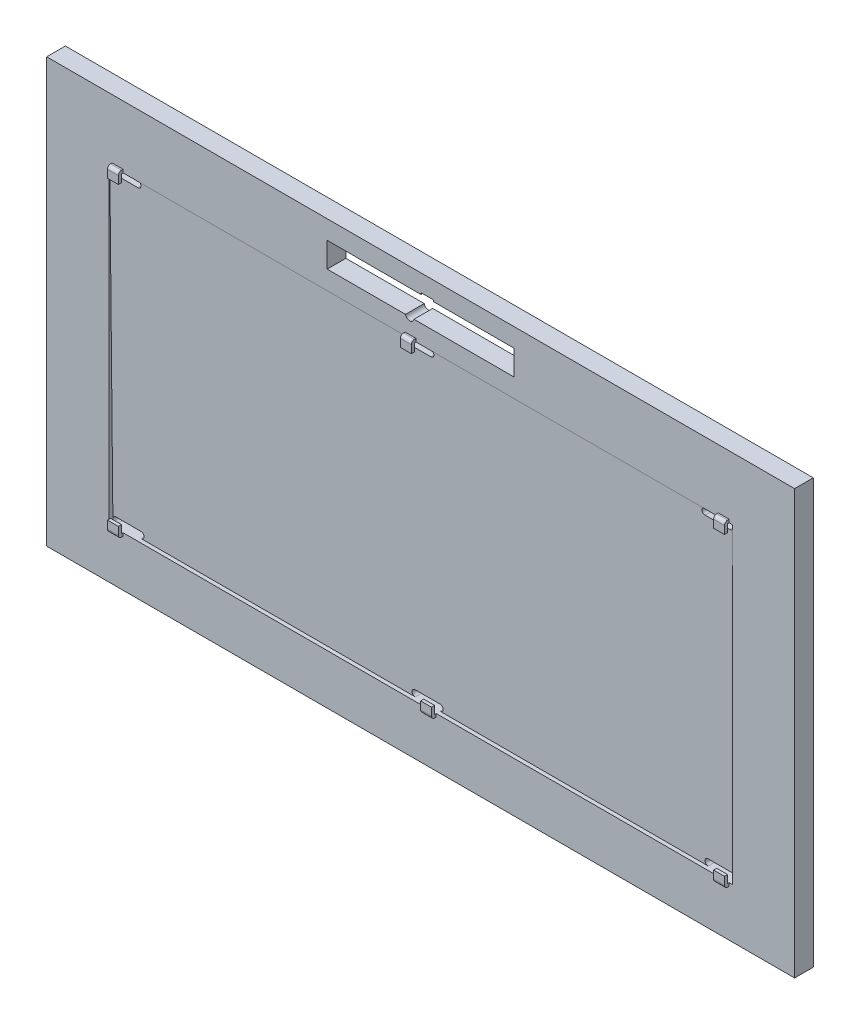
ISO-10303-21;
HEADER;
FILE_DESCRIPTION(('STEP AP214'),'2;1');
FILE_NAME('part.step','',(''),(''),'','','');
FILE_SCHEMA(('AUTOMOTIVE_DESIGN { 1 0 10303 214 1 1 1 1 }'));
ENDSEC;
DATA;
#1=APPLICATION_CONTEXT('core data for automotive mechanical design processes');
#2=APPLICATION_PROTOCOL_DEFINITION('international standard','automotive_design',2000,#1);
#3=PRODUCT_CONTEXT('',#1,'mechanical');
#4=PRODUCT('Part','Part','',(#3));
#5=PRODUCT_RELATED_PRODUCT_CATEGORY('part','',(#4));
#6=PRODUCT_DEFINITION_FORMATION('','',#4);
#7=PRODUCT_DEFINITION_CONTEXT('part definition',#1,'design');
#8=PRODUCT_DEFINITION('design','',#6,#7);
#9=PRODUCT_DEFINITION_SHAPE('','',#8);
#10=(LENGTH_UNIT() NAMED_UNIT(*) SI_UNIT(.MILLI.,.METRE.));
#11=(NAMED_UNIT(*) PLANE_ANGLE_UNIT() SI_UNIT($,.RADIAN.));
#12=(NAMED_UNIT(*) SI_UNIT($,.STERADIAN.) SOLID_ANGLE_UNIT());
#13=UNCERTAINTY_MEASURE_WITH_UNIT(LENGTH_MEASURE(1.E-05),#10,'distance_accuracy_value','');
#14=(GEOMETRIC_REPRESENTATION_CONTEXT(3) GLOBAL_UNCERTAINTY_ASSIGNED_CONTEXT((#13)) GLOBAL_UNIT_ASSIGNED_CONTEXT((#10,
#11,#12)) REPRESENTATION_CONTEXT('',''));
#15=CARTESIAN_POINT('',(0.,0.,0.));
#16=DIRECTION('',(0.,0.,1.));
#17=DIRECTION('',(1.,0.,0.));
#18=AXIS2_PLACEMENT_3D('',#15,#16,#17);
#19=CARTESIAN_POINT('',(-120.,-68.,3.));
#20=DIRECTION('',(0.,0.,1.));
#21=DIRECTION('',(1.,0.,0.));
#22=AXIS2_PLACEMENT_3D('',#19,#20,#21);
#23=PLANE('',#22);
#24=DIRECTION('',(0.,-1.,0.));
#25=VECTOR('',#24,1.);
#26=CARTESIAN_POINT('',(-120.,68.,3.));
#27=LINE('',#26,#25);
#28=CARTESIAN_POINT('',(-120.,68.,3.));
#29=VERTEX_POINT('',#28);
#30=CARTESIAN_POINT('',(-120.,-68.,3.));
#31=VERTEX_POINT('',#30);
#32=EDGE_CURVE('E1651',#29,#31,#27,.T.);
#33=ORIENTED_EDGE('',*,*,#32,.T.);
#34=DIRECTION('',(1.,0.,0.));
#35=VECTOR('',#34,1.);
#36=CARTESIAN_POINT('',(-120.,-68.,3.));
#37=LINE('',#36,#35);
#38=CARTESIAN_POINT('',(120.,-68.,3.));
#39=VERTEX_POINT('',#38);
#40=EDGE_CURVE('E1653',#31,#39,#37,.T.);
#41=ORIENTED_EDGE('',*,*,#40,.T.);
#42=DIRECTION('',(0.,1.,0.));
#43=VECTOR('',#42,1.);
#44=CARTESIAN_POINT('',(120.,68.,3.));
#45=LINE('',#44,#43);
#46=CARTESIAN_POINT('',(120.,68.,3.));
#47=VERTEX_POINT('',#46);
#48=EDGE_CURVE('E1655',#39,#47,#45,.T.);
#49=ORIENTED_EDGE('',*,*,#48,.T.);
#50=DIRECTION('',(-1.,0.,0.));
#51=VECTOR('',#50,1.);
#52=CARTESIAN_POINT('',(-120.,68.,3.));
#53=LINE('',#52,#51);
#54=EDGE_CURVE('E1657',#47,#29,#53,.T.);
#55=ORIENTED_EDGE('',*,*,#54,.T.);
#56=EDGE_LOOP('',(#33,#41,#49,#55));
#57=FACE_BOUND('',#56,.T.);
#58=DIRECTION('',(1.,0.,0.));
#59=VECTOR('',#58,1.);
#60=CARTESIAN_POINT('',(-100.,-52.,3.));
#61=LINE('',#60,#59);
#62=CARTESIAN_POINT('',(-100.,-52.,3.));
#63=VERTEX_POINT('',#62);
#64=CARTESIAN_POINT('',(-99.,-52.,3.));
#65=VERTEX_POINT('',#64);
#66=EDGE_CURVE('E1516',#63,#65,#61,.T.);
#67=ORIENTED_EDGE('',*,*,#66,.F.);
#68=DIRECTION('',(0.,-1.,0.));
#69=VECTOR('',#68,1.);
#70=CARTESIAN_POINT('',(-100.,48.,3.));
#71=LINE('',#70,#69);
#72=CARTESIAN_POINT('',(-100.,48.,3.));
#73=VERTEX_POINT('',#72);
#74=EDGE_CURVE('E1503',#73,#63,#71,.T.);
#75=ORIENTED_EDGE('',*,*,#74,.F.);
#76=DIRECTION('',(1.,0.,0.));
#77=VECTOR('',#76,1.);
#78=CARTESIAN_POINT('',(-100.,48.,3.));
#79=LINE('',#78,#77);
#80=CARTESIAN_POINT('',(-99.,48.,3.));
#81=VERTEX_POINT('',#80);
#82=EDGE_CURVE('E1521',#73,#81,#79,.T.);
#83=ORIENTED_EDGE('',*,*,#82,.T.);
#84=DIRECTION('',(0.,-1.,0.));
#85=VECTOR('',#84,1.);
#86=CARTESIAN_POINT('',(-99.,49.,3.));
#87=LINE('',#86,#85);
#88=CARTESIAN_POINT('',(-99.,49.,3.));
#89=VERTEX_POINT('',#88);
#90=EDGE_CURVE('E1066',#89,#81,#87,.T.);
#91=ORIENTED_EDGE('',*,*,#90,.F.);
#92=DIRECTION('',(-1.,0.,0.));
#93=VECTOR('',#92,1.);
#94=CARTESIAN_POINT('',(-99.,49.,3.));
#95=LINE('',#94,#93);
#96=CARTESIAN_POINT('',(-95.5,49.,3.));
#97=VERTEX_POINT('',#96);
#98=EDGE_CURVE('E1069',#97,#89,#95,.T.);
#99=ORIENTED_EDGE('',*,*,#98,.F.);
#100=DIRECTION('',(0.,1.,0.));
#101=VECTOR('',#100,1.);
#102=CARTESIAN_POINT('',(-95.5,49.,3.));
#103=LINE('',#102,#101);
#104=CARTESIAN_POINT('',(-95.5,48.,3.));
#105=VERTEX_POINT('',#104);
#106=EDGE_CURVE('E1070',#105,#97,#103,.T.);
#107=ORIENTED_EDGE('',*,*,#106,.F.);
#108=CARTESIAN_POINT('',(-5.,48.,3.));
#109=VERTEX_POINT('',#108);
#110=EDGE_CURVE('E1525',#105,#109,#79,.T.);
#111=ORIENTED_EDGE('',*,*,#110,.T.);
#112=DIRECTION('',(0.,-1.,0.));
#113=VECTOR('',#112,1.);
#114=CARTESIAN_POINT('',(-5.,49.,3.));
#115=LINE('',#114,#113);
#116=CARTESIAN_POINT('',(-5.,49.,3.));
#117=VERTEX_POINT('',#116);
#118=EDGE_CURVE('E965',#117,#109,#115,.T.);
#119=ORIENTED_EDGE('',*,*,#118,.F.);
#120=DIRECTION('',(-1.,0.,0.));
#121=VECTOR('',#120,1.);
#122=CARTESIAN_POINT('',(-5.,49.,3.));
#123=LINE('',#122,#121);
#124=CARTESIAN_POINT('',(-1.5,49.,3.));
#125=VERTEX_POINT('',#124);
#126=EDGE_CURVE('E971',#125,#117,#123,.T.);
#127=ORIENTED_EDGE('',*,*,#126,.F.);
#128=DIRECTION('',(0.,1.,0.));
#129=VECTOR('',#128,1.);
#130=CARTESIAN_POINT('',(-1.5,49.,3.));
#131=LINE('',#130,#129);
#132=CARTESIAN_POINT('',(-1.5,48.,3.));
#133=VERTEX_POINT('',#132);
#134=EDGE_CURVE('E968',#133,#125,#131,.T.);
#135=ORIENTED_EDGE('',*,*,#134,.F.);
#136=CARTESIAN_POINT('',(95.5,48.,3.));
#137=VERTEX_POINT('',#136);
#138=EDGE_CURVE('E1526',#133,#137,#79,.T.);
#139=ORIENTED_EDGE('',*,*,#138,.T.);
#140=DIRECTION('',(0.,-1.,0.));
#141=VECTOR('',#140,1.);
#142=CARTESIAN_POINT('',(95.5,49.,3.));
#143=LINE('',#142,#141);
#144=CARTESIAN_POINT('',(95.5,49.,3.));
#145=VERTEX_POINT('',#144);
#146=EDGE_CURVE('E1046',#145,#137,#143,.T.);
#147=ORIENTED_EDGE('',*,*,#146,.F.);
#148=DIRECTION('',(-1.,0.,0.));
#149=VECTOR('',#148,1.);
#150=CARTESIAN_POINT('',(99.,49.,3.));
#151=LINE('',#150,#149);
#152=CARTESIAN_POINT('',(99.,49.,3.));
#153=VERTEX_POINT('',#152);
#154=EDGE_CURVE('E1043',#153,#145,#151,.T.);
#155=ORIENTED_EDGE('',*,*,#154,.F.);
#156=DIRECTION('',(0.,1.,0.));
#157=VECTOR('',#156,1.);
#158=CARTESIAN_POINT('',(99.,49.,3.));
#159=LINE('',#158,#157);
#160=CARTESIAN_POINT('',(99.,48.,3.));
#161=VERTEX_POINT('',#160);
#162=EDGE_CURVE('E1040',#161,#153,#159,.T.);
#163=ORIENTED_EDGE('',*,*,#162,.F.);
#164=CARTESIAN_POINT('',(100.,48.,3.));
#165=VERTEX_POINT('',#164);
#166=EDGE_CURVE('E1530',#161,#165,#79,.T.);
#167=ORIENTED_EDGE('',*,*,#166,.T.);
#168=DIRECTION('',(0.,-1.,0.));
#169=VECTOR('',#168,1.);
#170=CARTESIAN_POINT('',(100.,48.,3.));
#171=LINE('',#170,#169);
#172=CARTESIAN_POINT('',(100.,-52.,3.));
#173=VERTEX_POINT('',#172);
#174=EDGE_CURVE('E1489',#165,#173,#171,.T.);
#175=ORIENTED_EDGE('',*,*,#174,.T.);
#176=CARTESIAN_POINT('',(99.,-52.,3.));
#177=VERTEX_POINT('',#176);
#178=EDGE_CURVE('E1524',#177,#173,#61,.T.);
#179=ORIENTED_EDGE('',*,*,#178,.F.);
#180=DIRECTION('',(0.,1.,0.));
#181=VECTOR('',#180,1.);
#182=CARTESIAN_POINT('',(99.,-53.,3.));
#183=LINE('',#182,#181);
#184=CARTESIAN_POINT('',(99.,-53.,3.));
#185=VERTEX_POINT('',#184);
#186=EDGE_CURVE('E878',#185,#177,#183,.T.);
#187=ORIENTED_EDGE('',*,*,#186,.F.);
#188=DIRECTION('',(1.,0.,0.));
#189=VECTOR('',#188,1.);
#190=CARTESIAN_POINT('',(99.,-53.,3.));
#191=LINE('',#190,#189);
#192=CARTESIAN_POINT('',(95.5,-53.,3.));
#193=VERTEX_POINT('',#192);
#194=EDGE_CURVE('E991',#193,#185,#191,.T.);
#195=ORIENTED_EDGE('',*,*,#194,.F.);
#196=DIRECTION('',(0.,-1.,0.));
#197=VECTOR('',#196,1.);
#198=CARTESIAN_POINT('',(95.5,-53.,3.));
#199=LINE('',#198,#197);
#200=CARTESIAN_POINT('',(95.5,-52.,3.));
#201=VERTEX_POINT('',#200);
#202=EDGE_CURVE('E995',#201,#193,#199,.T.);
#203=ORIENTED_EDGE('',*,*,#202,.F.);
#204=CARTESIAN_POINT('',(5.,-52.,3.));
#205=VERTEX_POINT('',#204);
#206=EDGE_CURVE('E1520',#205,#201,#61,.T.);
#207=ORIENTED_EDGE('',*,*,#206,.F.);
#208=DIRECTION('',(0.,1.,0.));
#209=VECTOR('',#208,1.);
#210=CARTESIAN_POINT('',(5.00000000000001,-49.5,3.));
#211=LINE('',#210,#209);
#212=CARTESIAN_POINT('',(5.00000000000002,-53.,3.));
#213=VERTEX_POINT('',#212);
#214=EDGE_CURVE('E945',#213,#205,#211,.T.);
#215=ORIENTED_EDGE('',*,*,#214,.F.);
#216=DIRECTION('',(1.,0.,0.));
#217=VECTOR('',#216,1.);
#218=CARTESIAN_POINT('',(1.50000000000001,-53.,3.));
#219=LINE('',#218,#217);
#220=CARTESIAN_POINT('',(1.50000000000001,-53.,3.));
#221=VERTEX_POINT('',#220);
#222=EDGE_CURVE('E942',#221,#213,#219,.T.);
#223=ORIENTED_EDGE('',*,*,#222,.F.);
#224=DIRECTION('',(0.,-1.,0.));
#225=VECTOR('',#224,1.);
#226=CARTESIAN_POINT('',(1.50000000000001,-49.5,3.));
#227=LINE('',#226,#225);
#228=CARTESIAN_POINT('',(1.50000000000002,-52.,3.));
#229=VERTEX_POINT('',#228);
#230=EDGE_CURVE('E939',#229,#221,#227,.T.);
#231=ORIENTED_EDGE('',*,*,#230,.F.);
#232=CARTESIAN_POINT('',(-95.5,-52.,3.));
#233=VERTEX_POINT('',#232);
#234=EDGE_CURVE('E1519',#233,#229,#61,.T.);
#235=ORIENTED_EDGE('',*,*,#234,.F.);
#236=DIRECTION('',(0.,1.,0.));
#237=VECTOR('',#236,1.);
#238=CARTESIAN_POINT('',(-95.5,-53.,3.));
#239=LINE('',#238,#237);
#240=CARTESIAN_POINT('',(-95.5,-53.,3.));
#241=VERTEX_POINT('',#240);
#242=EDGE_CURVE('E1017',#241,#233,#239,.T.);
#243=ORIENTED_EDGE('',*,*,#242,.F.);
#244=DIRECTION('',(1.,0.,0.));
#245=VECTOR('',#244,1.);
#246=CARTESIAN_POINT('',(-99.,-53.,3.));
#247=LINE('',#246,#245);
#248=CARTESIAN_POINT('',(-99.,-53.,3.));
#249=VERTEX_POINT('',#248);
#250=EDGE_CURVE('E1014',#249,#241,#247,.T.);
#251=ORIENTED_EDGE('',*,*,#250,.F.);
#252=DIRECTION('',(0.,-1.,0.));
#253=VECTOR('',#252,1.);
#254=CARTESIAN_POINT('',(-99.,-53.,3.));
#255=LINE('',#254,#253);
#256=EDGE_CURVE('E1020',#65,#249,#255,.T.);
#257=ORIENTED_EDGE('',*,*,#256,.F.);
#258=EDGE_LOOP('',(#67,#75,#83,#91,#99,#107,#111,#119,#127,#135,#139,#147,#155,#163,#167,#175,
#179,#187,#195,#203,#207,#215,#223,#231,#235,#243,#251,#257));
#259=FACE_BOUND('',#258,.T.);
#260=CARTESIAN_POINT('',(-3.50000000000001,54.25,3.));
#261=DIRECTION('',(0.,0.,1.));
#262=DIRECTION('',(1.,0.,0.));
#263=AXIS2_PLACEMENT_3D('',#260,#261,#262);
#264=CIRCLE('',#263,1.375);
#265=CARTESIAN_POINT('',(-4.852081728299,54.,3.));
#266=VERTEX_POINT('',#265);
#267=CARTESIAN_POINT('',(-2.14791827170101,54.,3.));
#268=VERTEX_POINT('',#267);
#269=EDGE_CURVE('E1561',#266,#268,#264,.T.);
#270=ORIENTED_EDGE('',*,*,#269,.F.);
#271=DIRECTION('',(1.,0.,0.));
#272=VECTOR('',#271,1.);
#273=CARTESIAN_POINT('',(-30.,54.,3.));
#274=LINE('',#273,#272);
#275=CARTESIAN_POINT('',(-30.,54.,3.));
#276=VERTEX_POINT('',#275);
#277=EDGE_CURVE('E1608',#276,#266,#274,.T.);
#278=ORIENTED_EDGE('',*,*,#277,.F.);
#279=DIRECTION('',(0.,-1.,0.));
#280=VECTOR('',#279,1.);
#281=CARTESIAN_POINT('',(-30.,62.,3.));
#282=LINE('',#281,#280);
#283=CARTESIAN_POINT('',(-30.,62.,3.));
#284=VERTEX_POINT('',#283);
#285=EDGE_CURVE('E1603',#284,#276,#282,.T.);
#286=ORIENTED_EDGE('',*,*,#285,.F.);
#287=DIRECTION('',(-1.,0.,0.));
#288=VECTOR('',#287,1.);
#289=CARTESIAN_POINT('',(-30.,62.,3.));
#290=LINE('',#289,#288);
#291=CARTESIAN_POINT('',(0.099999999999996,62.,3.));
#292=VERTEX_POINT('',#291);
#293=EDGE_CURVE('E1614',#292,#284,#290,.T.);
#294=ORIENTED_EDGE('',*,*,#293,.F.);
#295=DIRECTION('',(0.,-1.,0.));
#296=VECTOR('',#295,1.);
#297=CARTESIAN_POINT('',(0.0999999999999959,62.5,3.));
#298=LINE('',#297,#296);
#299=CARTESIAN_POINT('',(0.0999999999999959,62.5,3.));
#300=VERTEX_POINT('',#299);
#301=EDGE_CURVE('E1586',#300,#292,#298,.T.);
#302=ORIENTED_EDGE('',*,*,#301,.F.);
#303=DIRECTION('',(-1.,0.,0.));
#304=VECTOR('',#303,1.);
#305=CARTESIAN_POINT('',(0.0999999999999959,62.5,3.));
#306=LINE('',#305,#304);
#307=CARTESIAN_POINT('',(4.2,62.5,3.));
#308=VERTEX_POINT('',#307);
#309=EDGE_CURVE('E1590',#308,#300,#306,.T.);
#310=ORIENTED_EDGE('',*,*,#309,.F.);
#311=DIRECTION('',(0.,1.,0.));
#312=VECTOR('',#311,1.);
#313=CARTESIAN_POINT('',(4.2,62.5,3.));
#314=LINE('',#313,#312);
#315=CARTESIAN_POINT('',(4.2,62.,3.));
#316=VERTEX_POINT('',#315);
#317=EDGE_CURVE('E1588',#316,#308,#314,.T.);
#318=ORIENTED_EDGE('',*,*,#317,.F.);
#319=CARTESIAN_POINT('',(30.,62.,3.));
#320=VERTEX_POINT('',#319);
#321=EDGE_CURVE('E1615',#320,#316,#290,.T.);
#322=ORIENTED_EDGE('',*,*,#321,.F.);
#323=DIRECTION('',(0.,1.,0.));
#324=VECTOR('',#323,1.);
#325=CARTESIAN_POINT('',(30.,62.,3.));
#326=LINE('',#325,#324);
#327=CARTESIAN_POINT('',(30.,54.,3.));
#328=VERTEX_POINT('',#327);
#329=EDGE_CURVE('E1611',#328,#320,#326,.T.);
#330=ORIENTED_EDGE('',*,*,#329,.F.);
#331=EDGE_CURVE('E1607',#268,#328,#274,.T.);
#332=ORIENTED_EDGE('',*,*,#331,.F.);
#333=EDGE_LOOP('',(#270,#278,#286,#294,#302,#310,#318,#322,#330,#332));
#334=FACE_BOUND('',#333,.T.);
#335=ADVANCED_FACE('F32',(#57,#259,#334),#23,.T.);
#336=CARTESIAN_POINT('',(-120.,-68.,-3.));
#337=DIRECTION('',(0.,0.,1.));
#338=DIRECTION('',(1.,0.,0.));
#339=AXIS2_PLACEMENT_3D('',#336,#337,#338);
#340=PLANE('',#339);
#341=DIRECTION('',(0.,1.,0.));
#342=VECTOR('',#341,1.);
#343=CARTESIAN_POINT('',(100.,-52.,-3.));
#344=LINE('',#343,#342);
#345=CARTESIAN_POINT('',(100.,-52.,-3.));
#346=VERTEX_POINT('',#345);
#347=CARTESIAN_POINT('',(100.,48.,-3.));
#348=VERTEX_POINT('',#347);
#349=EDGE_CURVE('E1512',#346,#348,#344,.T.);
#350=ORIENTED_EDGE('',*,*,#349,.T.);
#351=DIRECTION('',(1.,0.,0.));
#352=VECTOR('',#351,1.);
#353=CARTESIAN_POINT('',(-100.,48.,-3.));
#354=LINE('',#353,#352);
#355=CARTESIAN_POINT('',(94.5,48.,-3.));
#356=VERTEX_POINT('',#355);
#357=EDGE_CURVE('E1557',#356,#348,#354,.T.);
#358=ORIENTED_EDGE('',*,*,#357,.F.);
#359=DIRECTION('',(0.,-1.,0.));
#360=VECTOR('',#359,1.);
#361=CARTESIAN_POINT('',(94.5,49.,-3.));
#362=LINE('',#361,#360);
#363=CARTESIAN_POINT('',(94.5,49.,-3.));
#364=VERTEX_POINT('',#363);
#365=EDGE_CURVE('E1296',#364,#356,#362,.T.);
#366=ORIENTED_EDGE('',*,*,#365,.F.);
#367=DIRECTION('',(1.,0.,0.));
#368=VECTOR('',#367,1.);
#369=CARTESIAN_POINT('',(94.5,49.,-3.));
#370=LINE('',#369,#368);
#371=CARTESIAN_POINT('',(91.,49.,-3.));
#372=VERTEX_POINT('',#371);
#373=EDGE_CURVE('E1299',#372,#364,#370,.T.);
#374=ORIENTED_EDGE('',*,*,#373,.F.);
#375=DIRECTION('',(0.,1.,0.));
#376=VECTOR('',#375,1.);
#377=CARTESIAN_POINT('',(91.,49.,-3.));
#378=LINE('',#377,#376);
#379=CARTESIAN_POINT('',(91.,48.,-3.));
#380=VERTEX_POINT('',#379);
#381=EDGE_CURVE('E1300',#380,#372,#378,.T.);
#382=ORIENTED_EDGE('',*,*,#381,.F.);
#383=CARTESIAN_POINT('',(3.,48.,-3.));
#384=VERTEX_POINT('',#383);
#385=EDGE_CURVE('E1581',#384,#380,#354,.T.);
#386=ORIENTED_EDGE('',*,*,#385,.F.);
#387=DIRECTION('',(0.,-1.,0.));
#388=VECTOR('',#387,1.);
#389=CARTESIAN_POINT('',(3.,49.,-3.));
#390=LINE('',#389,#388);
#391=CARTESIAN_POINT('',(3.,49.,-3.));
#392=VERTEX_POINT('',#391);
#393=EDGE_CURVE('E1192',#392,#384,#390,.T.);
#394=ORIENTED_EDGE('',*,*,#393,.F.);
#395=DIRECTION('',(1.,0.,0.));
#396=VECTOR('',#395,1.);
#397=CARTESIAN_POINT('',(3.,49.,-3.));
#398=LINE('',#397,#396);
#399=CARTESIAN_POINT('',(-0.499999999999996,49.,-3.));
#400=VERTEX_POINT('',#399);
#401=EDGE_CURVE('E1198',#400,#392,#398,.T.);
#402=ORIENTED_EDGE('',*,*,#401,.F.);
#403=DIRECTION('',(0.,1.,0.));
#404=VECTOR('',#403,1.);
#405=CARTESIAN_POINT('',(-0.499999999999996,49.,-3.));
#406=LINE('',#405,#404);
#407=CARTESIAN_POINT('',(-0.499999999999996,48.,-3.));
#408=VERTEX_POINT('',#407);
#409=EDGE_CURVE('E1195',#408,#400,#406,.T.);
#410=ORIENTED_EDGE('',*,*,#409,.F.);
#411=CARTESIAN_POINT('',(-91.,48.,-3.));
#412=VERTEX_POINT('',#411);
#413=EDGE_CURVE('E1580',#412,#408,#354,.T.);
#414=ORIENTED_EDGE('',*,*,#413,.F.);
#415=DIRECTION('',(0.,-1.,0.));
#416=VECTOR('',#415,1.);
#417=CARTESIAN_POINT('',(-91.,49.,-3.));
#418=LINE('',#417,#416);
#419=CARTESIAN_POINT('',(-91.,49.,-3.));
#420=VERTEX_POINT('',#419);
#421=EDGE_CURVE('E1273',#420,#412,#418,.T.);
#422=ORIENTED_EDGE('',*,*,#421,.F.);
#423=DIRECTION('',(1.,0.,0.));
#424=VECTOR('',#423,1.);
#425=CARTESIAN_POINT('',(-94.5,49.,-3.));
#426=LINE('',#425,#424);
#427=CARTESIAN_POINT('',(-94.5,49.,-3.));
#428=VERTEX_POINT('',#427);
#429=EDGE_CURVE('E1270',#428,#420,#426,.T.);
#430=ORIENTED_EDGE('',*,*,#429,.F.);
#431=DIRECTION('',(0.,1.,0.));
#432=VECTOR('',#431,1.);
#433=CARTESIAN_POINT('',(-94.5,49.,-3.));
#434=LINE('',#433,#432);
#435=CARTESIAN_POINT('',(-94.5,48.,-3.));
#436=VERTEX_POINT('',#435);
#437=EDGE_CURVE('E1276',#436,#428,#434,.T.);
#438=ORIENTED_EDGE('',*,*,#437,.F.);
#439=CARTESIAN_POINT('',(-100.,48.,-3.));
#440=VERTEX_POINT('',#439);
#441=EDGE_CURVE('E1577',#440,#436,#354,.T.);
#442=ORIENTED_EDGE('',*,*,#441,.F.);
#443=DIRECTION('',(0.,1.,0.));
#444=VECTOR('',#443,1.);
#445=CARTESIAN_POINT('',(-100.,-52.,-3.));
#446=LINE('',#445,#444);
#447=CARTESIAN_POINT('',(-100.,-52.,-3.));
#448=VERTEX_POINT('',#447);
#449=EDGE_CURVE('E1544',#448,#440,#446,.T.);
#450=ORIENTED_EDGE('',*,*,#449,.F.);
#451=DIRECTION('',(1.,0.,0.));
#452=VECTOR('',#451,1.);
#453=CARTESIAN_POINT('',(-100.,-52.,-3.));
#454=LINE('',#453,#452);
#455=CARTESIAN_POINT('',(-94.5,-52.,-3.));
#456=VERTEX_POINT('',#455);
#457=EDGE_CURVE('E1558',#448,#456,#454,.T.);
#458=ORIENTED_EDGE('',*,*,#457,.T.);
#459=DIRECTION('',(0.,1.,0.));
#460=VECTOR('',#459,1.);
#461=CARTESIAN_POINT('',(-94.5,-53.,-3.));
#462=LINE('',#461,#460);
#463=CARTESIAN_POINT('',(-94.5,-53.,-3.));
#464=VERTEX_POINT('',#463);
#465=EDGE_CURVE('E1247',#464,#456,#462,.T.);
#466=ORIENTED_EDGE('',*,*,#465,.F.);
#467=DIRECTION('',(-1.,0.,0.));
#468=VECTOR('',#467,1.);
#469=CARTESIAN_POINT('',(-94.5,-53.,-3.));
#470=LINE('',#469,#468);
#471=CARTESIAN_POINT('',(-91.,-53.,-3.));
#472=VERTEX_POINT('',#471);
#473=EDGE_CURVE('E1244',#472,#464,#470,.T.);
#474=ORIENTED_EDGE('',*,*,#473,.F.);
#475=DIRECTION('',(0.,-1.,0.));
#476=VECTOR('',#475,1.);
#477=CARTESIAN_POINT('',(-91.,-53.,-3.));
#478=LINE('',#477,#476);
#479=CARTESIAN_POINT('',(-91.,-52.,-3.));
#480=VERTEX_POINT('',#479);
#481=EDGE_CURVE('E1250',#480,#472,#478,.T.);
#482=ORIENTED_EDGE('',*,*,#481,.F.);
#483=CARTESIAN_POINT('',(-2.99999999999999,-52.,-3.));
#484=VERTEX_POINT('',#483);
#485=EDGE_CURVE('E1562',#480,#484,#454,.T.);
#486=ORIENTED_EDGE('',*,*,#485,.T.);
#487=DIRECTION('',(0.,1.,0.));
#488=VECTOR('',#487,1.);
#489=CARTESIAN_POINT('',(-2.99999999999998,-49.5,-3.));
#490=LINE('',#489,#488);
#491=CARTESIAN_POINT('',(-2.99999999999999,-53.,-3.));
#492=VERTEX_POINT('',#491);
#493=EDGE_CURVE('E1166',#492,#484,#490,.T.);
#494=ORIENTED_EDGE('',*,*,#493,.F.);
#495=DIRECTION('',(-1.,0.,0.));
#496=VECTOR('',#495,1.);
#497=CARTESIAN_POINT('',(-2.99999999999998,-53.,-3.));
#498=LINE('',#497,#496);
#499=CARTESIAN_POINT('',(0.500000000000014,-53.,-3.));
#500=VERTEX_POINT('',#499);
#501=EDGE_CURVE('E1172',#500,#492,#498,.T.);
#502=ORIENTED_EDGE('',*,*,#501,.F.);
#503=DIRECTION('',(0.,-1.,0.));
#504=VECTOR('',#503,1.);
#505=CARTESIAN_POINT('',(0.500000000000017,-49.5,-3.));
#506=LINE('',#505,#504);
#507=CARTESIAN_POINT('',(0.500000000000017,-52.,-3.));
#508=VERTEX_POINT('',#507);
#509=EDGE_CURVE('E1169',#508,#500,#506,.T.);
#510=ORIENTED_EDGE('',*,*,#509,.F.);
#511=CARTESIAN_POINT('',(91.,-52.,-3.));
#512=VERTEX_POINT('',#511);
#513=EDGE_CURVE('E1563',#508,#512,#454,.T.);
#514=ORIENTED_EDGE('',*,*,#513,.T.);
#515=DIRECTION('',(0.,1.,0.));
#516=VECTOR('',#515,1.);
#517=CARTESIAN_POINT('',(91.,-53.,-3.));
#518=LINE('',#517,#516);
#519=CARTESIAN_POINT('',(91.,-53.,-3.));
#520=VERTEX_POINT('',#519);
#521=EDGE_CURVE('E1221',#520,#512,#518,.T.);
#522=ORIENTED_EDGE('',*,*,#521,.F.);
#523=DIRECTION('',(-1.,0.,0.));
#524=VECTOR('',#523,1.);
#525=CARTESIAN_POINT('',(94.5,-53.,-3.));
#526=LINE('',#525,#524);
#527=CARTESIAN_POINT('',(94.5,-53.,-3.));
#528=VERTEX_POINT('',#527);
#529=EDGE_CURVE('E1218',#528,#520,#526,.T.);
#530=ORIENTED_EDGE('',*,*,#529,.F.);
#531=DIRECTION('',(0.,-1.,0.));
#532=VECTOR('',#531,1.);
#533=CARTESIAN_POINT('',(94.5,-53.,-3.));
#534=LINE('',#533,#532);
#535=CARTESIAN_POINT('',(94.5,-52.,-3.));
#536=VERTEX_POINT('',#535);
#537=EDGE_CURVE('E1224',#536,#528,#534,.T.);
#538=ORIENTED_EDGE('',*,*,#537,.F.);
#539=EDGE_CURVE('E1567',#536,#346,#454,.T.);
#540=ORIENTED_EDGE('',*,*,#539,.T.);
#541=EDGE_LOOP('',(#350,#358,#366,#374,#382,#386,#394,#402,#410,#414,#422,#430,#438,#442,#450,
#458,#466,#474,#482,#486,#494,#502,#510,#514,#522,#530,#538,#540));
#542=FACE_BOUND('',#541,.T.);
#543=DIRECTION('',(-1.,0.,0.));
#544=VECTOR('',#543,1.);
#545=CARTESIAN_POINT('',(-120.,68.,-3.));
#546=LINE('',#545,#544);
#547=CARTESIAN_POINT('',(120.,68.,-3.));
#548=VERTEX_POINT('',#547);
#549=CARTESIAN_POINT('',(-120.,68.,-3.));
#550=VERTEX_POINT('',#549);
#551=EDGE_CURVE('E1649',#548,#550,#546,.T.);
#552=ORIENTED_EDGE('',*,*,#551,.F.);
#553=DIRECTION('',(0.,1.,0.));
#554=VECTOR('',#553,1.);
#555=CARTESIAN_POINT('',(120.,68.,-3.));
#556=LINE('',#555,#554);
#557=CARTESIAN_POINT('',(120.,-68.,-3.));
#558=VERTEX_POINT('',#557);
#559=EDGE_CURVE('E1647',#558,#548,#556,.T.);
#560=ORIENTED_EDGE('',*,*,#559,.F.);
#561=DIRECTION('',(1.,0.,0.));
#562=VECTOR('',#561,1.);
#563=CARTESIAN_POINT('',(-120.,-68.,-3.));
#564=LINE('',#563,#562);
#565=CARTESIAN_POINT('',(-120.,-68.,-3.));
#566=VERTEX_POINT('',#565);
#567=EDGE_CURVE('E1645',#566,#558,#564,.T.);
#568=ORIENTED_EDGE('',*,*,#567,.F.);
#569=DIRECTION('',(0.,-1.,0.));
#570=VECTOR('',#569,1.);
#571=CARTESIAN_POINT('',(-120.,68.,-3.));
#572=LINE('',#571,#570);
#573=EDGE_CURVE('E1635',#550,#566,#572,.T.);
#574=ORIENTED_EDGE('',*,*,#573,.F.);
#575=EDGE_LOOP('',(#552,#560,#568,#574));
#576=FACE_BOUND('',#575,.T.);
#577=DIRECTION('',(1.,0.,0.));
#578=VECTOR('',#577,1.);
#579=CARTESIAN_POINT('',(-30.,54.,-3.));
#580=LINE('',#579,#578);
#581=CARTESIAN_POINT('',(-30.,54.,-3.));
#582=VERTEX_POINT('',#581);
#583=CARTESIAN_POINT('',(-4.85208172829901,54.,-3.));
#584=VERTEX_POINT('',#583);
#585=EDGE_CURVE('E1622',#582,#584,#580,.T.);
#586=ORIENTED_EDGE('',*,*,#585,.T.);
#587=CARTESIAN_POINT('',(-3.50000000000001,54.25,-3.));
#588=DIRECTION('',(0.,0.,1.));
#589=DIRECTION('',(1.,0.,0.));
#590=AXIS2_PLACEMENT_3D('',#587,#588,#589);
#591=CIRCLE('',#590,1.375);
#592=CARTESIAN_POINT('',(-2.14791827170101,54.,-3.));
#593=VERTEX_POINT('',#592);
#594=EDGE_CURVE('E1583',#584,#593,#591,.T.);
#595=ORIENTED_EDGE('',*,*,#594,.T.);
#596=CARTESIAN_POINT('',(30.,54.,-3.));
#597=VERTEX_POINT('',#596);
#598=EDGE_CURVE('E1621',#593,#597,#580,.T.);
#599=ORIENTED_EDGE('',*,*,#598,.T.);
#600=DIRECTION('',(0.,1.,0.));
#601=VECTOR('',#600,1.);
#602=CARTESIAN_POINT('',(30.,62.,-3.));
#603=LINE('',#602,#601);
#604=CARTESIAN_POINT('',(30.,62.,-3.));
#605=VERTEX_POINT('',#604);
#606=EDGE_CURVE('E1625',#597,#605,#603,.T.);
#607=ORIENTED_EDGE('',*,*,#606,.T.);
#608=DIRECTION('',(-1.,0.,0.));
#609=VECTOR('',#608,1.);
#610=CARTESIAN_POINT('',(-30.,62.,-3.));
#611=LINE('',#610,#609);
#612=CARTESIAN_POINT('',(-30.,62.,-3.));
#613=VERTEX_POINT('',#612);
#614=EDGE_CURVE('E1628',#605,#613,#611,.T.);
#615=ORIENTED_EDGE('',*,*,#614,.T.);
#616=DIRECTION('',(0.,-1.,0.));
#617=VECTOR('',#616,1.);
#618=CARTESIAN_POINT('',(-30.,62.,-3.));
#619=LINE('',#618,#617);
#620=EDGE_CURVE('E1618',#613,#582,#619,.T.);
#621=ORIENTED_EDGE('',*,*,#620,.T.);
#622=EDGE_LOOP('',(#586,#595,#599,#607,#615,#621));
#623=FACE_BOUND('',#622,.T.);
#624=ADVANCED_FACE('F1934',(#542,#576,#623),#340,.F.);
#625=CARTESIAN_POINT('',(-100.,48.,-2.75));
#626=DIRECTION('',(0.,0.00999950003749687,0.999950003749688));
#627=DIRECTION('',(0.,-0.999950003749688,0.00999950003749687));
#628=AXIS2_PLACEMENT_3D('',#625,#626,#627);
#629=PLANE('',#628);
#630=DIRECTION('',(0.,-0.999950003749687,0.00999950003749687));
#631=VECTOR('',#630,1.);
#632=CARTESIAN_POINT('',(-100.,48.,-2.75));
#633=LINE('',#632,#631);
#634=CARTESIAN_POINT('',(-100.,-51.,-1.76));
#635=VERTEX_POINT('',#634);
#636=CARTESIAN_POINT('',(-100.,-52.,-1.75));
#637=VERTEX_POINT('',#636);
#638=EDGE_CURVE('E1549',#635,#637,#633,.T.);
#639=ORIENTED_EDGE('',*,*,#638,.F.);
#640=CARTESIAN_POINT('',(-99.,-51.,-1.76));
#641=DIRECTION('',(0.,0.00999950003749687,0.999950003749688));
#642=DIRECTION('',(0.,-0.999950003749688,0.00999950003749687));
#643=AXIS2_PLACEMENT_3D('',#640,#641,#642);
#644=ELLIPSE('',#643,1.00004999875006,1.);
#645=CARTESIAN_POINT('',(-99.,-52.,-1.75));
#646=VERTEX_POINT('',#645);
#647=EDGE_CURVE('E1387',#635,#646,#644,.T.);
#648=ORIENTED_EDGE('',*,*,#647,.T.);
#649=DIRECTION('',(1.,0.,0.));
#650=VECTOR('',#649,1.);
#651=CARTESIAN_POINT('',(-100.,-52.,-1.75));
#652=LINE('',#651,#650);
#653=EDGE_CURVE('E1564',#637,#646,#652,.T.);
#654=ORIENTED_EDGE('',*,*,#653,.F.);
#655=EDGE_LOOP('',(#639,#648,#654));
#656=FACE_BOUND('',#655,.T.);
#657=ADVANCED_FACE('F2015',(#656),#629,.F.);
#658=CARTESIAN_POINT('',(-100.,-52.,1.75));
#659=DIRECTION('',(0.,0.00999950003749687,-0.999950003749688));
#660=DIRECTION('',(0.,0.999950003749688,0.00999950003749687));
#661=AXIS2_PLACEMENT_3D('',#658,#659,#660);
#662=PLANE('',#661);
#663=DIRECTION('',(1.,0.,0.));
#664=VECTOR('',#663,1.);
#665=CARTESIAN_POINT('',(-100.,-52.,1.75));
#666=LINE('',#665,#664);
#667=CARTESIAN_POINT('',(-100.,-52.,1.75));
#668=VERTEX_POINT('',#667);
#669=CARTESIAN_POINT('',(-99.,-52.,1.75));
#670=VERTEX_POINT('',#669);
#671=EDGE_CURVE('E1509',#668,#670,#666,.T.);
#672=ORIENTED_EDGE('',*,*,#671,.T.);
#673=CARTESIAN_POINT('',(-99.,-51.,1.76));
#674=DIRECTION('',(0.,0.00999950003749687,-0.999950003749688));
#675=DIRECTION('',(0.,0.999950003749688,0.00999950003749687));
#676=AXIS2_PLACEMENT_3D('',#673,#674,#675);
#677=ELLIPSE('',#676,1.00004999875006,1.);
#678=CARTESIAN_POINT('',(-100.,-51.,1.76));
#679=VERTEX_POINT('',#678);
#680=EDGE_CURVE('E1388',#670,#679,#677,.T.);
#681=ORIENTED_EDGE('',*,*,#680,.T.);
#682=DIRECTION('',(0.,0.999950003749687,0.00999950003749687));
#683=VECTOR('',#682,1.);
#684=CARTESIAN_POINT('',(-100.,-52.,1.75));
#685=LINE('',#684,#683);
#686=EDGE_CURVE('E1496',#668,#679,#685,.T.);
#687=ORIENTED_EDGE('',*,*,#686,.F.);
#688=EDGE_LOOP('',(#672,#681,#687));
#689=FACE_BOUND('',#688,.T.);
#690=ADVANCED_FACE('F2600',(#689),#662,.F.);
#691=CARTESIAN_POINT('',(5.00000000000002,-52.,-1.75));
#692=VERTEX_POINT('',#691);
#693=CARTESIAN_POINT('',(91.,-52.,-1.75));
#694=VERTEX_POINT('',#693);
#695=EDGE_CURVE('E1569',#692,#694,#652,.T.);
#696=ORIENTED_EDGE('',*,*,#695,.F.);
#697=CARTESIAN_POINT('',(5.00000000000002,-51.,-1.76));
#698=DIRECTION('',(0.,0.00999950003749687,0.999950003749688));
#699=DIRECTION('',(0.,-0.999950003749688,0.00999950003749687));
#700=AXIS2_PLACEMENT_3D('',#697,#698,#699);
#701=ELLIPSE('',#700,1.00004999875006,1.);
#702=CARTESIAN_POINT('',(5.00000000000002,-50.,-1.77));
#703=VERTEX_POINT('',#702);
#704=EDGE_CURVE('E1343',#692,#703,#701,.T.);
#705=ORIENTED_EDGE('',*,*,#704,.T.);
#706=DIRECTION('',(-1.,0.,0.));
#707=VECTOR('',#706,1.);
#708=CARTESIAN_POINT('',(-100.,-50.,-1.77));
#709=LINE('',#708,#707);
#710=CARTESIAN_POINT('',(-2.99999999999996,-50.,-1.77));
#711=VERTEX_POINT('',#710);
#712=EDGE_CURVE('E1346',#703,#711,#709,.T.);
#713=ORIENTED_EDGE('',*,*,#712,.T.);
#714=CARTESIAN_POINT('',(-2.99999999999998,-51.,-1.76));
#715=DIRECTION('',(0.,0.00999950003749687,0.999950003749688));
#716=DIRECTION('',(0.,-0.999950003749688,0.00999950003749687));
#717=AXIS2_PLACEMENT_3D('',#714,#715,#716);
#718=ELLIPSE('',#717,1.00004999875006,1.);
#719=CARTESIAN_POINT('',(-2.99999999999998,-52.,-1.75));
#720=VERTEX_POINT('',#719);
#721=EDGE_CURVE('E1337',#711,#720,#718,.T.);
#722=ORIENTED_EDGE('',*,*,#721,.T.);
#723=CARTESIAN_POINT('',(-91.,-52.,-1.75));
#724=VERTEX_POINT('',#723);
#725=EDGE_CURVE('E1568',#724,#720,#652,.T.);
#726=ORIENTED_EDGE('',*,*,#725,.F.);
#727=CARTESIAN_POINT('',(-91.,-51.,-1.76));
#728=DIRECTION('',(0.,0.00999950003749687,0.999950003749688));
#729=DIRECTION('',(0.,-0.999950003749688,0.00999950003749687));
#730=AXIS2_PLACEMENT_3D('',#727,#728,#729);
#731=ELLIPSE('',#730,1.00004999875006,1.);
#732=CARTESIAN_POINT('',(-91.,-50.,-1.77));
#733=VERTEX_POINT('',#732);
#734=EDGE_CURVE('E1395',#724,#733,#731,.T.);
#735=ORIENTED_EDGE('',*,*,#734,.T.);
#736=DIRECTION('',(-1.,0.,0.));
#737=VECTOR('',#736,1.);
#738=CARTESIAN_POINT('',(-100.,-50.,-1.77));
#739=LINE('',#738,#737);
#740=CARTESIAN_POINT('',(-99.,-50.,-1.77));
#741=VERTEX_POINT('',#740);
#742=EDGE_CURVE('E1398',#733,#741,#739,.T.);
#743=ORIENTED_EDGE('',*,*,#742,.T.);
#744=EDGE_CURVE('E1391',#741,#635,#644,.T.);
#745=ORIENTED_EDGE('',*,*,#744,.T.);
#746=CARTESIAN_POINT('',(-100.,47.,-2.74));
#747=VERTEX_POINT('',#746);
#748=EDGE_CURVE('E1554',#747,#635,#633,.T.);
#749=ORIENTED_EDGE('',*,*,#748,.F.);
#750=CARTESIAN_POINT('',(-99.,47.,-2.74));
#751=DIRECTION('',(0.,0.00999950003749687,0.999950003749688));
#752=DIRECTION('',(0.,-0.999950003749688,0.00999950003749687));
#753=AXIS2_PLACEMENT_3D('',#750,#751,#752);
#754=ELLIPSE('',#753,1.00004999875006,1.);
#755=CARTESIAN_POINT('',(-99.,46.,-2.73));
#756=VERTEX_POINT('',#755);
#757=EDGE_CURVE('E1443',#747,#756,#754,.T.);
#758=ORIENTED_EDGE('',*,*,#757,.T.);
#759=DIRECTION('',(1.,0.,0.));
#760=VECTOR('',#759,1.);
#761=CARTESIAN_POINT('',(-100.,46.,-2.73));
#762=LINE('',#761,#760);
#763=CARTESIAN_POINT('',(-91.,46.,-2.73));
#764=VERTEX_POINT('',#763);
#765=EDGE_CURVE('E1447',#756,#764,#762,.T.);
#766=ORIENTED_EDGE('',*,*,#765,.T.);
#767=CARTESIAN_POINT('',(-91.,47.,-2.74));
#768=DIRECTION('',(0.,0.00999950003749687,0.999950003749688));
#769=DIRECTION('',(0.,-0.999950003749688,0.00999950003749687));
#770=AXIS2_PLACEMENT_3D('',#767,#768,#769);
#771=ELLIPSE('',#770,1.00004999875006,1.);
#772=CARTESIAN_POINT('',(-91.,48.,-2.75));
#773=VERTEX_POINT('',#772);
#774=EDGE_CURVE('E1450',#764,#773,#771,.T.);
#775=ORIENTED_EDGE('',*,*,#774,.T.);
#776=DIRECTION('',(1.,0.,0.));
#777=VECTOR('',#776,1.);
#778=CARTESIAN_POINT('',(-100.,48.,-2.75));
#779=LINE('',#778,#777);
#780=CARTESIAN_POINT('',(-5.,48.,-2.75));
#781=VERTEX_POINT('',#780);
#782=EDGE_CURVE('E1574',#773,#781,#779,.T.);
#783=ORIENTED_EDGE('',*,*,#782,.T.);
#784=CARTESIAN_POINT('',(-5.,47.,-2.74));
#785=DIRECTION('',(0.,0.00999950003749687,0.999950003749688));
#786=DIRECTION('',(0.,-0.999950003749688,0.00999950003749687));
#787=AXIS2_PLACEMENT_3D('',#784,#785,#786);
#788=ELLIPSE('',#787,1.00004999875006,1.);
#789=CARTESIAN_POINT('',(-5.,46.,-2.73));
#790=VERTEX_POINT('',#789);
#791=EDGE_CURVE('E1362',#781,#790,#788,.T.);
#792=ORIENTED_EDGE('',*,*,#791,.T.);
#793=DIRECTION('',(1.,0.,0.));
#794=VECTOR('',#793,1.);
#795=CARTESIAN_POINT('',(-100.,46.,-2.73));
#796=LINE('',#795,#794);
#797=CARTESIAN_POINT('',(3.,46.,-2.73));
#798=VERTEX_POINT('',#797);
#799=EDGE_CURVE('E1371',#790,#798,#796,.T.);
#800=ORIENTED_EDGE('',*,*,#799,.T.);
#801=CARTESIAN_POINT('',(3.,47.,-2.74));
#802=DIRECTION('',(0.,0.00999950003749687,0.999950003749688));
#803=DIRECTION('',(0.,-0.999950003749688,0.00999950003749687));
#804=AXIS2_PLACEMENT_3D('',#801,#802,#803);
#805=ELLIPSE('',#804,1.00004999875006,1.);
#806=CARTESIAN_POINT('',(3.,48.,-2.75));
#807=VERTEX_POINT('',#806);
#808=EDGE_CURVE('E1368',#798,#807,#805,.T.);
#809=ORIENTED_EDGE('',*,*,#808,.T.);
#810=CARTESIAN_POINT('',(91.,48.,-2.75));
#811=VERTEX_POINT('',#810);
#812=EDGE_CURVE('E1575',#807,#811,#779,.T.);
#813=ORIENTED_EDGE('',*,*,#812,.T.);
#814=CARTESIAN_POINT('',(91.,47.,-2.74));
#815=DIRECTION('',(0.,0.00999950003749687,0.999950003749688));
#816=DIRECTION('',(0.,-0.999950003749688,0.00999950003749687));
#817=AXIS2_PLACEMENT_3D('',#814,#815,#816);
#818=ELLIPSE('',#817,1.00004999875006,1.);
#819=CARTESIAN_POINT('',(91.,46.,-2.73));
#820=VERTEX_POINT('',#819);
#821=EDGE_CURVE('E1475',#811,#820,#818,.T.);
#822=ORIENTED_EDGE('',*,*,#821,.T.);
#823=DIRECTION('',(1.,0.,0.));
#824=VECTOR('',#823,1.);
#825=CARTESIAN_POINT('',(-100.,46.,-2.73));
#826=LINE('',#825,#824);
#827=CARTESIAN_POINT('',(99.,46.,-2.73));
#828=VERTEX_POINT('',#827);
#829=EDGE_CURVE('E1478',#820,#828,#826,.T.);
#830=ORIENTED_EDGE('',*,*,#829,.T.);
#831=CARTESIAN_POINT('',(99.,47.,-2.74));
#832=DIRECTION('',(0.,0.00999950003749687,0.999950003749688));
#833=DIRECTION('',(0.,-0.999950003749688,0.00999950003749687));
#834=AXIS2_PLACEMENT_3D('',#831,#832,#833);
#835=ELLIPSE('',#834,1.00004999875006,1.);
#836=CARTESIAN_POINT('',(100.,47.,-2.74));
#837=VERTEX_POINT('',#836);
#838=EDGE_CURVE('E1468',#828,#837,#835,.T.);
#839=ORIENTED_EDGE('',*,*,#838,.T.);
#840=DIRECTION('',(0.,-0.999950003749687,0.00999950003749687));
#841=VECTOR('',#840,1.);
#842=CARTESIAN_POINT('',(100.,48.,-2.75));
#843=LINE('',#842,#841);
#844=CARTESIAN_POINT('',(100.,-51.,-1.76));
#845=VERTEX_POINT('',#844);
#846=EDGE_CURVE('E1542',#837,#845,#843,.T.);
#847=ORIENTED_EDGE('',*,*,#846,.T.);
#848=CARTESIAN_POINT('',(99.,-51.,-1.76));
#849=DIRECTION('',(0.,0.00999950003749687,0.999950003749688));
#850=DIRECTION('',(0.,-0.999950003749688,0.00999950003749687));
#851=AXIS2_PLACEMENT_3D('',#848,#849,#850);
#852=ELLIPSE('',#851,1.00004999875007,1.00000000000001);
#853=CARTESIAN_POINT('',(99.,-50.,-1.77));
#854=VERTEX_POINT('',#853);
#855=EDGE_CURVE('E1415',#845,#854,#852,.T.);
#856=ORIENTED_EDGE('',*,*,#855,.T.);
#857=DIRECTION('',(-1.,0.,0.));
#858=VECTOR('',#857,1.);
#859=CARTESIAN_POINT('',(-99.9999999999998,-50.0000000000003,-1.77));
#860=LINE('',#859,#858);
#861=CARTESIAN_POINT('',(91.,-50.,-1.77));
#862=VERTEX_POINT('',#861);
#863=EDGE_CURVE('E1426',#854,#862,#860,.T.);
#864=ORIENTED_EDGE('',*,*,#863,.T.);
#865=CARTESIAN_POINT('',(91.,-51.,-1.76));
#866=DIRECTION('',(0.,0.00999950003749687,0.999950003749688));
#867=DIRECTION('',(0.,-0.999950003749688,0.00999950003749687));
#868=AXIS2_PLACEMENT_3D('',#865,#866,#867);
#869=ELLIPSE('',#868,1.00004999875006,1.);
#870=EDGE_CURVE('E1423',#862,#694,#869,.T.);
#871=ORIENTED_EDGE('',*,*,#870,.T.);
#872=EDGE_LOOP('',(#696,#705,#713,#722,#726,#735,#743,#745,#749,#758,#766,#775,#783,#792,#800,
#809,#813,#822,#830,#839,#847,#856,#864,#871));
#873=FACE_BOUND('',#872,.T.);
#874=ADVANCED_FACE('F1893',(#873),#629,.F.);
#875=DIRECTION('',(1.,0.,0.));
#876=VECTOR('',#875,1.);
#877=CARTESIAN_POINT('',(-100.,-50.,1.77));
#878=LINE('',#877,#876);
#879=CARTESIAN_POINT('',(-2.99999999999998,-50.,1.77));
#880=VERTEX_POINT('',#879);
#881=CARTESIAN_POINT('',(5.00000000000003,-50.,1.77));
#882=VERTEX_POINT('',#881);
#883=EDGE_CURVE('E1304',#880,#882,#878,.T.);
#884=ORIENTED_EDGE('',*,*,#883,.T.);
#885=CARTESIAN_POINT('',(5.00000000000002,-51.,1.76));
#886=DIRECTION('',(0.,0.00999950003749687,-0.999950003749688));
#887=DIRECTION('',(0.,0.999950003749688,0.00999950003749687));
#888=AXIS2_PLACEMENT_3D('',#885,#886,#887);
#889=ELLIPSE('',#888,1.00004999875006,1.);
#890=CARTESIAN_POINT('',(5.00000000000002,-52.,1.75));
#891=VERTEX_POINT('',#890);
#892=EDGE_CURVE('E1340',#882,#891,#889,.T.);
#893=ORIENTED_EDGE('',*,*,#892,.T.);
#894=CARTESIAN_POINT('',(91.0000000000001,-52.,1.75));
#895=VERTEX_POINT('',#894);
#896=EDGE_CURVE('E1514',#891,#895,#666,.T.);
#897=ORIENTED_EDGE('',*,*,#896,.T.);
#898=CARTESIAN_POINT('',(91.,-51.,1.76));
#899=DIRECTION('',(0.,0.00999950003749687,-0.999950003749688));
#900=DIRECTION('',(0.,0.999950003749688,0.00999950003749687));
#901=AXIS2_PLACEMENT_3D('',#898,#899,#900);
#902=ELLIPSE('',#901,1.00004999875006,1.);
#903=CARTESIAN_POINT('',(91.,-50.,1.77));
#904=VERTEX_POINT('',#903);
#905=EDGE_CURVE('E1420',#895,#904,#902,.T.);
#906=ORIENTED_EDGE('',*,*,#905,.T.);
#907=DIRECTION('',(1.,0.,0.));
#908=VECTOR('',#907,1.);
#909=CARTESIAN_POINT('',(-100.,-50.0000000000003,1.77));
#910=LINE('',#909,#908);
#911=CARTESIAN_POINT('',(99.,-50.,1.77));
#912=VERTEX_POINT('',#911);
#913=EDGE_CURVE('E1694',#904,#912,#910,.T.);
#914=ORIENTED_EDGE('',*,*,#913,.T.);
#915=CARTESIAN_POINT('',(99.,-51.,1.76));
#916=DIRECTION('',(0.,0.00999950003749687,-0.999950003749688));
#917=DIRECTION('',(0.,0.999950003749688,0.00999950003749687));
#918=AXIS2_PLACEMENT_3D('',#915,#916,#917);
#919=ELLIPSE('',#918,1.00004999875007,1.00000000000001);
#920=CARTESIAN_POINT('',(100.,-51.,1.76));
#921=VERTEX_POINT('',#920);
#922=EDGE_CURVE('E1405',#912,#921,#919,.T.);
#923=ORIENTED_EDGE('',*,*,#922,.T.);
#924=DIRECTION('',(0.,0.999950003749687,0.00999950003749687));
#925=VECTOR('',#924,1.);
#926=CARTESIAN_POINT('',(100.,-52.,1.75));
#927=LINE('',#926,#925);
#928=CARTESIAN_POINT('',(100.,47.,2.74));
#929=VERTEX_POINT('',#928);
#930=EDGE_CURVE('E1486',#921,#929,#927,.T.);
#931=ORIENTED_EDGE('',*,*,#930,.T.);
#932=CARTESIAN_POINT('',(99.,47.,2.74));
#933=DIRECTION('',(0.,0.00999950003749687,-0.999950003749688));
#934=DIRECTION('',(0.,0.999950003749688,0.00999950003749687));
#935=AXIS2_PLACEMENT_3D('',#932,#933,#934);
#936=ELLIPSE('',#935,1.00004999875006,1.);
#937=CARTESIAN_POINT('',(99.,46.,2.73));
#938=VERTEX_POINT('',#937);
#939=EDGE_CURVE('E1457',#929,#938,#936,.T.);
#940=ORIENTED_EDGE('',*,*,#939,.T.);
#941=DIRECTION('',(-1.,0.,0.));
#942=VECTOR('',#941,1.);
#943=CARTESIAN_POINT('',(-100.,46.,2.73));
#944=LINE('',#943,#942);
#945=CARTESIAN_POINT('',(91.,46.,2.73));
#946=VERTEX_POINT('',#945);
#947=EDGE_CURVE('E1685',#938,#946,#944,.T.);
#948=ORIENTED_EDGE('',*,*,#947,.T.);
#949=CARTESIAN_POINT('',(91.,47.,2.74));
#950=DIRECTION('',(0.,0.00999950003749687,-0.999950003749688));
#951=DIRECTION('',(0.,0.999950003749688,0.00999950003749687));
#952=AXIS2_PLACEMENT_3D('',#949,#950,#951);
#953=ELLIPSE('',#952,1.00004999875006,1.);
#954=CARTESIAN_POINT('',(91.,48.,2.75));
#955=VERTEX_POINT('',#954);
#956=EDGE_CURVE('E1472',#946,#955,#953,.T.);
#957=ORIENTED_EDGE('',*,*,#956,.T.);
#958=DIRECTION('',(1.,0.,0.));
#959=VECTOR('',#958,1.);
#960=CARTESIAN_POINT('',(-100.,48.,2.75));
#961=LINE('',#960,#959);
#962=CARTESIAN_POINT('',(3.,48.,2.75));
#963=VERTEX_POINT('',#962);
#964=EDGE_CURVE('E1532',#963,#955,#961,.T.);
#965=ORIENTED_EDGE('',*,*,#964,.F.);
#966=CARTESIAN_POINT('',(3.,47.,2.74));
#967=DIRECTION('',(0.,0.00999950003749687,-0.999950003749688));
#968=DIRECTION('',(0.,0.999950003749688,0.00999950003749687));
#969=AXIS2_PLACEMENT_3D('',#966,#967,#968);
#970=ELLIPSE('',#969,1.00004999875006,1.);
#971=CARTESIAN_POINT('',(3.,46.,2.73));
#972=VERTEX_POINT('',#971);
#973=EDGE_CURVE('E1365',#963,#972,#970,.T.);
#974=ORIENTED_EDGE('',*,*,#973,.T.);
#975=DIRECTION('',(-1.,0.,0.));
#976=VECTOR('',#975,1.);
#977=CARTESIAN_POINT('',(-100.,46.,2.73));
#978=LINE('',#977,#976);
#979=CARTESIAN_POINT('',(-5.,46.,2.73));
#980=VERTEX_POINT('',#979);
#981=EDGE_CURVE('E1700',#972,#980,#978,.T.);
#982=ORIENTED_EDGE('',*,*,#981,.T.);
#983=CARTESIAN_POINT('',(-5.,47.,2.74));
#984=DIRECTION('',(0.,0.00999950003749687,-0.999950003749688));
#985=DIRECTION('',(0.,0.999950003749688,0.00999950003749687));
#986=AXIS2_PLACEMENT_3D('',#983,#984,#985);
#987=ELLIPSE('',#986,1.00004999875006,1.);
#988=CARTESIAN_POINT('',(-5.,48.,2.75));
#989=VERTEX_POINT('',#988);
#990=EDGE_CURVE('E1353',#980,#989,#987,.T.);
#991=ORIENTED_EDGE('',*,*,#990,.T.);
#992=CARTESIAN_POINT('',(-91.,48.,2.75));
#993=VERTEX_POINT('',#992);
#994=EDGE_CURVE('E1531',#993,#989,#961,.T.);
#995=ORIENTED_EDGE('',*,*,#994,.F.);
#996=CARTESIAN_POINT('',(-91.,47.,2.74));
#997=DIRECTION('',(0.,0.00999950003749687,-0.999950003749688));
#998=DIRECTION('',(0.,0.999950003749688,0.00999950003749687));
#999=AXIS2_PLACEMENT_3D('',#996,#997,#998);
#1000=ELLIPSE('',#999,1.00004999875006,1.);
#1001=CARTESIAN_POINT('',(-91.,46.,2.73));
#1002=VERTEX_POINT('',#1001);
#1003=EDGE_CURVE('E1691',#993,#1002,#1000,.T.);
#1004=ORIENTED_EDGE('',*,*,#1003,.T.);
#1005=DIRECTION('',(-1.,0.,0.));
#1006=VECTOR('',#1005,1.);
#1007=CARTESIAN_POINT('',(-100.,46.,2.73));
#1008=LINE('',#1007,#1006);
#1009=CARTESIAN_POINT('',(-99.,46.,2.73));
#1010=VERTEX_POINT('',#1009);
#1011=EDGE_CURVE('E1688',#1002,#1010,#1008,.T.);
#1012=ORIENTED_EDGE('',*,*,#1011,.T.);
#1013=CARTESIAN_POINT('',(-99.,47.,2.74));
#1014=DIRECTION('',(0.,0.00999950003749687,-0.999950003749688));
#1015=DIRECTION('',(0.,0.999950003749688,0.00999950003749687));
#1016=AXIS2_PLACEMENT_3D('',#1013,#1014,#1015);
#1017=ELLIPSE('',#1016,1.00004999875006,1.);
#1018=CARTESIAN_POINT('',(-100.,47.,2.74));
#1019=VERTEX_POINT('',#1018);
#1020=EDGE_CURVE('E1442',#1010,#1019,#1017,.T.);
#1021=ORIENTED_EDGE('',*,*,#1020,.T.);
#1022=EDGE_CURVE('E1500',#679,#1019,#685,.T.);
#1023=ORIENTED_EDGE('',*,*,#1022,.F.);
#1024=CARTESIAN_POINT('',(-99.,-50.,1.77));
#1025=VERTEX_POINT('',#1024);
#1026=EDGE_CURVE('E1378',#679,#1025,#677,.T.);
#1027=ORIENTED_EDGE('',*,*,#1026,.T.);
#1028=DIRECTION('',(1.,0.,0.));
#1029=VECTOR('',#1028,1.);
#1030=CARTESIAN_POINT('',(-100.,-50.,1.77));
#1031=LINE('',#1030,#1029);
#1032=CARTESIAN_POINT('',(-91.,-50.,1.77));
#1033=VERTEX_POINT('',#1032);
#1034=EDGE_CURVE('E1697',#1025,#1033,#1031,.T.);
#1035=ORIENTED_EDGE('',*,*,#1034,.T.);
#1036=CARTESIAN_POINT('',(-91.,-51.,1.76));
#1037=DIRECTION('',(0.,0.00999950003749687,-0.999950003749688));
#1038=DIRECTION('',(0.,0.999950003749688,0.00999950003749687));
#1039=AXIS2_PLACEMENT_3D('',#1036,#1037,#1038);
#1040=ELLIPSE('',#1039,1.00004999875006,1.);
#1041=CARTESIAN_POINT('',(-91.,-52.,1.75));
#1042=VERTEX_POINT('',#1041);
#1043=EDGE_CURVE('E1392',#1033,#1042,#1040,.T.);
#1044=ORIENTED_EDGE('',*,*,#1043,.T.);
#1045=CARTESIAN_POINT('',(-2.99999999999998,-52.,1.75));
#1046=VERTEX_POINT('',#1045);
#1047=EDGE_CURVE('E1513',#1042,#1046,#666,.T.);
#1048=ORIENTED_EDGE('',*,*,#1047,.T.);
#1049=CARTESIAN_POINT('',(-2.99999999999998,-51.,1.76));
#1050=DIRECTION('',(0.,0.00999950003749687,-0.999950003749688));
#1051=DIRECTION('',(0.,0.999950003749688,0.00999950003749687));
#1052=AXIS2_PLACEMENT_3D('',#1049,#1050,#1051);
#1053=ELLIPSE('',#1052,1.00004999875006,1.);
#1054=EDGE_CURVE('E1327',#1046,#880,#1053,.T.);
#1055=ORIENTED_EDGE('',*,*,#1054,.T.);
#1056=EDGE_LOOP('',(#884,#893,#897,#906,#914,#923,#931,#940,#948,#957,#965,#974,#982,#991,#995,
#1004,#1012,#1021,#1023,#1027,#1035,#1044,#1048,#1055));
#1057=FACE_BOUND('',#1056,.T.);
#1058=ADVANCED_FACE('F1883',(#1057),#662,.F.);
#1059=CARTESIAN_POINT('',(99.,-52.,-1.75));
#1060=VERTEX_POINT('',#1059);
#1061=CARTESIAN_POINT('',(100.,-52.,-1.75));
#1062=VERTEX_POINT('',#1061);
#1063=EDGE_CURVE('E1570',#1060,#1062,#652,.T.);
#1064=ORIENTED_EDGE('',*,*,#1063,.F.);
#1065=EDGE_CURVE('E1419',#1060,#845,#852,.T.);
#1066=ORIENTED_EDGE('',*,*,#1065,.T.);
#1067=EDGE_CURVE('E1537',#845,#1062,#843,.T.);
#1068=ORIENTED_EDGE('',*,*,#1067,.T.);
#1069=EDGE_LOOP('',(#1064,#1066,#1068));
#1070=FACE_BOUND('',#1069,.T.);
#1071=ADVANCED_FACE('F1924',(#1070),#629,.F.);
#1072=CARTESIAN_POINT('',(100.,-52.,1.75));
#1073=VERTEX_POINT('',#1072);
#1074=EDGE_CURVE('E1482',#1073,#921,#927,.T.);
#1075=ORIENTED_EDGE('',*,*,#1074,.T.);
#1076=CARTESIAN_POINT('',(99.,-52.,1.75));
#1077=VERTEX_POINT('',#1076);
#1078=EDGE_CURVE('E1416',#921,#1077,#919,.T.);
#1079=ORIENTED_EDGE('',*,*,#1078,.T.);
#1080=EDGE_CURVE('E1515',#1077,#1073,#666,.T.);
#1081=ORIENTED_EDGE('',*,*,#1080,.T.);
#1082=EDGE_LOOP('',(#1075,#1079,#1081));
#1083=FACE_BOUND('',#1082,.T.);
#1084=ADVANCED_FACE('F1879',(#1083),#662,.F.);
#1085=CARTESIAN_POINT('',(100.,48.,-2.75));
#1086=VERTEX_POINT('',#1085);
#1087=EDGE_CURVE('E1538',#1086,#837,#843,.T.);
#1088=ORIENTED_EDGE('',*,*,#1087,.T.);
#1089=CARTESIAN_POINT('',(99.,48.,-2.75));
#1090=VERTEX_POINT('',#1089);
#1091=EDGE_CURVE('E1471',#837,#1090,#835,.T.);
#1092=ORIENTED_EDGE('',*,*,#1091,.T.);
#1093=EDGE_CURVE('E1576',#1090,#1086,#779,.T.);
#1094=ORIENTED_EDGE('',*,*,#1093,.T.);
#1095=EDGE_LOOP('',(#1088,#1092,#1094));
#1096=FACE_BOUND('',#1095,.T.);
#1097=ADVANCED_FACE('F2609',(#1096),#629,.F.);
#1098=CARTESIAN_POINT('',(99.,48.,2.75));
#1099=VERTEX_POINT('',#1098);
#1100=CARTESIAN_POINT('',(100.,48.,2.75));
#1101=VERTEX_POINT('',#1100);
#1102=EDGE_CURVE('E1508',#1099,#1101,#961,.T.);
#1103=ORIENTED_EDGE('',*,*,#1102,.F.);
#1104=EDGE_CURVE('E1467',#1099,#929,#936,.T.);
#1105=ORIENTED_EDGE('',*,*,#1104,.T.);
#1106=EDGE_CURVE('E1481',#929,#1101,#927,.T.);
#1107=ORIENTED_EDGE('',*,*,#1106,.T.);
#1108=EDGE_LOOP('',(#1103,#1105,#1107));
#1109=FACE_BOUND('',#1108,.T.);
#1110=ADVANCED_FACE('F2147',(#1109),#662,.F.);
#1111=CARTESIAN_POINT('',(-30.,54.,-3.));
#1112=DIRECTION('',(0.,-1.,0.));
#1113=DIRECTION('',(0.,0.,-1.));
#1114=AXIS2_PLACEMENT_3D('',#1111,#1112,#1113);
#1115=PLANE('',#1114);
#1116=ORIENTED_EDGE('',*,*,#598,.F.);
#1117=DIRECTION('',(0.,0.,1.));
#1118=VECTOR('',#1117,1.);
#1119=CARTESIAN_POINT('',(-2.14791827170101,54.,-3.));
#1120=LINE('',#1119,#1118);
#1121=EDGE_CURVE('E1682',#593,#268,#1120,.T.);
#1122=ORIENTED_EDGE('',*,*,#1121,.T.);
#1123=ORIENTED_EDGE('',*,*,#331,.T.);
#1124=DIRECTION('',(0.,0.,1.));
#1125=VECTOR('',#1124,1.);
#1126=CARTESIAN_POINT('',(30.,54.,-3.));
#1127=LINE('',#1126,#1125);
#1128=EDGE_CURVE('E1638',#597,#328,#1127,.T.);
#1129=ORIENTED_EDGE('',*,*,#1128,.F.);
#1130=EDGE_LOOP('',(#1116,#1122,#1123,#1129));
#1131=FACE_BOUND('',#1130,.T.);
#1132=ADVANCED_FACE('F2033',(#1131),#1115,.F.);
#1133=CARTESIAN_POINT('',(-120.,68.,3.));
#1134=DIRECTION('',(1.,0.,0.));
#1135=DIRECTION('',(0.,1.,0.));
#1136=AXIS2_PLACEMENT_3D('',#1133,#1134,#1135);
#1137=PLANE('',#1136);
#1138=ORIENTED_EDGE('',*,*,#573,.T.);
#1139=DIRECTION('',(0.,0.,-1.));
#1140=VECTOR('',#1139,1.);
#1141=CARTESIAN_POINT('',(-120.,-68.,3.));
#1142=LINE('',#1141,#1140);
#1143=EDGE_CURVE('E1668',#31,#566,#1142,.T.);
#1144=ORIENTED_EDGE('',*,*,#1143,.F.);
#1145=ORIENTED_EDGE('',*,*,#32,.F.);
#1146=DIRECTION('',(0.,0.,-1.));
#1147=VECTOR('',#1146,1.);
#1148=CARTESIAN_POINT('',(-120.,68.,3.));
#1149=LINE('',#1148,#1147);
#1150=EDGE_CURVE('E1659',#29,#550,#1149,.T.);
#1151=ORIENTED_EDGE('',*,*,#1150,.T.);
#1152=EDGE_LOOP('',(#1138,#1144,#1145,#1151));
#1153=FACE_BOUND('',#1152,.T.);
#1154=ADVANCED_FACE('F34',(#1153),#1137,.F.);
#1155=CARTESIAN_POINT('',(-120.,-68.,3.));
#1156=DIRECTION('',(0.,1.,0.));
#1157=DIRECTION('',(0.,0.,1.));
#1158=AXIS2_PLACEMENT_3D('',#1155,#1156,#1157);
#1159=PLANE('',#1158);
#1160=ORIENTED_EDGE('',*,*,#567,.T.);
#1161=DIRECTION('',(0.,0.,-1.));
#1162=VECTOR('',#1161,1.);
#1163=CARTESIAN_POINT('',(120.,-68.,3.));
#1164=LINE('',#1163,#1162);
#1165=EDGE_CURVE('E1665',#39,#558,#1164,.T.);
#1166=ORIENTED_EDGE('',*,*,#1165,.F.);
#1167=ORIENTED_EDGE('',*,*,#40,.F.);
#1168=ORIENTED_EDGE('',*,*,#1143,.T.);
#1169=EDGE_LOOP('',(#1160,#1166,#1167,#1168));
#1170=FACE_BOUND('',#1169,.T.);
#1171=ADVANCED_FACE('F2026',(#1170),#1159,.F.);
#1172=CARTESIAN_POINT('',(120.,68.,3.));
#1173=DIRECTION('',(-1.,0.,0.));
#1174=DIRECTION('',(0.,-1.,0.));
#1175=AXIS2_PLACEMENT_3D('',#1172,#1173,#1174);
#1176=PLANE('',#1175);
#1177=ORIENTED_EDGE('',*,*,#559,.T.);
#1178=DIRECTION('',(0.,0.,-1.));
#1179=VECTOR('',#1178,1.);
#1180=CARTESIAN_POINT('',(120.,68.,3.));
#1181=LINE('',#1180,#1179);
#1182=EDGE_CURVE('E1662',#47,#548,#1181,.T.);
#1183=ORIENTED_EDGE('',*,*,#1182,.F.);
#1184=ORIENTED_EDGE('',*,*,#48,.F.);
#1185=ORIENTED_EDGE('',*,*,#1165,.T.);
#1186=EDGE_LOOP('',(#1177,#1183,#1184,#1185));
#1187=FACE_BOUND('',#1186,.T.);
#1188=ADVANCED_FACE('F2023',(#1187),#1176,.F.);
#1189=CARTESIAN_POINT('',(-120.,68.,3.));
#1190=DIRECTION('',(0.,-1.,0.));
#1191=DIRECTION('',(0.,0.,-1.));
#1192=AXIS2_PLACEMENT_3D('',#1189,#1190,#1191);
#1193=PLANE('',#1192);
#1194=ORIENTED_EDGE('',*,*,#551,.T.);
#1195=ORIENTED_EDGE('',*,*,#1150,.F.);
#1196=ORIENTED_EDGE('',*,*,#54,.F.);
#1197=ORIENTED_EDGE('',*,*,#1182,.T.);
#1198=EDGE_LOOP('',(#1194,#1195,#1196,#1197));
#1199=FACE_BOUND('',#1198,.T.);
#1200=ADVANCED_FACE('F2019',(#1199),#1193,.F.);
#1201=CARTESIAN_POINT('',(-30.,62.,-3.));
#1202=DIRECTION('',(-1.,0.,0.));
#1203=DIRECTION('',(0.,0.,1.));
#1204=AXIS2_PLACEMENT_3D('',#1201,#1202,#1203);
#1205=PLANE('',#1204);
#1206=ORIENTED_EDGE('',*,*,#285,.T.);
#1207=DIRECTION('',(0.,0.,1.));
#1208=VECTOR('',#1207,1.);
#1209=CARTESIAN_POINT('',(-30.,54.,-3.));
#1210=LINE('',#1209,#1208);
#1211=EDGE_CURVE('E1631',#582,#276,#1210,.T.);
#1212=ORIENTED_EDGE('',*,*,#1211,.F.);
#1213=ORIENTED_EDGE('',*,*,#620,.F.);
#1214=DIRECTION('',(0.,0.,1.));
#1215=VECTOR('',#1214,1.);
#1216=CARTESIAN_POINT('',(-30.,62.,-3.));
#1217=LINE('',#1216,#1215);
#1218=EDGE_CURVE('E1632',#613,#284,#1217,.T.);
#1219=ORIENTED_EDGE('',*,*,#1218,.T.);
#1220=EDGE_LOOP('',(#1206,#1212,#1213,#1219));
#1221=FACE_BOUND('',#1220,.T.);
#1222=ADVANCED_FACE('F2022',(#1221),#1205,.F.);
#1223=CARTESIAN_POINT('',(-30.,62.,-3.));
#1224=DIRECTION('',(0.,1.,0.));
#1225=DIRECTION('',(-1.,0.,0.));
#1226=AXIS2_PLACEMENT_3D('',#1223,#1224,#1225);
#1227=PLANE('',#1226);
#1228=DIRECTION('',(1.,0.,0.));
#1229=VECTOR('',#1228,1.);
#1230=CARTESIAN_POINT('',(-30.,62.,-1.));
#1231=LINE('',#1230,#1229);
#1232=CARTESIAN_POINT('',(0.0999999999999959,62.,-1.));
#1233=VERTEX_POINT('',#1232);
#1234=CARTESIAN_POINT('',(4.2,62.,-1.));
#1235=VERTEX_POINT('',#1234);
#1236=EDGE_CURVE('E1671',#1233,#1235,#1231,.T.);
#1237=ORIENTED_EDGE('',*,*,#1236,.F.);
#1238=DIRECTION('',(0.,0.,1.));
#1239=VECTOR('',#1238,1.);
#1240=CARTESIAN_POINT('',(0.0999999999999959,62.,-3.));
#1241=LINE('',#1240,#1239);
#1242=EDGE_CURVE('E1676',#1233,#292,#1241,.T.);
#1243=ORIENTED_EDGE('',*,*,#1242,.T.);
#1244=ORIENTED_EDGE('',*,*,#293,.T.);
#1245=ORIENTED_EDGE('',*,*,#1218,.F.);
#1246=ORIENTED_EDGE('',*,*,#614,.F.);
#1247=DIRECTION('',(0.,0.,1.));
#1248=VECTOR('',#1247,1.);
#1249=CARTESIAN_POINT('',(30.,62.,-3.));
#1250=LINE('',#1249,#1248);
#1251=EDGE_CURVE('E1636',#605,#320,#1250,.T.);
#1252=ORIENTED_EDGE('',*,*,#1251,.T.);
#1253=ORIENTED_EDGE('',*,*,#321,.T.);
#1254=DIRECTION('',(0.,0.,-1.));
#1255=VECTOR('',#1254,1.);
#1256=CARTESIAN_POINT('',(4.2,62.,-3.));
#1257=LINE('',#1256,#1255);
#1258=EDGE_CURVE('E1673',#316,#1235,#1257,.T.);
#1259=ORIENTED_EDGE('',*,*,#1258,.T.);
#1260=EDGE_LOOP('',(#1237,#1243,#1244,#1245,#1246,#1252,#1253,#1259));
#1261=FACE_BOUND('',#1260,.T.);
#1262=ADVANCED_FACE('F2068',(#1261),#1227,.F.);
#1263=CARTESIAN_POINT('',(30.,62.,-3.));
#1264=DIRECTION('',(1.,0.,0.));
#1265=DIRECTION('',(0.,1.,0.));
#1266=AXIS2_PLACEMENT_3D('',#1263,#1264,#1265);
#1267=PLANE('',#1266);
#1268=ORIENTED_EDGE('',*,*,#329,.T.);
#1269=ORIENTED_EDGE('',*,*,#1251,.F.);
#1270=ORIENTED_EDGE('',*,*,#606,.F.);
#1271=ORIENTED_EDGE('',*,*,#1128,.T.);
#1272=EDGE_LOOP('',(#1268,#1269,#1270,#1271));
#1273=FACE_BOUND('',#1272,.T.);
#1274=ADVANCED_FACE('F2064',(#1273),#1267,.F.);
#1275=ORIENTED_EDGE('',*,*,#277,.T.);
#1276=DIRECTION('',(0.,0.,1.));
#1277=VECTOR('',#1276,1.);
#1278=CARTESIAN_POINT('',(-4.852081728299,54.,-3.));
#1279=LINE('',#1278,#1277);
#1280=EDGE_CURVE('E1679',#266,#584,#1279,.F.);
#1281=ORIENTED_EDGE('',*,*,#1280,.T.);
#1282=ORIENTED_EDGE('',*,*,#585,.F.);
#1283=ORIENTED_EDGE('',*,*,#1211,.T.);
#1284=EDGE_LOOP('',(#1275,#1281,#1282,#1283));
#1285=FACE_BOUND('',#1284,.T.);
#1286=ADVANCED_FACE('F2051',(#1285),#1115,.F.);
#1287=CARTESIAN_POINT('',(0.0999999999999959,62.5,-1.));
#1288=DIRECTION('',(-1.,0.,0.));
#1289=DIRECTION('',(0.,-1.,0.));
#1290=AXIS2_PLACEMENT_3D('',#1287,#1288,#1289);
#1291=PLANE('',#1290);
#1292=DIRECTION('',(0.,-1.,0.));
#1293=VECTOR('',#1292,1.);
#1294=CARTESIAN_POINT('',(0.0999999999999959,62.5,-1.));
#1295=LINE('',#1294,#1293);
#1296=CARTESIAN_POINT('',(0.0999999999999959,62.5,-1.));
#1297=VERTEX_POINT('',#1296);
#1298=EDGE_CURVE('E1593',#1297,#1233,#1295,.T.);
#1299=ORIENTED_EDGE('',*,*,#1298,.F.);
#1300=DIRECTION('',(0.,0.,1.));
#1301=VECTOR('',#1300,1.);
#1302=CARTESIAN_POINT('',(0.0999999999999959,62.5,-1.));
#1303=LINE('',#1302,#1301);
#1304=EDGE_CURVE('E1601',#1297,#300,#1303,.T.);
#1305=ORIENTED_EDGE('',*,*,#1304,.T.);
#1306=ORIENTED_EDGE('',*,*,#301,.T.);
#1307=ORIENTED_EDGE('',*,*,#1242,.F.);
#1308=EDGE_LOOP('',(#1299,#1305,#1306,#1307));
#1309=FACE_BOUND('',#1308,.T.);
#1310=ADVANCED_FACE('F2077',(#1309),#1291,.F.);
#1311=CARTESIAN_POINT('',(4.2,62.5,-1.));
#1312=DIRECTION('',(1.,0.,0.));
#1313=DIRECTION('',(0.,0.,-1.));
#1314=AXIS2_PLACEMENT_3D('',#1311,#1312,#1313);
#1315=PLANE('',#1314);
#1316=ORIENTED_EDGE('',*,*,#317,.T.);
#1317=DIRECTION('',(0.,0.,1.));
#1318=VECTOR('',#1317,1.);
#1319=CARTESIAN_POINT('',(4.2,62.5,-1.));
#1320=LINE('',#1319,#1318);
#1321=CARTESIAN_POINT('',(4.2,62.5,-1.));
#1322=VERTEX_POINT('',#1321);
#1323=EDGE_CURVE('E1600',#1322,#308,#1320,.T.);
#1324=ORIENTED_EDGE('',*,*,#1323,.F.);
#1325=DIRECTION('',(0.,1.,0.));
#1326=VECTOR('',#1325,1.);
#1327=CARTESIAN_POINT('',(4.2,62.5,-1.));
#1328=LINE('',#1327,#1326);
#1329=EDGE_CURVE('E1595',#1235,#1322,#1328,.T.);
#1330=ORIENTED_EDGE('',*,*,#1329,.F.);
#1331=ORIENTED_EDGE('',*,*,#1258,.F.);
#1332=EDGE_LOOP('',(#1316,#1324,#1330,#1331));
#1333=FACE_BOUND('',#1332,.T.);
#1334=ADVANCED_FACE('F2083',(#1333),#1315,.F.);
#1335=CARTESIAN_POINT('',(0.0999999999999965,59.7874396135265,-1.));
#1336=DIRECTION('',(0.,0.,1.));
#1337=DIRECTION('',(1.,0.,0.));
#1338=AXIS2_PLACEMENT_3D('',#1335,#1336,#1337);
#1339=PLANE('',#1338);
#1340=ORIENTED_EDGE('',*,*,#1236,.T.);
#1341=ORIENTED_EDGE('',*,*,#1329,.T.);
#1342=DIRECTION('',(-1.,0.,0.));
#1343=VECTOR('',#1342,1.);
#1344=CARTESIAN_POINT('',(0.0999999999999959,62.5,-1.));
#1345=LINE('',#1344,#1343);
#1346=EDGE_CURVE('E1597',#1322,#1297,#1345,.T.);
#1347=ORIENTED_EDGE('',*,*,#1346,.T.);
#1348=ORIENTED_EDGE('',*,*,#1298,.T.);
#1349=EDGE_LOOP('',(#1340,#1341,#1347,#1348));
#1350=FACE_BOUND('',#1349,.T.);
#1351=ADVANCED_FACE('F2080',(#1350),#1339,.T.);
#1352=CARTESIAN_POINT('',(0.0999999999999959,62.5,-1.));
#1353=DIRECTION('',(0.,1.,0.));
#1354=DIRECTION('',(0.,0.,1.));
#1355=AXIS2_PLACEMENT_3D('',#1352,#1353,#1354);
#1356=PLANE('',#1355);
#1357=ORIENTED_EDGE('',*,*,#309,.T.);
#1358=ORIENTED_EDGE('',*,*,#1304,.F.);
#1359=ORIENTED_EDGE('',*,*,#1346,.F.);
#1360=ORIENTED_EDGE('',*,*,#1323,.T.);
#1361=EDGE_LOOP('',(#1357,#1358,#1359,#1360));
#1362=FACE_BOUND('',#1361,.T.);
#1363=ADVANCED_FACE('F2086',(#1362),#1356,.F.);
#1364=CARTESIAN_POINT('',(-3.50000000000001,54.25,-3.));
#1365=DIRECTION('',(0.,0.,1.));
#1366=DIRECTION('',(1.,0.,0.));
#1367=AXIS2_PLACEMENT_3D('',#1364,#1365,#1366);
#1368=CYLINDRICAL_SURFACE('',#1367,1.375);
#1369=ORIENTED_EDGE('',*,*,#594,.F.);
#1370=ORIENTED_EDGE('',*,*,#1280,.F.);
#1371=ORIENTED_EDGE('',*,*,#269,.T.);
#1372=ORIENTED_EDGE('',*,*,#1121,.F.);
#1373=EDGE_LOOP('',(#1369,#1370,#1371,#1372));
#1374=FACE_BOUND('',#1373,.T.);
#1375=ADVANCED_FACE('F2055',(#1374),#1368,.F.);
#1376=CARTESIAN_POINT('',(-100.,-52.,-3.));
#1377=DIRECTION('',(0.,-1.,0.));
#1378=DIRECTION('',(0.,0.,-1.));
#1379=AXIS2_PLACEMENT_3D('',#1376,#1377,#1378);
#1380=PLANE('',#1379);
#1381=DIRECTION('',(0.,0.,1.));
#1382=VECTOR('',#1381,1.);
#1383=CARTESIAN_POINT('',(5.00000000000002,-52.,-5.5));
#1384=LINE('',#1383,#1382);
#1385=EDGE_CURVE('E1325',#692,#891,#1384,.T.);
#1386=ORIENTED_EDGE('',*,*,#1385,.F.);
#1387=ORIENTED_EDGE('',*,*,#695,.T.);
#1388=DIRECTION('',(0.,0.,1.));
#1389=VECTOR('',#1388,1.);
#1390=CARTESIAN_POINT('',(91.,-52.,-5.5));
#1391=LINE('',#1390,#1389);
#1392=EDGE_CURVE('E1401',#694,#895,#1391,.T.);
#1393=ORIENTED_EDGE('',*,*,#1392,.T.);
#1394=ORIENTED_EDGE('',*,*,#896,.F.);
#1395=EDGE_LOOP('',(#1386,#1387,#1393,#1394));
#1396=FACE_BOUND('',#1395,.T.);
#1397=ORIENTED_EDGE('',*,*,#725,.T.);
#1398=DIRECTION('',(0.,0.,1.));
#1399=VECTOR('',#1398,1.);
#1400=CARTESIAN_POINT('',(-2.99999999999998,-52.,-5.5));
#1401=LINE('',#1400,#1399);
#1402=EDGE_CURVE('E1328',#720,#1046,#1401,.T.);
#1403=ORIENTED_EDGE('',*,*,#1402,.T.);
#1404=ORIENTED_EDGE('',*,*,#1047,.F.);
#1405=DIRECTION('',(0.,0.,1.));
#1406=VECTOR('',#1405,1.);
#1407=CARTESIAN_POINT('',(-91.,-52.,-5.5));
#1408=LINE('',#1407,#1406);
#1409=EDGE_CURVE('E1382',#724,#1042,#1408,.T.);
#1410=ORIENTED_EDGE('',*,*,#1409,.F.);
#1411=EDGE_LOOP('',(#1397,#1403,#1404,#1410));
#1412=FACE_BOUND('',#1411,.T.);
#1413=DIRECTION('',(0.,0.,-1.));
#1414=VECTOR('',#1413,1.);
#1415=CARTESIAN_POINT('',(100.,-52.,-3.));
#1416=LINE('',#1415,#1414);
#1417=EDGE_CURVE('E1541',#1062,#346,#1416,.T.);
#1418=ORIENTED_EDGE('',*,*,#1417,.T.);
#1419=ORIENTED_EDGE('',*,*,#539,.F.);
#1420=DIRECTION('',(0.,0.,1.));
#1421=VECTOR('',#1420,1.);
#1422=CARTESIAN_POINT('',(94.5,-52.,-4.5));
#1423=LINE('',#1422,#1421);
#1424=CARTESIAN_POINT('',(94.5,-52.,-3.5));
#1425=VERTEX_POINT('',#1424);
#1426=EDGE_CURVE('E1110',#1425,#536,#1423,.T.);
#1427=ORIENTED_EDGE('',*,*,#1426,.F.);
#1428=DIRECTION('',(-1.,0.,0.));
#1429=VECTOR('',#1428,1.);
#1430=CARTESIAN_POINT('',(120.,-52.,-3.5));
#1431=LINE('',#1430,#1429);
#1432=CARTESIAN_POINT('',(91.,-52.,-3.5));
#1433=VERTEX_POINT('',#1432);
#1434=EDGE_CURVE('E1103',#1425,#1433,#1431,.T.);
#1435=ORIENTED_EDGE('',*,*,#1434,.T.);
#1436=DIRECTION('',(0.,0.,-1.));
#1437=VECTOR('',#1436,1.);
#1438=CARTESIAN_POINT('',(91.,-52.,-4.5));
#1439=LINE('',#1438,#1437);
#1440=EDGE_CURVE('E1112',#512,#1433,#1439,.T.);
#1441=ORIENTED_EDGE('',*,*,#1440,.F.);
#1442=ORIENTED_EDGE('',*,*,#513,.F.);
#1443=DIRECTION('',(0.,0.,1.));
#1444=VECTOR('',#1443,1.);
#1445=CARTESIAN_POINT('',(0.500000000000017,-52.,-4.5));
#1446=LINE('',#1445,#1444);
#1447=CARTESIAN_POINT('',(0.500000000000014,-52.,-3.5));
#1448=VERTEX_POINT('',#1447);
#1449=EDGE_CURVE('E1763',#1448,#508,#1446,.T.);
#1450=ORIENTED_EDGE('',*,*,#1449,.F.);
#1451=CARTESIAN_POINT('',(-2.99999999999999,-52.,-3.5));
#1452=VERTEX_POINT('',#1451);
#1453=EDGE_CURVE('E1106',#1448,#1452,#1431,.T.);
#1454=ORIENTED_EDGE('',*,*,#1453,.T.);
#1455=DIRECTION('',(0.,0.,-1.));
#1456=VECTOR('',#1455,1.);
#1457=CARTESIAN_POINT('',(-2.99999999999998,-52.,-4.5));
#1458=LINE('',#1457,#1456);
#1459=EDGE_CURVE('E1107',#484,#1452,#1458,.T.);
#1460=ORIENTED_EDGE('',*,*,#1459,.F.);
#1461=ORIENTED_EDGE('',*,*,#485,.F.);
#1462=DIRECTION('',(0.,0.,1.));
#1463=VECTOR('',#1462,1.);
#1464=CARTESIAN_POINT('',(-91.,-52.,-4.5));
#1465=LINE('',#1464,#1463);
#1466=CARTESIAN_POINT('',(-91.,-52.,-3.5));
#1467=VERTEX_POINT('',#1466);
#1468=EDGE_CURVE('E1115',#1467,#480,#1465,.T.);
#1469=ORIENTED_EDGE('',*,*,#1468,.F.);
#1470=CARTESIAN_POINT('',(-94.5,-52.,-3.5));
#1471=VERTEX_POINT('',#1470);
#1472=EDGE_CURVE('E1099',#1467,#1471,#1431,.T.);
#1473=ORIENTED_EDGE('',*,*,#1472,.T.);
#1474=DIRECTION('',(0.,0.,1.));
#1475=VECTOR('',#1474,1.);
#1476=CARTESIAN_POINT('',(-94.5,-52.,-3.5));
#1477=LINE('',#1476,#1475);
#1478=EDGE_CURVE('E1097',#1471,#456,#1477,.T.);
#1479=ORIENTED_EDGE('',*,*,#1478,.T.);
#1480=ORIENTED_EDGE('',*,*,#457,.F.);
#1481=DIRECTION('',(0.,0.,-1.));
#1482=VECTOR('',#1481,1.);
#1483=CARTESIAN_POINT('',(-100.,-52.,-3.));
#1484=LINE('',#1483,#1482);
#1485=EDGE_CURVE('E1553',#637,#448,#1484,.T.);
#1486=ORIENTED_EDGE('',*,*,#1485,.F.);
#1487=ORIENTED_EDGE('',*,*,#653,.T.);
#1488=DIRECTION('',(0.,0.,1.));
#1489=VECTOR('',#1488,1.);
#1490=CARTESIAN_POINT('',(-99.,-52.,-5.5));
#1491=LINE('',#1490,#1489);
#1492=EDGE_CURVE('E1374',#646,#670,#1491,.T.);
#1493=ORIENTED_EDGE('',*,*,#1492,.T.);
#1494=ORIENTED_EDGE('',*,*,#671,.F.);
#1495=DIRECTION('',(0.,0.,-1.));
#1496=VECTOR('',#1495,1.);
#1497=CARTESIAN_POINT('',(-100.,-52.,1.75));
#1498=LINE('',#1497,#1496);
#1499=EDGE_CURVE('E1505',#63,#668,#1498,.T.);
#1500=ORIENTED_EDGE('',*,*,#1499,.F.);
#1501=ORIENTED_EDGE('',*,*,#66,.T.);
#1502=DIRECTION('',(0.,0.,-1.));
#1503=VECTOR('',#1502,1.);
#1504=CARTESIAN_POINT('',(-99.,-52.,4.5));
#1505=LINE('',#1504,#1503);
#1506=CARTESIAN_POINT('',(-99.,-52.,3.5));
#1507=VERTEX_POINT('',#1506);
#1508=EDGE_CURVE('E899',#1507,#65,#1505,.T.);
#1509=ORIENTED_EDGE('',*,*,#1508,.F.);
#1510=DIRECTION('',(1.,0.,0.));
#1511=VECTOR('',#1510,1.);
#1512=CARTESIAN_POINT('',(-120.,-52.,3.5));
#1513=LINE('',#1512,#1511);
#1514=CARTESIAN_POINT('',(-95.5,-52.,3.5));
#1515=VERTEX_POINT('',#1514);
#1516=EDGE_CURVE('E866',#1507,#1515,#1513,.T.);
#1517=ORIENTED_EDGE('',*,*,#1516,.T.);
#1518=DIRECTION('',(0.,0.,1.));
#1519=VECTOR('',#1518,1.);
#1520=CARTESIAN_POINT('',(-95.5,-52.,4.5));
#1521=LINE('',#1520,#1519);
#1522=EDGE_CURVE('E901',#233,#1515,#1521,.T.);
#1523=ORIENTED_EDGE('',*,*,#1522,.F.);
#1524=ORIENTED_EDGE('',*,*,#234,.T.);
#1525=DIRECTION('',(0.,0.,-1.));
#1526=VECTOR('',#1525,1.);
#1527=CARTESIAN_POINT('',(1.50000000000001,-52.,4.5));
#1528=LINE('',#1527,#1526);
#1529=CARTESIAN_POINT('',(1.50000000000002,-52.,3.5));
#1530=VERTEX_POINT('',#1529);
#1531=EDGE_CURVE('E896',#1530,#229,#1528,.T.);
#1532=ORIENTED_EDGE('',*,*,#1531,.F.);
#1533=CARTESIAN_POINT('',(5.,-52.,3.5));
#1534=VERTEX_POINT('',#1533);
#1535=EDGE_CURVE('E864',#1530,#1534,#1513,.T.);
#1536=ORIENTED_EDGE('',*,*,#1535,.T.);
#1537=DIRECTION('',(0.,0.,1.));
#1538=VECTOR('',#1537,1.);
#1539=CARTESIAN_POINT('',(5.00000000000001,-52.,4.5));
#1540=LINE('',#1539,#1538);
#1541=EDGE_CURVE('E11',#205,#1534,#1540,.T.);
#1542=ORIENTED_EDGE('',*,*,#1541,.F.);
#1543=ORIENTED_EDGE('',*,*,#206,.T.);
#1544=DIRECTION('',(0.,0.,-1.));
#1545=VECTOR('',#1544,1.);
#1546=CARTESIAN_POINT('',(95.5,-52.,4.5));
#1547=LINE('',#1546,#1545);
#1548=CARTESIAN_POINT('',(95.5,-52.,3.5));
#1549=VERTEX_POINT('',#1548);
#1550=EDGE_CURVE('E861',#1549,#201,#1547,.T.);
#1551=ORIENTED_EDGE('',*,*,#1550,.F.);
#1552=CARTESIAN_POINT('',(99.,-52.,3.5));
#1553=VERTEX_POINT('',#1552);
#1554=EDGE_CURVE('E853',#1549,#1553,#1513,.T.);
#1555=ORIENTED_EDGE('',*,*,#1554,.T.);
#1556=DIRECTION('',(0.,0.,-1.));
#1557=VECTOR('',#1556,1.);
#1558=CARTESIAN_POINT('',(99.,-52.,3.5));
#1559=LINE('',#1558,#1557);
#1560=EDGE_CURVE('E858',#1553,#177,#1559,.T.);
#1561=ORIENTED_EDGE('',*,*,#1560,.T.);
#1562=ORIENTED_EDGE('',*,*,#178,.T.);
#1563=DIRECTION('',(0.,0.,-1.));
#1564=VECTOR('',#1563,1.);
#1565=CARTESIAN_POINT('',(100.,-52.,1.75));
#1566=LINE('',#1565,#1564);
#1567=EDGE_CURVE('E1492',#173,#1073,#1566,.T.);
#1568=ORIENTED_EDGE('',*,*,#1567,.T.);
#1569=ORIENTED_EDGE('',*,*,#1080,.F.);
#1570=DIRECTION('',(0.,0.,1.));
#1571=VECTOR('',#1570,1.);
#1572=CARTESIAN_POINT('',(99.,-52.,-5.5));
#1573=LINE('',#1572,#1571);
#1574=EDGE_CURVE('E1409',#1060,#1077,#1573,.T.);
#1575=ORIENTED_EDGE('',*,*,#1574,.F.);
#1576=ORIENTED_EDGE('',*,*,#1063,.T.);
#1577=EDGE_LOOP('',(#1418,#1419,#1427,#1435,#1441,#1442,#1450,#1454,#1460,#1461,#1469,#1473,
#1479,#1480,#1486,#1487,#1493,#1494,#1500,#1501,#1509,#1517,#1523,#1524,#1532,#1536,#1542,#1543,
#1551,#1555,#1561,#1562,#1568,#1569,#1575,#1576));
#1578=FACE_BOUND('',#1577,.T.);
#1579=ADVANCED_FACE('F856',(#1396,#1412,#1578),#1380,.F.);
#1580=CARTESIAN_POINT('',(-100.,48.,-2.75));
#1581=VERTEX_POINT('',#1580);
#1582=CARTESIAN_POINT('',(-99.,48.,-2.75));
#1583=VERTEX_POINT('',#1582);
#1584=EDGE_CURVE('E1571',#1581,#1583,#779,.T.);
#1585=ORIENTED_EDGE('',*,*,#1584,.T.);
#1586=EDGE_CURVE('E1446',#1583,#747,#754,.T.);
#1587=ORIENTED_EDGE('',*,*,#1586,.T.);
#1588=EDGE_CURVE('E1550',#1581,#747,#633,.T.);
#1589=ORIENTED_EDGE('',*,*,#1588,.F.);
#1590=EDGE_LOOP('',(#1585,#1587,#1589));
#1591=FACE_BOUND('',#1590,.T.);
#1592=ADVANCED_FACE('F2171',(#1591),#629,.F.);
#1593=CARTESIAN_POINT('',(-100.,48.,-3.));
#1594=DIRECTION('',(0.,1.,0.));
#1595=DIRECTION('',(0.,0.,1.));
#1596=AXIS2_PLACEMENT_3D('',#1593,#1594,#1595);
#1597=PLANE('',#1596);
#1598=ORIENTED_EDGE('',*,*,#812,.F.);
#1599=DIRECTION('',(0.,0.,1.));
#1600=VECTOR('',#1599,1.);
#1601=CARTESIAN_POINT('',(3.,48.,-5.5));
#1602=LINE('',#1601,#1600);
#1603=EDGE_CURVE('E1349',#807,#963,#1602,.T.);
#1604=ORIENTED_EDGE('',*,*,#1603,.T.);
#1605=ORIENTED_EDGE('',*,*,#964,.T.);
#1606=DIRECTION('',(0.,0.,1.));
#1607=VECTOR('',#1606,1.);
#1608=CARTESIAN_POINT('',(91.,48.,-5.5));
#1609=LINE('',#1608,#1607);
#1610=EDGE_CURVE('E1461',#811,#955,#1609,.T.);
#1611=ORIENTED_EDGE('',*,*,#1610,.F.);
#1612=EDGE_LOOP('',(#1598,#1604,#1605,#1611));
#1613=FACE_BOUND('',#1612,.T.);
#1614=DIRECTION('',(0.,0.,1.));
#1615=VECTOR('',#1614,1.);
#1616=CARTESIAN_POINT('',(-5.,48.,-5.5));
#1617=LINE('',#1616,#1615);
#1618=EDGE_CURVE('E1357',#781,#989,#1617,.T.);
#1619=ORIENTED_EDGE('',*,*,#1618,.F.);
#1620=ORIENTED_EDGE('',*,*,#782,.F.);
#1621=DIRECTION('',(0.,0.,1.));
#1622=VECTOR('',#1621,1.);
#1623=CARTESIAN_POINT('',(-91.,48.,-5.5));
#1624=LINE('',#1623,#1622);
#1625=EDGE_CURVE('E1429',#773,#993,#1624,.T.);
#1626=ORIENTED_EDGE('',*,*,#1625,.T.);
#1627=ORIENTED_EDGE('',*,*,#994,.T.);
#1628=EDGE_LOOP('',(#1619,#1620,#1626,#1627));
#1629=FACE_BOUND('',#1628,.T.);
#1630=ORIENTED_EDGE('',*,*,#441,.T.);
#1631=DIRECTION('',(0.,0.,-1.));
#1632=VECTOR('',#1631,1.);
#1633=CARTESIAN_POINT('',(-94.5,48.,-3.5));
#1634=LINE('',#1633,#1632);
#1635=CARTESIAN_POINT('',(-94.5,48.,-3.5));
#1636=VERTEX_POINT('',#1635);
#1637=EDGE_CURVE('E1131',#436,#1636,#1634,.T.);
#1638=ORIENTED_EDGE('',*,*,#1637,.T.);
#1639=DIRECTION('',(-1.,0.,0.));
#1640=VECTOR('',#1639,1.);
#1641=CARTESIAN_POINT('',(120.,48.,-3.5));
#1642=LINE('',#1641,#1640);
#1643=CARTESIAN_POINT('',(-91.,48.,-3.5));
#1644=VERTEX_POINT('',#1643);
#1645=EDGE_CURVE('E1135',#1644,#1636,#1642,.T.);
#1646=ORIENTED_EDGE('',*,*,#1645,.F.);
#1647=DIRECTION('',(0.,0.,-1.));
#1648=VECTOR('',#1647,1.);
#1649=CARTESIAN_POINT('',(-91.,48.,-4.5));
#1650=LINE('',#1649,#1648);
#1651=EDGE_CURVE('E1146',#412,#1644,#1650,.T.);
#1652=ORIENTED_EDGE('',*,*,#1651,.F.);
#1653=ORIENTED_EDGE('',*,*,#413,.T.);
#1654=DIRECTION('',(0.,0.,1.));
#1655=VECTOR('',#1654,1.);
#1656=CARTESIAN_POINT('',(-0.499999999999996,48.,-4.5));
#1657=LINE('',#1656,#1655);
#1658=CARTESIAN_POINT('',(-0.5,48.,-3.5));
#1659=VERTEX_POINT('',#1658);
#1660=EDGE_CURVE('E1758',#1659,#408,#1657,.T.);
#1661=ORIENTED_EDGE('',*,*,#1660,.F.);
#1662=CARTESIAN_POINT('',(3.,48.,-3.5));
#1663=VERTEX_POINT('',#1662);
#1664=EDGE_CURVE('E1137',#1663,#1659,#1642,.T.);
#1665=ORIENTED_EDGE('',*,*,#1664,.F.);
#1666=DIRECTION('',(0.,0.,-1.));
#1667=VECTOR('',#1666,1.);
#1668=CARTESIAN_POINT('',(3.,48.,-4.5));
#1669=LINE('',#1668,#1667);
#1670=EDGE_CURVE('E1143',#384,#1663,#1669,.T.);
#1671=ORIENTED_EDGE('',*,*,#1670,.F.);
#1672=ORIENTED_EDGE('',*,*,#385,.T.);
#1673=DIRECTION('',(0.,0.,1.));
#1674=VECTOR('',#1673,1.);
#1675=CARTESIAN_POINT('',(91.,48.,-4.5));
#1676=LINE('',#1675,#1674);
#1677=CARTESIAN_POINT('',(91.,48.,-3.5));
#1678=VERTEX_POINT('',#1677);
#1679=EDGE_CURVE('E1149',#1678,#380,#1676,.T.);
#1680=ORIENTED_EDGE('',*,*,#1679,.F.);
#1681=CARTESIAN_POINT('',(94.5,48.,-3.5));
#1682=VERTEX_POINT('',#1681);
#1683=EDGE_CURVE('E1139',#1682,#1678,#1642,.T.);
#1684=ORIENTED_EDGE('',*,*,#1683,.F.);
#1685=DIRECTION('',(0.,0.,-1.));
#1686=VECTOR('',#1685,1.);
#1687=CARTESIAN_POINT('',(94.5,48.,-4.5));
#1688=LINE('',#1687,#1686);
#1689=EDGE_CURVE('E1151',#356,#1682,#1688,.T.);
#1690=ORIENTED_EDGE('',*,*,#1689,.F.);
#1691=ORIENTED_EDGE('',*,*,#357,.T.);
#1692=DIRECTION('',(0.,0.,1.));
#1693=VECTOR('',#1692,1.);
#1694=CARTESIAN_POINT('',(100.,48.,-3.));
#1695=LINE('',#1694,#1693);
#1696=EDGE_CURVE('E1534',#348,#1086,#1695,.T.);
#1697=ORIENTED_EDGE('',*,*,#1696,.T.);
#1698=ORIENTED_EDGE('',*,*,#1093,.F.);
#1699=DIRECTION('',(0.,0.,1.));
#1700=VECTOR('',#1699,1.);
#1701=CARTESIAN_POINT('',(99.,48.,-5.5));
#1702=LINE('',#1701,#1700);
#1703=EDGE_CURVE('E1453',#1090,#1099,#1702,.T.);
#1704=ORIENTED_EDGE('',*,*,#1703,.T.);
#1705=ORIENTED_EDGE('',*,*,#1102,.T.);
#1706=DIRECTION('',(0.,0.,1.));
#1707=VECTOR('',#1706,1.);
#1708=CARTESIAN_POINT('',(100.,48.,2.75));
#1709=LINE('',#1708,#1707);
#1710=EDGE_CURVE('E1485',#1101,#165,#1709,.T.);
#1711=ORIENTED_EDGE('',*,*,#1710,.T.);
#1712=ORIENTED_EDGE('',*,*,#166,.F.);
#1713=DIRECTION('',(0.,0.,1.));
#1714=VECTOR('',#1713,1.);
#1715=CARTESIAN_POINT('',(99.,48.,3.5));
#1716=LINE('',#1715,#1714);
#1717=CARTESIAN_POINT('',(99.,48.,3.5));
#1718=VERTEX_POINT('',#1717);
#1719=EDGE_CURVE('E905',#161,#1718,#1716,.T.);
#1720=ORIENTED_EDGE('',*,*,#1719,.T.);
#1721=DIRECTION('',(1.,0.,0.));
#1722=VECTOR('',#1721,1.);
#1723=CARTESIAN_POINT('',(-120.,48.,3.5));
#1724=LINE('',#1723,#1722);
#1725=CARTESIAN_POINT('',(95.5,48.,3.5));
#1726=VERTEX_POINT('',#1725);
#1727=EDGE_CURVE('E909',#1726,#1718,#1724,.T.);
#1728=ORIENTED_EDGE('',*,*,#1727,.F.);
#1729=DIRECTION('',(0.,0.,1.));
#1730=VECTOR('',#1729,1.);
#1731=CARTESIAN_POINT('',(95.5,48.,4.5));
#1732=LINE('',#1731,#1730);
#1733=EDGE_CURVE('E919',#137,#1726,#1732,.T.);
#1734=ORIENTED_EDGE('',*,*,#1733,.F.);
#1735=ORIENTED_EDGE('',*,*,#138,.F.);
#1736=DIRECTION('',(0.,0.,-1.));
#1737=VECTOR('',#1736,1.);
#1738=CARTESIAN_POINT('',(-1.5,48.,4.5));
#1739=LINE('',#1738,#1737);
#1740=CARTESIAN_POINT('',(-1.5,48.,3.5));
#1741=VERTEX_POINT('',#1740);
#1742=EDGE_CURVE('E1820',#1741,#133,#1739,.T.);
#1743=ORIENTED_EDGE('',*,*,#1742,.F.);
#1744=CARTESIAN_POINT('',(-5.,48.,3.5));
#1745=VERTEX_POINT('',#1744);
#1746=EDGE_CURVE('E911',#1745,#1741,#1724,.T.);
#1747=ORIENTED_EDGE('',*,*,#1746,.F.);
#1748=DIRECTION('',(0.,0.,1.));
#1749=VECTOR('',#1748,1.);
#1750=CARTESIAN_POINT('',(-5.,48.,4.5));
#1751=LINE('',#1750,#1749);
#1752=EDGE_CURVE('E916',#109,#1745,#1751,.T.);
#1753=ORIENTED_EDGE('',*,*,#1752,.F.);
#1754=ORIENTED_EDGE('',*,*,#110,.F.);
#1755=DIRECTION('',(0.,0.,-1.));
#1756=VECTOR('',#1755,1.);
#1757=CARTESIAN_POINT('',(-95.5,48.,4.5));
#1758=LINE('',#1757,#1756);
#1759=CARTESIAN_POINT('',(-95.5,48.,3.5));
#1760=VERTEX_POINT('',#1759);
#1761=EDGE_CURVE('E922',#1760,#105,#1758,.T.);
#1762=ORIENTED_EDGE('',*,*,#1761,.F.);
#1763=CARTESIAN_POINT('',(-99.,48.,3.5));
#1764=VERTEX_POINT('',#1763);
#1765=EDGE_CURVE('E913',#1764,#1760,#1724,.T.);
#1766=ORIENTED_EDGE('',*,*,#1765,.F.);
#1767=DIRECTION('',(0.,0.,1.));
#1768=VECTOR('',#1767,1.);
#1769=CARTESIAN_POINT('',(-99.,48.,4.5));
#1770=LINE('',#1769,#1768);
#1771=EDGE_CURVE('E924',#81,#1764,#1770,.T.);
#1772=ORIENTED_EDGE('',*,*,#1771,.F.);
#1773=ORIENTED_EDGE('',*,*,#82,.F.);
#1774=DIRECTION('',(0.,0.,1.));
#1775=VECTOR('',#1774,1.);
#1776=CARTESIAN_POINT('',(-100.,48.,2.75));
#1777=LINE('',#1776,#1775);
#1778=CARTESIAN_POINT('',(-100.,48.,2.75));
#1779=VERTEX_POINT('',#1778);
#1780=EDGE_CURVE('E1499',#1779,#73,#1777,.T.);
#1781=ORIENTED_EDGE('',*,*,#1780,.F.);
#1782=CARTESIAN_POINT('',(-99.,48.,2.75));
#1783=VERTEX_POINT('',#1782);
#1784=EDGE_CURVE('E1527',#1779,#1783,#961,.T.);
#1785=ORIENTED_EDGE('',*,*,#1784,.T.);
#1786=DIRECTION('',(0.,0.,1.));
#1787=VECTOR('',#1786,1.);
#1788=CARTESIAN_POINT('',(-99.,48.,-5.5));
#1789=LINE('',#1788,#1787);
#1790=EDGE_CURVE('E1437',#1583,#1783,#1789,.T.);
#1791=ORIENTED_EDGE('',*,*,#1790,.F.);
#1792=ORIENTED_EDGE('',*,*,#1584,.F.);
#1793=DIRECTION('',(0.,0.,1.));
#1794=VECTOR('',#1793,1.);
#1795=CARTESIAN_POINT('',(-100.,48.,-3.));
#1796=LINE('',#1795,#1794);
#1797=EDGE_CURVE('E1546',#440,#1581,#1796,.T.);
#1798=ORIENTED_EDGE('',*,*,#1797,.F.);
#1799=EDGE_LOOP('',(#1630,#1638,#1646,#1652,#1653,#1661,#1665,#1671,#1672,#1680,#1684,#1690,
#1691,#1697,#1698,#1704,#1705,#1711,#1712,#1720,#1728,#1734,#1735,#1743,#1747,#1753,#1754,#1762,
#1766,#1772,#1773,#1781,#1785,#1791,#1792,#1798));
#1800=FACE_BOUND('',#1799,.T.);
#1801=ADVANCED_FACE('F2477',(#1613,#1629,#1800),#1597,.F.);
#1802=CARTESIAN_POINT('',(-100.,48.,-3.));
#1803=DIRECTION('',(1.,0.,0.));
#1804=DIRECTION('',(0.,0.,-1.));
#1805=AXIS2_PLACEMENT_3D('',#1802,#1803,#1804);
#1806=PLANE('',#1805);
#1807=ORIENTED_EDGE('',*,*,#748,.T.);
#1808=ORIENTED_EDGE('',*,*,#638,.T.);
#1809=ORIENTED_EDGE('',*,*,#1485,.T.);
#1810=ORIENTED_EDGE('',*,*,#449,.T.);
#1811=ORIENTED_EDGE('',*,*,#1797,.T.);
#1812=ORIENTED_EDGE('',*,*,#1588,.T.);
#1813=EDGE_LOOP('',(#1807,#1808,#1809,#1810,#1811,#1812));
#1814=FACE_BOUND('',#1813,.T.);
#1815=ADVANCED_FACE('F2603',(#1814),#1806,.T.);
#1816=CARTESIAN_POINT('',(100.,48.,-3.));
#1817=DIRECTION('',(1.,0.,0.));
#1818=DIRECTION('',(0.,0.,-1.));
#1819=AXIS2_PLACEMENT_3D('',#1816,#1817,#1818);
#1820=PLANE('',#1819);
#1821=ORIENTED_EDGE('',*,*,#1696,.F.);
#1822=ORIENTED_EDGE('',*,*,#349,.F.);
#1823=ORIENTED_EDGE('',*,*,#1417,.F.);
#1824=ORIENTED_EDGE('',*,*,#1067,.F.);
#1825=ORIENTED_EDGE('',*,*,#846,.F.);
#1826=ORIENTED_EDGE('',*,*,#1087,.F.);
#1827=EDGE_LOOP('',(#1821,#1822,#1823,#1824,#1825,#1826));
#1828=FACE_BOUND('',#1827,.T.);
#1829=ADVANCED_FACE('F1927',(#1828),#1820,.F.);
#1830=EDGE_CURVE('E1495',#1019,#1779,#685,.T.);
#1831=ORIENTED_EDGE('',*,*,#1830,.F.);
#1832=EDGE_CURVE('E1433',#1019,#1783,#1017,.T.);
#1833=ORIENTED_EDGE('',*,*,#1832,.T.);
#1834=ORIENTED_EDGE('',*,*,#1784,.F.);
#1835=EDGE_LOOP('',(#1831,#1833,#1834));
#1836=FACE_BOUND('',#1835,.T.);
#1837=ADVANCED_FACE('F2185',(#1836),#662,.F.);
#1838=CARTESIAN_POINT('',(-100.,48.,2.75));
#1839=DIRECTION('',(1.,0.,0.));
#1840=DIRECTION('',(0.,0.,-1.));
#1841=AXIS2_PLACEMENT_3D('',#1838,#1839,#1840);
#1842=PLANE('',#1841);
#1843=ORIENTED_EDGE('',*,*,#74,.T.);
#1844=ORIENTED_EDGE('',*,*,#1499,.T.);
#1845=ORIENTED_EDGE('',*,*,#686,.T.);
#1846=ORIENTED_EDGE('',*,*,#1022,.T.);
#1847=ORIENTED_EDGE('',*,*,#1830,.T.);
#1848=ORIENTED_EDGE('',*,*,#1780,.T.);
#1849=EDGE_LOOP('',(#1843,#1844,#1845,#1846,#1847,#1848));
#1850=FACE_BOUND('',#1849,.T.);
#1851=ADVANCED_FACE('F2180',(#1850),#1842,.T.);
#1852=CARTESIAN_POINT('',(100.,48.,2.75));
#1853=DIRECTION('',(1.,0.,0.));
#1854=DIRECTION('',(0.,0.,-1.));
#1855=AXIS2_PLACEMENT_3D('',#1852,#1853,#1854);
#1856=PLANE('',#1855);
#1857=ORIENTED_EDGE('',*,*,#930,.F.);
#1858=ORIENTED_EDGE('',*,*,#1074,.F.);
#1859=ORIENTED_EDGE('',*,*,#1567,.F.);
#1860=ORIENTED_EDGE('',*,*,#174,.F.);
#1861=ORIENTED_EDGE('',*,*,#1710,.F.);
#1862=ORIENTED_EDGE('',*,*,#1106,.F.);
#1863=EDGE_LOOP('',(#1857,#1858,#1859,#1860,#1861,#1862));
#1864=FACE_BOUND('',#1863,.T.);
#1865=ADVANCED_FACE('F1875',(#1864),#1856,.F.);
#1866=CARTESIAN_POINT('',(99.,46.,-5.5));
#1867=DIRECTION('',(0.,-1.,0.));
#1868=DIRECTION('',(0.,0.,-1.));
#1869=AXIS2_PLACEMENT_3D('',#1866,#1867,#1868);
#1870=PLANE('',#1869);
#1871=DIRECTION('',(0.,0.,1.));
#1872=VECTOR('',#1871,1.);
#1873=CARTESIAN_POINT('',(91.,46.,-5.5));
#1874=LINE('',#1873,#1872);
#1875=EDGE_CURVE('E1458',#820,#946,#1874,.T.);
#1876=ORIENTED_EDGE('',*,*,#1875,.T.);
#1877=ORIENTED_EDGE('',*,*,#947,.F.);
#1878=DIRECTION('',(0.,0.,1.));
#1879=VECTOR('',#1878,1.);
#1880=CARTESIAN_POINT('',(99.,46.,-5.5));
#1881=LINE('',#1880,#1879);
#1882=EDGE_CURVE('E1454',#828,#938,#1881,.T.);
#1883=ORIENTED_EDGE('',*,*,#1882,.F.);
#1884=ORIENTED_EDGE('',*,*,#829,.F.);
#1885=EDGE_LOOP('',(#1876,#1877,#1883,#1884));
#1886=FACE_BOUND('',#1885,.T.);
#1887=ADVANCED_FACE('F2586',(#1886),#1870,.F.);
#1888=CARTESIAN_POINT('',(91.,47.,-5.5));
#1889=DIRECTION('',(0.,0.,1.));
#1890=DIRECTION('',(1.,0.,0.));
#1891=AXIS2_PLACEMENT_3D('',#1888,#1889,#1890);
#1892=CYLINDRICAL_SURFACE('',#1891,1.);
#1893=ORIENTED_EDGE('',*,*,#1610,.T.);
#1894=ORIENTED_EDGE('',*,*,#956,.F.);
#1895=ORIENTED_EDGE('',*,*,#1875,.F.);
#1896=ORIENTED_EDGE('',*,*,#821,.F.);
#1897=EDGE_LOOP('',(#1893,#1894,#1895,#1896));
#1898=FACE_BOUND('',#1897,.T.);
#1899=ADVANCED_FACE('F2589',(#1898),#1892,.F.);
#1900=CARTESIAN_POINT('',(99.,47.,-5.5));
#1901=DIRECTION('',(0.,0.,1.));
#1902=DIRECTION('',(1.,0.,0.));
#1903=AXIS2_PLACEMENT_3D('',#1900,#1901,#1902);
#1904=CYLINDRICAL_SURFACE('',#1903,1.);
#1905=ORIENTED_EDGE('',*,*,#838,.F.);
#1906=ORIENTED_EDGE('',*,*,#1882,.T.);
#1907=ORIENTED_EDGE('',*,*,#939,.F.);
#1908=ORIENTED_EDGE('',*,*,#1104,.F.);
#1909=ORIENTED_EDGE('',*,*,#1703,.F.);
#1910=ORIENTED_EDGE('',*,*,#1091,.F.);
#1911=EDGE_LOOP('',(#1905,#1906,#1907,#1908,#1909,#1910));
#1912=FACE_BOUND('',#1911,.T.);
#1913=ADVANCED_FACE('F2584',(#1912),#1904,.F.);
#1914=CARTESIAN_POINT('',(-91.,47.,-5.5));
#1915=DIRECTION('',(0.,0.,1.));
#1916=DIRECTION('',(1.,0.,0.));
#1917=AXIS2_PLACEMENT_3D('',#1914,#1915,#1916);
#1918=CYLINDRICAL_SURFACE('',#1917,1.);
#1919=DIRECTION('',(0.,0.,1.));
#1920=VECTOR('',#1919,1.);
#1921=CARTESIAN_POINT('',(-91.,46.,-5.5));
#1922=LINE('',#1921,#1920);
#1923=EDGE_CURVE('E1430',#764,#1002,#1922,.T.);
#1924=ORIENTED_EDGE('',*,*,#1923,.T.);
#1925=ORIENTED_EDGE('',*,*,#1003,.F.);
#1926=ORIENTED_EDGE('',*,*,#1625,.F.);
#1927=ORIENTED_EDGE('',*,*,#774,.F.);
#1928=EDGE_LOOP('',(#1924,#1925,#1926,#1927));
#1929=FACE_BOUND('',#1928,.T.);
#1930=ADVANCED_FACE('F2577',(#1929),#1918,.F.);
#1931=CARTESIAN_POINT('',(-99.,46.,-5.5));
#1932=DIRECTION('',(0.,-1.,0.));
#1933=DIRECTION('',(1.,0.,0.));
#1934=AXIS2_PLACEMENT_3D('',#1931,#1932,#1933);
#1935=PLANE('',#1934);
#1936=DIRECTION('',(0.,0.,1.));
#1937=VECTOR('',#1936,1.);
#1938=CARTESIAN_POINT('',(-99.,46.,-5.5));
#1939=LINE('',#1938,#1937);
#1940=EDGE_CURVE('E1434',#756,#1010,#1939,.T.);
#1941=ORIENTED_EDGE('',*,*,#1940,.T.);
#1942=ORIENTED_EDGE('',*,*,#1011,.F.);
#1943=ORIENTED_EDGE('',*,*,#1923,.F.);
#1944=ORIENTED_EDGE('',*,*,#765,.F.);
#1945=EDGE_LOOP('',(#1941,#1942,#1943,#1944));
#1946=FACE_BOUND('',#1945,.T.);
#1947=ADVANCED_FACE('F2574',(#1946),#1935,.F.);
#1948=CARTESIAN_POINT('',(-99.,47.,-5.5));
#1949=DIRECTION('',(0.,0.,1.));
#1950=DIRECTION('',(1.,0.,0.));
#1951=AXIS2_PLACEMENT_3D('',#1948,#1949,#1950);
#1952=CYLINDRICAL_SURFACE('',#1951,1.);
#1953=ORIENTED_EDGE('',*,*,#1790,.T.);
#1954=ORIENTED_EDGE('',*,*,#1832,.F.);
#1955=ORIENTED_EDGE('',*,*,#1020,.F.);
#1956=ORIENTED_EDGE('',*,*,#1940,.F.);
#1957=ORIENTED_EDGE('',*,*,#757,.F.);
#1958=ORIENTED_EDGE('',*,*,#1586,.F.);
#1959=EDGE_LOOP('',(#1953,#1954,#1955,#1956,#1957,#1958));
#1960=FACE_BOUND('',#1959,.T.);
#1961=ADVANCED_FACE('F2569',(#1960),#1952,.F.);
#1962=CARTESIAN_POINT('',(99.,-50.,-5.5));
#1963=DIRECTION('',(0.,1.,0.));
#1964=DIRECTION('',(-1.,0.,0.));
#1965=AXIS2_PLACEMENT_3D('',#1962,#1963,#1964);
#1966=PLANE('',#1965);
#1967=DIRECTION('',(0.,0.,1.));
#1968=VECTOR('',#1967,1.);
#1969=CARTESIAN_POINT('',(99.,-50.,-5.5));
#1970=LINE('',#1969,#1968);
#1971=EDGE_CURVE('E1406',#854,#912,#1970,.T.);
#1972=ORIENTED_EDGE('',*,*,#1971,.T.);
#1973=ORIENTED_EDGE('',*,*,#913,.F.);
#1974=DIRECTION('',(0.,0.,1.));
#1975=VECTOR('',#1974,1.);
#1976=CARTESIAN_POINT('',(91.,-50.,-5.5));
#1977=LINE('',#1976,#1975);
#1978=EDGE_CURVE('E1402',#862,#904,#1977,.T.);
#1979=ORIENTED_EDGE('',*,*,#1978,.F.);
#1980=ORIENTED_EDGE('',*,*,#863,.F.);
#1981=EDGE_LOOP('',(#1972,#1973,#1979,#1980));
#1982=FACE_BOUND('',#1981,.T.);
#1983=ADVANCED_FACE('F1909',(#1982),#1966,.F.);
#1984=CARTESIAN_POINT('',(91.,-51.,-5.5));
#1985=DIRECTION('',(0.,0.,1.));
#1986=DIRECTION('',(1.,0.,0.));
#1987=AXIS2_PLACEMENT_3D('',#1984,#1985,#1986);
#1988=CYLINDRICAL_SURFACE('',#1987,1.);
#1989=ORIENTED_EDGE('',*,*,#1978,.T.);
#1990=ORIENTED_EDGE('',*,*,#905,.F.);
#1991=ORIENTED_EDGE('',*,*,#1392,.F.);
#1992=ORIENTED_EDGE('',*,*,#870,.F.);
#1993=EDGE_LOOP('',(#1989,#1990,#1991,#1992));
#1994=FACE_BOUND('',#1993,.T.);
#1995=ADVANCED_FACE('F1906',(#1994),#1988,.F.);
#1996=CARTESIAN_POINT('',(99.,-51.,-5.5));
#1997=DIRECTION('',(0.,0.,1.));
#1998=DIRECTION('',(1.,0.,0.));
#1999=AXIS2_PLACEMENT_3D('',#1996,#1997,#1998);
#2000=CYLINDRICAL_SURFACE('',#1999,1.00000000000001);
#2001=ORIENTED_EDGE('',*,*,#1574,.T.);
#2002=ORIENTED_EDGE('',*,*,#1078,.F.);
#2003=ORIENTED_EDGE('',*,*,#922,.F.);
#2004=ORIENTED_EDGE('',*,*,#1971,.F.);
#2005=ORIENTED_EDGE('',*,*,#855,.F.);
#2006=ORIENTED_EDGE('',*,*,#1065,.F.);
#2007=EDGE_LOOP('',(#2001,#2002,#2003,#2004,#2005,#2006));
#2008=FACE_BOUND('',#2007,.T.);
#2009=ADVANCED_FACE('F1912',(#2008),#2000,.F.);
#2010=CARTESIAN_POINT('',(-99.,-50.,-5.5));
#2011=DIRECTION('',(0.,1.,0.));
#2012=DIRECTION('',(-1.,0.,0.));
#2013=AXIS2_PLACEMENT_3D('',#2010,#2011,#2012);
#2014=PLANE('',#2013);
#2015=DIRECTION('',(0.,0.,1.));
#2016=VECTOR('',#2015,1.);
#2017=CARTESIAN_POINT('',(-91.,-50.,-5.5));
#2018=LINE('',#2017,#2016);
#2019=EDGE_CURVE('E1379',#733,#1033,#2018,.T.);
#2020=ORIENTED_EDGE('',*,*,#2019,.T.);
#2021=ORIENTED_EDGE('',*,*,#1034,.F.);
#2022=DIRECTION('',(0.,0.,1.));
#2023=VECTOR('',#2022,1.);
#2024=CARTESIAN_POINT('',(-99.,-50.,-5.5));
#2025=LINE('',#2024,#2023);
#2026=EDGE_CURVE('E1375',#741,#1025,#2025,.T.);
#2027=ORIENTED_EDGE('',*,*,#2026,.F.);
#2028=ORIENTED_EDGE('',*,*,#742,.F.);
#2029=EDGE_LOOP('',(#2020,#2021,#2027,#2028));
#2030=FACE_BOUND('',#2029,.T.);
#2031=ADVANCED_FACE('F2556',(#2030),#2014,.F.);
#2032=CARTESIAN_POINT('',(-91.,-51.,-5.5));
#2033=DIRECTION('',(0.,0.,1.));
#2034=DIRECTION('',(1.,0.,0.));
#2035=AXIS2_PLACEMENT_3D('',#2032,#2033,#2034);
#2036=CYLINDRICAL_SURFACE('',#2035,1.);
#2037=ORIENTED_EDGE('',*,*,#1409,.T.);
#2038=ORIENTED_EDGE('',*,*,#1043,.F.);
#2039=ORIENTED_EDGE('',*,*,#2019,.F.);
#2040=ORIENTED_EDGE('',*,*,#734,.F.);
#2041=EDGE_LOOP('',(#2037,#2038,#2039,#2040));
#2042=FACE_BOUND('',#2041,.T.);
#2043=ADVANCED_FACE('F2559',(#2042),#2036,.F.);
#2044=CARTESIAN_POINT('',(-99.,-51.,-5.5));
#2045=DIRECTION('',(0.,0.,1.));
#2046=DIRECTION('',(1.,0.,0.));
#2047=AXIS2_PLACEMENT_3D('',#2044,#2045,#2046);
#2048=CYLINDRICAL_SURFACE('',#2047,1.);
#2049=ORIENTED_EDGE('',*,*,#2026,.T.);
#2050=ORIENTED_EDGE('',*,*,#1026,.F.);
#2051=ORIENTED_EDGE('',*,*,#680,.F.);
#2052=ORIENTED_EDGE('',*,*,#1492,.F.);
#2053=ORIENTED_EDGE('',*,*,#647,.F.);
#2054=ORIENTED_EDGE('',*,*,#744,.F.);
#2055=EDGE_LOOP('',(#2049,#2050,#2051,#2052,#2053,#2054));
#2056=FACE_BOUND('',#2055,.T.);
#2057=ADVANCED_FACE('F2548',(#2056),#2048,.F.);
#2058=CARTESIAN_POINT('',(3.,46.,-5.5));
#2059=DIRECTION('',(0.,-1.,0.));
#2060=DIRECTION('',(0.,0.,-1.));
#2061=AXIS2_PLACEMENT_3D('',#2058,#2059,#2060);
#2062=PLANE('',#2061);
#2063=DIRECTION('',(0.,0.,1.));
#2064=VECTOR('',#2063,1.);
#2065=CARTESIAN_POINT('',(-5.,46.,-5.5));
#2066=LINE('',#2065,#2064);
#2067=EDGE_CURVE('E1354',#790,#980,#2066,.T.);
#2068=ORIENTED_EDGE('',*,*,#2067,.T.);
#2069=ORIENTED_EDGE('',*,*,#981,.F.);
#2070=DIRECTION('',(0.,0.,1.));
#2071=VECTOR('',#2070,1.);
#2072=CARTESIAN_POINT('',(3.,46.,-5.5));
#2073=LINE('',#2072,#2071);
#2074=EDGE_CURVE('E1350',#798,#972,#2073,.T.);
#2075=ORIENTED_EDGE('',*,*,#2074,.F.);
#2076=ORIENTED_EDGE('',*,*,#799,.F.);
#2077=EDGE_LOOP('',(#2068,#2069,#2075,#2076));
#2078=FACE_BOUND('',#2077,.T.);
#2079=ADVANCED_FACE('F2544',(#2078),#2062,.F.);
#2080=CARTESIAN_POINT('',(3.,47.,-5.5));
#2081=DIRECTION('',(0.,0.,1.));
#2082=DIRECTION('',(1.,0.,0.));
#2083=AXIS2_PLACEMENT_3D('',#2080,#2081,#2082);
#2084=CYLINDRICAL_SURFACE('',#2083,1.);
#2085=ORIENTED_EDGE('',*,*,#2074,.T.);
#2086=ORIENTED_EDGE('',*,*,#973,.F.);
#2087=ORIENTED_EDGE('',*,*,#1603,.F.);
#2088=ORIENTED_EDGE('',*,*,#808,.F.);
#2089=EDGE_LOOP('',(#2085,#2086,#2087,#2088));
#2090=FACE_BOUND('',#2089,.T.);
#2091=ADVANCED_FACE('F2547',(#2090),#2084,.F.);
#2092=CARTESIAN_POINT('',(-5.,47.,-5.5));
#2093=DIRECTION('',(0.,0.,1.));
#2094=DIRECTION('',(1.,0.,0.));
#2095=AXIS2_PLACEMENT_3D('',#2092,#2093,#2094);
#2096=CYLINDRICAL_SURFACE('',#2095,1.);
#2097=ORIENTED_EDGE('',*,*,#1618,.T.);
#2098=ORIENTED_EDGE('',*,*,#990,.F.);
#2099=ORIENTED_EDGE('',*,*,#2067,.F.);
#2100=ORIENTED_EDGE('',*,*,#791,.F.);
#2101=EDGE_LOOP('',(#2097,#2098,#2099,#2100));
#2102=FACE_BOUND('',#2101,.T.);
#2103=ADVANCED_FACE('F2541',(#2102),#2096,.F.);
#2104=CARTESIAN_POINT('',(5.00000000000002,-50.,-5.5));
#2105=DIRECTION('',(0.,1.,0.));
#2106=DIRECTION('',(0.,0.,1.));
#2107=AXIS2_PLACEMENT_3D('',#2104,#2105,#2106);
#2108=PLANE('',#2107);
#2109=DIRECTION('',(0.,0.,1.));
#2110=VECTOR('',#2109,1.);
#2111=CARTESIAN_POINT('',(5.00000000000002,-50.,-5.5));
#2112=LINE('',#2111,#2110);
#2113=EDGE_CURVE('E1324',#703,#882,#2112,.T.);
#2114=ORIENTED_EDGE('',*,*,#2113,.T.);
#2115=ORIENTED_EDGE('',*,*,#883,.F.);
#2116=DIRECTION('',(0.,0.,1.));
#2117=VECTOR('',#2116,1.);
#2118=CARTESIAN_POINT('',(-2.99999999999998,-50.,-5.5));
#2119=LINE('',#2118,#2117);
#2120=EDGE_CURVE('E1331',#711,#880,#2119,.T.);
#2121=ORIENTED_EDGE('',*,*,#2120,.F.);
#2122=ORIENTED_EDGE('',*,*,#712,.F.);
#2123=EDGE_LOOP('',(#2114,#2115,#2121,#2122));
#2124=FACE_BOUND('',#2123,.T.);
#2125=ADVANCED_FACE('F1896',(#2124),#2108,.F.);
#2126=CARTESIAN_POINT('',(5.00000000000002,-51.,-5.5));
#2127=DIRECTION('',(0.,0.,1.));
#2128=DIRECTION('',(1.,0.,0.));
#2129=AXIS2_PLACEMENT_3D('',#2126,#2127,#2128);
#2130=CYLINDRICAL_SURFACE('',#2129,1.);
#2131=ORIENTED_EDGE('',*,*,#1385,.T.);
#2132=ORIENTED_EDGE('',*,*,#892,.F.);
#2133=ORIENTED_EDGE('',*,*,#2113,.F.);
#2134=ORIENTED_EDGE('',*,*,#704,.F.);
#2135=EDGE_LOOP('',(#2131,#2132,#2133,#2134));
#2136=FACE_BOUND('',#2135,.T.);
#2137=ADVANCED_FACE('F1899',(#2136),#2130,.F.);
#2138=CARTESIAN_POINT('',(-2.99999999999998,-51.,-5.5));
#2139=DIRECTION('',(0.,0.,1.));
#2140=DIRECTION('',(1.,0.,0.));
#2141=AXIS2_PLACEMENT_3D('',#2138,#2139,#2140);
#2142=CYLINDRICAL_SURFACE('',#2141,1.);
#2143=ORIENTED_EDGE('',*,*,#2120,.T.);
#2144=ORIENTED_EDGE('',*,*,#1054,.F.);
#2145=ORIENTED_EDGE('',*,*,#1402,.F.);
#2146=ORIENTED_EDGE('',*,*,#721,.F.);
#2147=EDGE_LOOP('',(#2143,#2144,#2145,#2146));
#2148=FACE_BOUND('',#2147,.T.);
#2149=ADVANCED_FACE('F1890',(#2148),#2142,.F.);
#2150=CARTESIAN_POINT('',(94.5,49.,-4.5));
#2151=DIRECTION('',(-1.,0.,0.));
#2152=DIRECTION('',(0.,0.,1.));
#2153=AXIS2_PLACEMENT_3D('',#2150,#2151,#2152);
#2154=PLANE('',#2153);
#2155=ORIENTED_EDGE('',*,*,#1689,.T.);
#2156=DIRECTION('',(0.,-1.,0.));
#2157=VECTOR('',#2156,1.);
#2158=CARTESIAN_POINT('',(94.5,49.,-3.5));
#2159=LINE('',#2158,#2157);
#2160=CARTESIAN_POINT('',(94.5,45.5,-3.5));
#2161=VERTEX_POINT('',#2160);
#2162=EDGE_CURVE('E1163',#1682,#2161,#2159,.T.);
#2163=ORIENTED_EDGE('',*,*,#2162,.T.);
#2164=DIRECTION('',(0.,0.,1.));
#2165=VECTOR('',#2164,1.);
#2166=CARTESIAN_POINT('',(94.5,45.5,-4.5));
#2167=LINE('',#2166,#2165);
#2168=CARTESIAN_POINT('',(94.5,45.5,-4.5));
#2169=VERTEX_POINT('',#2168);
#2170=EDGE_CURVE('E1321',#2169,#2161,#2167,.T.);
#2171=ORIENTED_EDGE('',*,*,#2170,.F.);
#2172=DIRECTION('',(0.,-1.,0.));
#2173=VECTOR('',#2172,1.);
#2174=CARTESIAN_POINT('',(94.5,49.,-4.5));
#2175=LINE('',#2174,#2173);
#2176=CARTESIAN_POINT('',(94.5,48.,-4.5));
#2177=VERTEX_POINT('',#2176);
#2178=EDGE_CURVE('E1307',#2177,#2169,#2175,.T.);
#2179=ORIENTED_EDGE('',*,*,#2178,.F.);
#2180=CARTESIAN_POINT('',(94.5,48.,-3.5));
#2181=DIRECTION('',(-1.,0.,0.));
#2182=DIRECTION('',(0.,0.,1.));
#2183=AXIS2_PLACEMENT_3D('',#2180,#2181,#2182);
#2184=CIRCLE('',#2183,1.);
#2185=CARTESIAN_POINT('',(94.5,49.,-3.5));
#2186=VERTEX_POINT('',#2185);
#2187=EDGE_CURVE('E1752',#2177,#2186,#2184,.F.);
#2188=ORIENTED_EDGE('',*,*,#2187,.T.);
#2189=DIRECTION('',(0.,0.,1.));
#2190=VECTOR('',#2189,1.);
#2191=CARTESIAN_POINT('',(94.5,49.,-4.5));
#2192=LINE('',#2191,#2190);
#2193=EDGE_CURVE('E1314',#2186,#364,#2192,.T.);
#2194=ORIENTED_EDGE('',*,*,#2193,.T.);
#2195=ORIENTED_EDGE('',*,*,#365,.T.);
#2196=EDGE_LOOP('',(#2155,#2163,#2171,#2179,#2188,#2194,#2195));
#2197=FACE_BOUND('',#2196,.T.);
#2198=ADVANCED_FACE('F2492',(#2197),#2154,.F.);
#2199=CARTESIAN_POINT('',(94.5,45.5,-4.5));
#2200=DIRECTION('',(0.,1.,0.));
#2201=DIRECTION('',(0.,0.,1.));
#2202=AXIS2_PLACEMENT_3D('',#2199,#2200,#2201);
#2203=PLANE('',#2202);
#2204=ORIENTED_EDGE('',*,*,#2170,.T.);
#2205=DIRECTION('',(-1.,0.,0.));
#2206=VECTOR('',#2205,1.);
#2207=CARTESIAN_POINT('',(120.,45.5,-3.5));
#2208=LINE('',#2207,#2206);
#2209=CARTESIAN_POINT('',(91.,45.5,-3.5));
#2210=VERTEX_POINT('',#2209);
#2211=EDGE_CURVE('E1138',#2161,#2210,#2208,.T.);
#2212=ORIENTED_EDGE('',*,*,#2211,.T.);
#2213=DIRECTION('',(0.,0.,1.));
#2214=VECTOR('',#2213,1.);
#2215=CARTESIAN_POINT('',(91.,45.5,-4.5));
#2216=LINE('',#2215,#2214);
#2217=CARTESIAN_POINT('',(91.,45.5,-4.5));
#2218=VERTEX_POINT('',#2217);
#2219=EDGE_CURVE('E1318',#2218,#2210,#2216,.T.);
#2220=ORIENTED_EDGE('',*,*,#2219,.F.);
#2221=DIRECTION('',(-1.,0.,0.));
#2222=VECTOR('',#2221,1.);
#2223=CARTESIAN_POINT('',(94.5,45.5,-4.5));
#2224=LINE('',#2223,#2222);
#2225=EDGE_CURVE('E1309',#2169,#2218,#2224,.T.);
#2226=ORIENTED_EDGE('',*,*,#2225,.F.);
#2227=EDGE_LOOP('',(#2204,#2212,#2220,#2226));
#2228=FACE_BOUND('',#2227,.T.);
#2229=ADVANCED_FACE('F2489',(#2228),#2203,.F.);
#2230=CARTESIAN_POINT('',(91.,49.,-4.5));
#2231=DIRECTION('',(1.,0.,0.));
#2232=DIRECTION('',(0.,0.,-1.));
#2233=AXIS2_PLACEMENT_3D('',#2230,#2231,#2232);
#2234=PLANE('',#2233);
#2235=ORIENTED_EDGE('',*,*,#2219,.T.);
#2236=DIRECTION('',(0.,1.,0.));
#2237=VECTOR('',#2236,1.);
#2238=CARTESIAN_POINT('',(91.,49.,-3.5));
#2239=LINE('',#2238,#2237);
#2240=EDGE_CURVE('E1160',#2210,#1678,#2239,.T.);
#2241=ORIENTED_EDGE('',*,*,#2240,.T.);
#2242=ORIENTED_EDGE('',*,*,#1679,.T.);
#2243=ORIENTED_EDGE('',*,*,#381,.T.);
#2244=DIRECTION('',(0.,0.,1.));
#2245=VECTOR('',#2244,1.);
#2246=CARTESIAN_POINT('',(91.,49.,-4.5));
#2247=LINE('',#2246,#2245);
#2248=CARTESIAN_POINT('',(91.,49.,-3.5));
#2249=VERTEX_POINT('',#2248);
#2250=EDGE_CURVE('E1316',#2249,#372,#2247,.T.);
#2251=ORIENTED_EDGE('',*,*,#2250,.F.);
#2252=CARTESIAN_POINT('',(91.,48.,-3.5));
#2253=DIRECTION('',(1.,0.,0.));
#2254=DIRECTION('',(0.,0.,-1.));
#2255=AXIS2_PLACEMENT_3D('',#2252,#2253,#2254);
#2256=CIRCLE('',#2255,1.);
#2257=CARTESIAN_POINT('',(91.,48.,-4.5));
#2258=VERTEX_POINT('',#2257);
#2259=EDGE_CURVE('E1756',#2249,#2258,#2256,.F.);
#2260=ORIENTED_EDGE('',*,*,#2259,.T.);
#2261=DIRECTION('',(0.,1.,0.));
#2262=VECTOR('',#2261,1.);
#2263=CARTESIAN_POINT('',(91.,49.,-4.5));
#2264=LINE('',#2263,#2262);
#2265=EDGE_CURVE('E1311',#2218,#2258,#2264,.T.);
#2266=ORIENTED_EDGE('',*,*,#2265,.F.);
#2267=EDGE_LOOP('',(#2235,#2241,#2242,#2243,#2251,#2260,#2266));
#2268=FACE_BOUND('',#2267,.T.);
#2269=ADVANCED_FACE('F2484',(#2268),#2234,.F.);
#2270=CARTESIAN_POINT('',(94.5,49.,-4.5));
#2271=DIRECTION('',(0.,-1.,0.));
#2272=DIRECTION('',(0.,0.,-1.));
#2273=AXIS2_PLACEMENT_3D('',#2270,#2271,#2272);
#2274=PLANE('',#2273);
#2275=ORIENTED_EDGE('',*,*,#2193,.F.);
#2276=DIRECTION('',(1.,0.,0.));
#2277=VECTOR('',#2276,1.);
#2278=CARTESIAN_POINT('',(91.,49.,-3.5));
#2279=LINE('',#2278,#2277);
#2280=EDGE_CURVE('E1754',#2186,#2249,#2279,.F.);
#2281=ORIENTED_EDGE('',*,*,#2280,.T.);
#2282=ORIENTED_EDGE('',*,*,#2250,.T.);
#2283=ORIENTED_EDGE('',*,*,#373,.T.);
#2284=EDGE_LOOP('',(#2275,#2281,#2282,#2283));
#2285=FACE_BOUND('',#2284,.T.);
#2286=ADVANCED_FACE('F2521',(#2285),#2274,.F.);
#2287=CARTESIAN_POINT('',(94.5,45.5,-4.5));
#2288=DIRECTION('',(0.,0.,-1.));
#2289=DIRECTION('',(-1.,0.,0.));
#2290=AXIS2_PLACEMENT_3D('',#2287,#2288,#2289);
#2291=PLANE('',#2290);
#2292=ORIENTED_EDGE('',*,*,#2265,.T.);
#2293=DIRECTION('',(1.,0.,0.));
#2294=VECTOR('',#2293,1.);
#2295=CARTESIAN_POINT('',(94.5,48.,-4.5));
#2296=LINE('',#2295,#2294);
#2297=EDGE_CURVE('E1749',#2258,#2177,#2296,.T.);
#2298=ORIENTED_EDGE('',*,*,#2297,.T.);
#2299=ORIENTED_EDGE('',*,*,#2178,.T.);
#2300=ORIENTED_EDGE('',*,*,#2225,.T.);
#2301=EDGE_LOOP('',(#2292,#2298,#2299,#2300));
#2302=FACE_BOUND('',#2301,.T.);
#2303=ADVANCED_FACE('F2519',(#2302),#2291,.T.);
#2304=CARTESIAN_POINT('',(-94.5,49.,-4.5));
#2305=DIRECTION('',(0.,-1.,0.));
#2306=DIRECTION('',(0.,0.,-1.));
#2307=AXIS2_PLACEMENT_3D('',#2304,#2305,#2306);
#2308=PLANE('',#2307);
#2309=DIRECTION('',(0.,0.,1.));
#2310=VECTOR('',#2309,1.);
#2311=CARTESIAN_POINT('',(-91.,49.,-4.5));
#2312=LINE('',#2311,#2310);
#2313=CARTESIAN_POINT('',(-91.,49.,-3.5));
#2314=VERTEX_POINT('',#2313);
#2315=EDGE_CURVE('E1294',#2314,#420,#2312,.T.);
#2316=ORIENTED_EDGE('',*,*,#2315,.F.);
#2317=DIRECTION('',(1.,0.,0.));
#2318=VECTOR('',#2317,1.);
#2319=CARTESIAN_POINT('',(-94.5,49.,-3.5));
#2320=LINE('',#2319,#2318);
#2321=CARTESIAN_POINT('',(-94.5,49.,-3.5));
#2322=VERTEX_POINT('',#2321);
#2323=EDGE_CURVE('E1736',#2314,#2322,#2320,.F.);
#2324=ORIENTED_EDGE('',*,*,#2323,.T.);
#2325=DIRECTION('',(0.,0.,1.));
#2326=VECTOR('',#2325,1.);
#2327=CARTESIAN_POINT('',(-94.5,49.,-4.5));
#2328=LINE('',#2327,#2326);
#2329=EDGE_CURVE('E1286',#2322,#428,#2328,.T.);
#2330=ORIENTED_EDGE('',*,*,#2329,.T.);
#2331=ORIENTED_EDGE('',*,*,#429,.T.);
#2332=EDGE_LOOP('',(#2316,#2324,#2330,#2331));
#2333=FACE_BOUND('',#2332,.T.);
#2334=ADVANCED_FACE('F2528',(#2333),#2308,.F.);
#2335=CARTESIAN_POINT('',(-91.,49.,-4.5));
#2336=DIRECTION('',(-1.,0.,0.));
#2337=DIRECTION('',(0.,0.,1.));
#2338=AXIS2_PLACEMENT_3D('',#2335,#2336,#2337);
#2339=PLANE('',#2338);
#2340=ORIENTED_EDGE('',*,*,#1651,.T.);
#2341=DIRECTION('',(0.,-1.,0.));
#2342=VECTOR('',#2341,1.);
#2343=CARTESIAN_POINT('',(-91.,49.,-3.5));
#2344=LINE('',#2343,#2342);
#2345=CARTESIAN_POINT('',(-91.,45.5,-3.5));
#2346=VERTEX_POINT('',#2345);
#2347=EDGE_CURVE('E1157',#1644,#2346,#2344,.T.);
#2348=ORIENTED_EDGE('',*,*,#2347,.T.);
#2349=DIRECTION('',(0.,0.,1.));
#2350=VECTOR('',#2349,1.);
#2351=CARTESIAN_POINT('',(-91.,45.5,-4.5));
#2352=LINE('',#2351,#2350);
#2353=CARTESIAN_POINT('',(-91.,45.5,-4.5));
#2354=VERTEX_POINT('',#2353);
#2355=EDGE_CURVE('E1291',#2354,#2346,#2352,.T.);
#2356=ORIENTED_EDGE('',*,*,#2355,.F.);
#2357=DIRECTION('',(0.,-1.,0.));
#2358=VECTOR('',#2357,1.);
#2359=CARTESIAN_POINT('',(-91.,49.,-4.5));
#2360=LINE('',#2359,#2358);
#2361=CARTESIAN_POINT('',(-91.,48.,-4.5));
#2362=VERTEX_POINT('',#2361);
#2363=EDGE_CURVE('E1279',#2362,#2354,#2360,.T.);
#2364=ORIENTED_EDGE('',*,*,#2363,.F.);
#2365=CARTESIAN_POINT('',(-91.,48.,-3.5));
#2366=DIRECTION('',(-1.,0.,0.));
#2367=DIRECTION('',(0.,0.,1.));
#2368=AXIS2_PLACEMENT_3D('',#2365,#2366,#2367);
#2369=CIRCLE('',#2368,1.);
#2370=EDGE_CURVE('E1734',#2362,#2314,#2369,.F.);
#2371=ORIENTED_EDGE('',*,*,#2370,.T.);
#2372=ORIENTED_EDGE('',*,*,#2315,.T.);
#2373=ORIENTED_EDGE('',*,*,#421,.T.);
#2374=EDGE_LOOP('',(#2340,#2348,#2356,#2364,#2371,#2372,#2373));
#2375=FACE_BOUND('',#2374,.T.);
#2376=ADVANCED_FACE('F2679',(#2375),#2339,.F.);
#2377=CARTESIAN_POINT('',(-94.5,45.5,-4.5));
#2378=DIRECTION('',(0.,1.,0.));
#2379=DIRECTION('',(0.,0.,1.));
#2380=AXIS2_PLACEMENT_3D('',#2377,#2378,#2379);
#2381=PLANE('',#2380);
#2382=ORIENTED_EDGE('',*,*,#2355,.T.);
#2383=CARTESIAN_POINT('',(-94.5,45.5,-3.5));
#2384=VERTEX_POINT('',#2383);
#2385=EDGE_CURVE('E1134',#2346,#2384,#2208,.T.);
#2386=ORIENTED_EDGE('',*,*,#2385,.T.);
#2387=DIRECTION('',(0.,0.,1.));
#2388=VECTOR('',#2387,1.);
#2389=CARTESIAN_POINT('',(-94.5,45.5,-4.5));
#2390=LINE('',#2389,#2388);
#2391=CARTESIAN_POINT('',(-94.5,45.5,-4.5));
#2392=VERTEX_POINT('',#2391);
#2393=EDGE_CURVE('E1288',#2392,#2384,#2390,.T.);
#2394=ORIENTED_EDGE('',*,*,#2393,.F.);
#2395=DIRECTION('',(-1.,0.,0.));
#2396=VECTOR('',#2395,1.);
#2397=CARTESIAN_POINT('',(-94.5,45.5,-4.5));
#2398=LINE('',#2397,#2396);
#2399=EDGE_CURVE('E1281',#2354,#2392,#2398,.T.);
#2400=ORIENTED_EDGE('',*,*,#2399,.F.);
#2401=EDGE_LOOP('',(#2382,#2386,#2394,#2400));
#2402=FACE_BOUND('',#2401,.T.);
#2403=ADVANCED_FACE('F2674',(#2402),#2381,.F.);
#2404=CARTESIAN_POINT('',(-94.5,49.,-4.5));
#2405=DIRECTION('',(1.,0.,0.));
#2406=DIRECTION('',(0.,0.,-1.));
#2407=AXIS2_PLACEMENT_3D('',#2404,#2405,#2406);
#2408=PLANE('',#2407);
#2409=ORIENTED_EDGE('',*,*,#2393,.T.);
#2410=DIRECTION('',(0.,-1.,0.));
#2411=VECTOR('',#2410,1.);
#2412=CARTESIAN_POINT('',(-94.5,48.,-3.5));
#2413=LINE('',#2412,#2411);
#2414=EDGE_CURVE('E1129',#1636,#2384,#2413,.T.);
#2415=ORIENTED_EDGE('',*,*,#2414,.F.);
#2416=ORIENTED_EDGE('',*,*,#1637,.F.);
#2417=ORIENTED_EDGE('',*,*,#437,.T.);
#2418=ORIENTED_EDGE('',*,*,#2329,.F.);
#2419=CARTESIAN_POINT('',(-94.5,48.,-3.5));
#2420=DIRECTION('',(1.,0.,0.));
#2421=DIRECTION('',(0.,0.,-1.));
#2422=AXIS2_PLACEMENT_3D('',#2419,#2420,#2421);
#2423=CIRCLE('',#2422,1.);
#2424=CARTESIAN_POINT('',(-94.5,48.,-4.5));
#2425=VERTEX_POINT('',#2424);
#2426=EDGE_CURVE('E1738',#2322,#2425,#2423,.F.);
#2427=ORIENTED_EDGE('',*,*,#2426,.T.);
#2428=DIRECTION('',(0.,1.,0.));
#2429=VECTOR('',#2428,1.);
#2430=CARTESIAN_POINT('',(-94.5,49.,-4.5));
#2431=LINE('',#2430,#2429);
#2432=EDGE_CURVE('E1283',#2392,#2425,#2431,.T.);
#2433=ORIENTED_EDGE('',*,*,#2432,.F.);
#2434=EDGE_LOOP('',(#2409,#2415,#2416,#2417,#2418,#2427,#2433));
#2435=FACE_BOUND('',#2434,.T.);
#2436=ADVANCED_FACE('F2669',(#2435),#2408,.F.);
#2437=CARTESIAN_POINT('',(-91.,49.,-4.5));
#2438=DIRECTION('',(0.,0.,-1.));
#2439=DIRECTION('',(-1.,0.,0.));
#2440=AXIS2_PLACEMENT_3D('',#2437,#2438,#2439);
#2441=PLANE('',#2440);
#2442=ORIENTED_EDGE('',*,*,#2432,.T.);
#2443=DIRECTION('',(1.,0.,0.));
#2444=VECTOR('',#2443,1.);
#2445=CARTESIAN_POINT('',(-91.,48.,-4.5));
#2446=LINE('',#2445,#2444);
#2447=EDGE_CURVE('E1731',#2425,#2362,#2446,.T.);
#2448=ORIENTED_EDGE('',*,*,#2447,.T.);
#2449=ORIENTED_EDGE('',*,*,#2363,.T.);
#2450=ORIENTED_EDGE('',*,*,#2399,.T.);
#2451=EDGE_LOOP('',(#2442,#2448,#2449,#2450));
#2452=FACE_BOUND('',#2451,.T.);
#2453=ADVANCED_FACE('F2687',(#2452),#2441,.T.);
#2454=CARTESIAN_POINT('',(-94.5,-53.,-4.5));
#2455=DIRECTION('',(0.,1.,0.));
#2456=DIRECTION('',(0.,0.,1.));
#2457=AXIS2_PLACEMENT_3D('',#2454,#2455,#2456);
#2458=PLANE('',#2457);
#2459=DIRECTION('',(0.,0.,1.));
#2460=VECTOR('',#2459,1.);
#2461=CARTESIAN_POINT('',(-94.5,-53.,-4.5));
#2462=LINE('',#2461,#2460);
#2463=CARTESIAN_POINT('',(-94.5,-53.,-3.5));
#2464=VERTEX_POINT('',#2463);
#2465=EDGE_CURVE('E1268',#2464,#464,#2462,.T.);
#2466=ORIENTED_EDGE('',*,*,#2465,.F.);
#2467=DIRECTION('',(-1.,0.,0.));
#2468=VECTOR('',#2467,1.);
#2469=CARTESIAN_POINT('',(-94.5,-53.,-3.5));
#2470=LINE('',#2469,#2468);
#2471=CARTESIAN_POINT('',(-91.,-53.,-3.5));
#2472=VERTEX_POINT('',#2471);
#2473=EDGE_CURVE('E1727',#2464,#2472,#2470,.F.);
#2474=ORIENTED_EDGE('',*,*,#2473,.T.);
#2475=DIRECTION('',(0.,0.,1.));
#2476=VECTOR('',#2475,1.);
#2477=CARTESIAN_POINT('',(-91.,-53.,-4.5));
#2478=LINE('',#2477,#2476);
#2479=EDGE_CURVE('E1260',#2472,#472,#2478,.T.);
#2480=ORIENTED_EDGE('',*,*,#2479,.T.);
#2481=ORIENTED_EDGE('',*,*,#473,.T.);
#2482=EDGE_LOOP('',(#2466,#2474,#2480,#2481));
#2483=FACE_BOUND('',#2482,.T.);
#2484=ADVANCED_FACE('F2689',(#2483),#2458,.F.);
#2485=CARTESIAN_POINT('',(-94.5,-53.,-4.5));
#2486=DIRECTION('',(1.,0.,0.));
#2487=DIRECTION('',(0.,0.,-1.));
#2488=AXIS2_PLACEMENT_3D('',#2485,#2486,#2487);
#2489=PLANE('',#2488);
#2490=ORIENTED_EDGE('',*,*,#1478,.F.);
#2491=DIRECTION('',(0.,-1.,0.));
#2492=VECTOR('',#2491,1.);
#2493=CARTESIAN_POINT('',(-94.5,-49.5,-3.5));
#2494=LINE('',#2493,#2492);
#2495=CARTESIAN_POINT('',(-94.5,-49.5,-3.5));
#2496=VERTEX_POINT('',#2495);
#2497=EDGE_CURVE('E1094',#2496,#1471,#2494,.T.);
#2498=ORIENTED_EDGE('',*,*,#2497,.F.);
#2499=DIRECTION('',(0.,0.,1.));
#2500=VECTOR('',#2499,1.);
#2501=CARTESIAN_POINT('',(-94.5,-49.5,-4.5));
#2502=LINE('',#2501,#2500);
#2503=CARTESIAN_POINT('',(-94.5,-49.5,-4.5));
#2504=VERTEX_POINT('',#2503);
#2505=EDGE_CURVE('E1265',#2504,#2496,#2502,.T.);
#2506=ORIENTED_EDGE('',*,*,#2505,.F.);
#2507=DIRECTION('',(0.,1.,0.));
#2508=VECTOR('',#2507,1.);
#2509=CARTESIAN_POINT('',(-94.5,-53.,-4.5));
#2510=LINE('',#2509,#2508);
#2511=CARTESIAN_POINT('',(-94.5,-52.,-4.5));
#2512=VERTEX_POINT('',#2511);
#2513=EDGE_CURVE('E1253',#2512,#2504,#2510,.T.);
#2514=ORIENTED_EDGE('',*,*,#2513,.F.);
#2515=CARTESIAN_POINT('',(-94.5,-52.,-3.5));
#2516=DIRECTION('',(1.,0.,0.));
#2517=DIRECTION('',(0.,0.,-1.));
#2518=AXIS2_PLACEMENT_3D('',#2515,#2516,#2517);
#2519=CIRCLE('',#2518,1.);
#2520=EDGE_CURVE('E1725',#2512,#2464,#2519,.F.);
#2521=ORIENTED_EDGE('',*,*,#2520,.T.);
#2522=ORIENTED_EDGE('',*,*,#2465,.T.);
#2523=ORIENTED_EDGE('',*,*,#465,.T.);
#2524=EDGE_LOOP('',(#2490,#2498,#2506,#2514,#2521,#2522,#2523));
#2525=FACE_BOUND('',#2524,.T.);
#2526=ADVANCED_FACE('F2695',(#2525),#2489,.F.);
#2527=CARTESIAN_POINT('',(-94.5,-49.5,-4.5));
#2528=DIRECTION('',(0.,-1.,0.));
#2529=DIRECTION('',(0.,0.,-1.));
#2530=AXIS2_PLACEMENT_3D('',#2527,#2528,#2529);
#2531=PLANE('',#2530);
#2532=ORIENTED_EDGE('',*,*,#2505,.T.);
#2533=DIRECTION('',(-1.,0.,0.));
#2534=VECTOR('',#2533,1.);
#2535=CARTESIAN_POINT('',(120.,-49.5,-3.5));
#2536=LINE('',#2535,#2534);
#2537=CARTESIAN_POINT('',(-91.,-49.5,-3.5));
#2538=VERTEX_POINT('',#2537);
#2539=EDGE_CURVE('E1100',#2538,#2496,#2536,.T.);
#2540=ORIENTED_EDGE('',*,*,#2539,.F.);
#2541=DIRECTION('',(0.,0.,1.));
#2542=VECTOR('',#2541,1.);
#2543=CARTESIAN_POINT('',(-91.,-49.5,-4.5));
#2544=LINE('',#2543,#2542);
#2545=CARTESIAN_POINT('',(-91.,-49.5,-4.5));
#2546=VERTEX_POINT('',#2545);
#2547=EDGE_CURVE('E1262',#2546,#2538,#2544,.T.);
#2548=ORIENTED_EDGE('',*,*,#2547,.F.);
#2549=DIRECTION('',(1.,0.,0.));
#2550=VECTOR('',#2549,1.);
#2551=CARTESIAN_POINT('',(-94.5,-49.5,-4.5));
#2552=LINE('',#2551,#2550);
#2553=EDGE_CURVE('E1255',#2504,#2546,#2552,.T.);
#2554=ORIENTED_EDGE('',*,*,#2553,.F.);
#2555=EDGE_LOOP('',(#2532,#2540,#2548,#2554));
#2556=FACE_BOUND('',#2555,.T.);
#2557=ADVANCED_FACE('F2795',(#2556),#2531,.F.);
#2558=CARTESIAN_POINT('',(-91.,-53.,-4.5));
#2559=DIRECTION('',(-1.,0.,0.));
#2560=DIRECTION('',(0.,0.,1.));
#2561=AXIS2_PLACEMENT_3D('',#2558,#2559,#2560);
#2562=PLANE('',#2561);
#2563=ORIENTED_EDGE('',*,*,#2547,.T.);
#2564=DIRECTION('',(0.,-1.,0.));
#2565=VECTOR('',#2564,1.);
#2566=CARTESIAN_POINT('',(-91.,-53.,-3.5));
#2567=LINE('',#2566,#2565);
#2568=EDGE_CURVE('E1126',#2538,#1467,#2567,.T.);
#2569=ORIENTED_EDGE('',*,*,#2568,.T.);
#2570=ORIENTED_EDGE('',*,*,#1468,.T.);
#2571=ORIENTED_EDGE('',*,*,#481,.T.);
#2572=ORIENTED_EDGE('',*,*,#2479,.F.);
#2573=CARTESIAN_POINT('',(-91.,-52.,-3.5));
#2574=DIRECTION('',(-1.,0.,0.));
#2575=DIRECTION('',(0.,0.,1.));
#2576=AXIS2_PLACEMENT_3D('',#2573,#2574,#2575);
#2577=CIRCLE('',#2576,1.);
#2578=CARTESIAN_POINT('',(-91.,-52.,-4.5));
#2579=VERTEX_POINT('',#2578);
#2580=EDGE_CURVE('E1729',#2472,#2579,#2577,.F.);
#2581=ORIENTED_EDGE('',*,*,#2580,.T.);
#2582=DIRECTION('',(0.,-1.,0.));
#2583=VECTOR('',#2582,1.);
#2584=CARTESIAN_POINT('',(-91.,-53.,-4.5));
#2585=LINE('',#2584,#2583);
#2586=EDGE_CURVE('E1257',#2546,#2579,#2585,.T.);
#2587=ORIENTED_EDGE('',*,*,#2586,.F.);
#2588=EDGE_LOOP('',(#2563,#2569,#2570,#2571,#2572,#2581,#2587));
#2589=FACE_BOUND('',#2588,.T.);
#2590=ADVANCED_FACE('F2805',(#2589),#2562,.F.);
#2591=CARTESIAN_POINT('',(-91.,-53.,-4.5));
#2592=DIRECTION('',(0.,0.,1.));
#2593=DIRECTION('',(1.,0.,0.));
#2594=AXIS2_PLACEMENT_3D('',#2591,#2592,#2593);
#2595=PLANE('',#2594);
#2596=ORIENTED_EDGE('',*,*,#2586,.T.);
#2597=DIRECTION('',(-1.,0.,0.));
#2598=VECTOR('',#2597,1.);
#2599=CARTESIAN_POINT('',(-91.,-52.,-4.5));
#2600=LINE('',#2599,#2598);
#2601=EDGE_CURVE('E1722',#2579,#2512,#2600,.T.);
#2602=ORIENTED_EDGE('',*,*,#2601,.T.);
#2603=ORIENTED_EDGE('',*,*,#2513,.T.);
#2604=ORIENTED_EDGE('',*,*,#2553,.T.);
#2605=EDGE_LOOP('',(#2596,#2602,#2603,#2604));
#2606=FACE_BOUND('',#2605,.T.);
#2607=ADVANCED_FACE('F2815',(#2606),#2595,.F.);
#2608=CARTESIAN_POINT('',(94.5,-53.,-4.5));
#2609=DIRECTION('',(0.,1.,0.));
#2610=DIRECTION('',(0.,0.,1.));
#2611=AXIS2_PLACEMENT_3D('',#2608,#2609,#2610);
#2612=PLANE('',#2611);
#2613=DIRECTION('',(0.,0.,1.));
#2614=VECTOR('',#2613,1.);
#2615=CARTESIAN_POINT('',(91.,-53.,-4.5));
#2616=LINE('',#2615,#2614);
#2617=CARTESIAN_POINT('',(91.,-53.,-3.5));
#2618=VERTEX_POINT('',#2617);
#2619=EDGE_CURVE('E1242',#2618,#520,#2616,.T.);
#2620=ORIENTED_EDGE('',*,*,#2619,.F.);
#2621=DIRECTION('',(-1.,0.,0.));
#2622=VECTOR('',#2621,1.);
#2623=CARTESIAN_POINT('',(94.5,-53.,-3.5));
#2624=LINE('',#2623,#2622);
#2625=CARTESIAN_POINT('',(94.5,-53.,-3.5));
#2626=VERTEX_POINT('',#2625);
#2627=EDGE_CURVE('E1709',#2618,#2626,#2624,.F.);
#2628=ORIENTED_EDGE('',*,*,#2627,.T.);
#2629=DIRECTION('',(0.,0.,1.));
#2630=VECTOR('',#2629,1.);
#2631=CARTESIAN_POINT('',(94.5,-53.,-4.5));
#2632=LINE('',#2631,#2630);
#2633=EDGE_CURVE('E1234',#2626,#528,#2632,.T.);
#2634=ORIENTED_EDGE('',*,*,#2633,.T.);
#2635=ORIENTED_EDGE('',*,*,#529,.T.);
#2636=EDGE_LOOP('',(#2620,#2628,#2634,#2635));
#2637=FACE_BOUND('',#2636,.T.);
#2638=ADVANCED_FACE('F1992',(#2637),#2612,.F.);
#2639=CARTESIAN_POINT('',(91.,-53.,-4.5));
#2640=DIRECTION('',(1.,0.,0.));
#2641=DIRECTION('',(0.,0.,-1.));
#2642=AXIS2_PLACEMENT_3D('',#2639,#2640,#2641);
#2643=PLANE('',#2642);
#2644=ORIENTED_EDGE('',*,*,#1440,.T.);
#2645=DIRECTION('',(0.,1.,0.));
#2646=VECTOR('',#2645,1.);
#2647=CARTESIAN_POINT('',(91.,-53.,-3.5));
#2648=LINE('',#2647,#2646);
#2649=CARTESIAN_POINT('',(91.,-49.5,-3.5));
#2650=VERTEX_POINT('',#2649);
#2651=EDGE_CURVE('E1123',#1433,#2650,#2648,.T.);
#2652=ORIENTED_EDGE('',*,*,#2651,.T.);
#2653=DIRECTION('',(0.,0.,1.));
#2654=VECTOR('',#2653,1.);
#2655=CARTESIAN_POINT('',(91.,-49.5,-4.5));
#2656=LINE('',#2655,#2654);
#2657=CARTESIAN_POINT('',(91.,-49.5,-4.5));
#2658=VERTEX_POINT('',#2657);
#2659=EDGE_CURVE('E1239',#2658,#2650,#2656,.T.);
#2660=ORIENTED_EDGE('',*,*,#2659,.F.);
#2661=DIRECTION('',(0.,1.,0.));
#2662=VECTOR('',#2661,1.);
#2663=CARTESIAN_POINT('',(91.,-53.,-4.5));
#2664=LINE('',#2663,#2662);
#2665=CARTESIAN_POINT('',(91.,-52.,-4.5));
#2666=VERTEX_POINT('',#2665);
#2667=EDGE_CURVE('E1227',#2666,#2658,#2664,.T.);
#2668=ORIENTED_EDGE('',*,*,#2667,.F.);
#2669=CARTESIAN_POINT('',(91.,-52.,-3.5));
#2670=DIRECTION('',(1.,0.,0.));
#2671=DIRECTION('',(0.,0.,-1.));
#2672=AXIS2_PLACEMENT_3D('',#2669,#2670,#2671);
#2673=CIRCLE('',#2672,1.);
#2674=EDGE_CURVE('E1707',#2666,#2618,#2673,.F.);
#2675=ORIENTED_EDGE('',*,*,#2674,.T.);
#2676=ORIENTED_EDGE('',*,*,#2619,.T.);
#2677=ORIENTED_EDGE('',*,*,#521,.T.);
#2678=EDGE_LOOP('',(#2644,#2652,#2660,#2668,#2675,#2676,#2677));
#2679=FACE_BOUND('',#2678,.T.);
#2680=ADVANCED_FACE('F1987',(#2679),#2643,.F.);
#2681=CARTESIAN_POINT('',(94.5,-49.5,-4.5));
#2682=DIRECTION('',(0.,-1.,0.));
#2683=DIRECTION('',(0.,0.,-1.));
#2684=AXIS2_PLACEMENT_3D('',#2681,#2682,#2683);
#2685=PLANE('',#2684);
#2686=ORIENTED_EDGE('',*,*,#2659,.T.);
#2687=CARTESIAN_POINT('',(94.5,-49.5,-3.5));
#2688=VERTEX_POINT('',#2687);
#2689=EDGE_CURVE('E1104',#2688,#2650,#2536,.T.);
#2690=ORIENTED_EDGE('',*,*,#2689,.F.);
#2691=DIRECTION('',(0.,0.,1.));
#2692=VECTOR('',#2691,1.);
#2693=CARTESIAN_POINT('',(94.5,-49.5,-4.5));
#2694=LINE('',#2693,#2692);
#2695=CARTESIAN_POINT('',(94.5,-49.5,-4.5));
#2696=VERTEX_POINT('',#2695);
#2697=EDGE_CURVE('E1236',#2696,#2688,#2694,.T.);
#2698=ORIENTED_EDGE('',*,*,#2697,.F.);
#2699=DIRECTION('',(1.,0.,0.));
#2700=VECTOR('',#2699,1.);
#2701=CARTESIAN_POINT('',(94.5,-49.5,-4.5));
#2702=LINE('',#2701,#2700);
#2703=EDGE_CURVE('E1229',#2658,#2696,#2702,.T.);
#2704=ORIENTED_EDGE('',*,*,#2703,.F.);
#2705=EDGE_LOOP('',(#2686,#2690,#2698,#2704));
#2706=FACE_BOUND('',#2705,.T.);
#2707=ADVANCED_FACE('F1947',(#2706),#2685,.F.);
#2708=CARTESIAN_POINT('',(94.5,-53.,-4.5));
#2709=DIRECTION('',(-1.,0.,0.));
#2710=DIRECTION('',(0.,0.,1.));
#2711=AXIS2_PLACEMENT_3D('',#2708,#2709,#2710);
#2712=PLANE('',#2711);
#2713=ORIENTED_EDGE('',*,*,#2697,.T.);
#2714=DIRECTION('',(0.,-1.,0.));
#2715=VECTOR('',#2714,1.);
#2716=CARTESIAN_POINT('',(94.5,-53.,-3.5));
#2717=LINE('',#2716,#2715);
#2718=EDGE_CURVE('E1120',#2688,#1425,#2717,.T.);
#2719=ORIENTED_EDGE('',*,*,#2718,.T.);
#2720=ORIENTED_EDGE('',*,*,#1426,.T.);
#2721=ORIENTED_EDGE('',*,*,#537,.T.);
#2722=ORIENTED_EDGE('',*,*,#2633,.F.);
#2723=CARTESIAN_POINT('',(94.5,-52.,-3.5));
#2724=DIRECTION('',(-1.,0.,0.));
#2725=DIRECTION('',(0.,0.,1.));
#2726=AXIS2_PLACEMENT_3D('',#2723,#2724,#2725);
#2727=CIRCLE('',#2726,1.);
#2728=CARTESIAN_POINT('',(94.5,-52.,-4.5));
#2729=VERTEX_POINT('',#2728);
#2730=EDGE_CURVE('E1711',#2626,#2729,#2727,.F.);
#2731=ORIENTED_EDGE('',*,*,#2730,.T.);
#2732=DIRECTION('',(0.,-1.,0.));
#2733=VECTOR('',#2732,1.);
#2734=CARTESIAN_POINT('',(94.5,-53.,-4.5));
#2735=LINE('',#2734,#2733);
#2736=EDGE_CURVE('E1231',#2696,#2729,#2735,.T.);
#2737=ORIENTED_EDGE('',*,*,#2736,.F.);
#2738=EDGE_LOOP('',(#2713,#2719,#2720,#2721,#2722,#2731,#2737));
#2739=FACE_BOUND('',#2738,.T.);
#2740=ADVANCED_FACE('F1939',(#2739),#2712,.F.);
#2741=CARTESIAN_POINT('',(91.,-53.,-4.5));
#2742=DIRECTION('',(0.,0.,-1.));
#2743=DIRECTION('',(-1.,0.,0.));
#2744=AXIS2_PLACEMENT_3D('',#2741,#2742,#2743);
#2745=PLANE('',#2744);
#2746=ORIENTED_EDGE('',*,*,#2736,.T.);
#2747=DIRECTION('',(-1.,0.,0.));
#2748=VECTOR('',#2747,1.);
#2749=CARTESIAN_POINT('',(91.,-52.,-4.5));
#2750=LINE('',#2749,#2748);
#2751=EDGE_CURVE('E1303',#2729,#2666,#2750,.T.);
#2752=ORIENTED_EDGE('',*,*,#2751,.T.);
#2753=ORIENTED_EDGE('',*,*,#2667,.T.);
#2754=ORIENTED_EDGE('',*,*,#2703,.T.);
#2755=EDGE_LOOP('',(#2746,#2752,#2753,#2754));
#2756=FACE_BOUND('',#2755,.T.);
#2757=ADVANCED_FACE('F1997',(#2756),#2745,.T.);
#2758=CARTESIAN_POINT('',(3.,49.,-4.5));
#2759=DIRECTION('',(-1.,0.,0.));
#2760=DIRECTION('',(0.,-1.,0.));
#2761=AXIS2_PLACEMENT_3D('',#2758,#2759,#2760);
#2762=PLANE('',#2761);
#2763=ORIENTED_EDGE('',*,*,#1670,.T.);
#2764=DIRECTION('',(0.,-1.,0.));
#2765=VECTOR('',#2764,1.);
#2766=CARTESIAN_POINT('',(3.,49.,-3.5));
#2767=LINE('',#2766,#2765);
#2768=CARTESIAN_POINT('',(3.,45.5,-3.5));
#2769=VERTEX_POINT('',#2768);
#2770=EDGE_CURVE('E1154',#1663,#2769,#2767,.T.);
#2771=ORIENTED_EDGE('',*,*,#2770,.T.);
#2772=DIRECTION('',(0.,0.,1.));
#2773=VECTOR('',#2772,1.);
#2774=CARTESIAN_POINT('',(3.,45.5,-4.5));
#2775=LINE('',#2774,#2773);
#2776=CARTESIAN_POINT('',(3.,45.5,-4.5));
#2777=VERTEX_POINT('',#2776);
#2778=EDGE_CURVE('E1215',#2777,#2769,#2775,.T.);
#2779=ORIENTED_EDGE('',*,*,#2778,.F.);
#2780=DIRECTION('',(0.,-1.,0.));
#2781=VECTOR('',#2780,1.);
#2782=CARTESIAN_POINT('',(3.,49.,-4.5));
#2783=LINE('',#2782,#2781);
#2784=CARTESIAN_POINT('',(3.,48.,-4.5));
#2785=VERTEX_POINT('',#2784);
#2786=EDGE_CURVE('E1201',#2785,#2777,#2783,.T.);
#2787=ORIENTED_EDGE('',*,*,#2786,.F.);
#2788=CARTESIAN_POINT('',(3.,48.,-3.5));
#2789=DIRECTION('',(-1.,0.,0.));
#2790=DIRECTION('',(0.,-1.,0.));
#2791=AXIS2_PLACEMENT_3D('',#2788,#2789,#2790);
#2792=CIRCLE('',#2791,1.);
#2793=CARTESIAN_POINT('',(3.,49.,-3.5));
#2794=VERTEX_POINT('',#2793);
#2795=EDGE_CURVE('E1743',#2785,#2794,#2792,.F.);
#2796=ORIENTED_EDGE('',*,*,#2795,.T.);
#2797=DIRECTION('',(0.,0.,1.));
#2798=VECTOR('',#2797,1.);
#2799=CARTESIAN_POINT('',(3.,49.,-4.5));
#2800=LINE('',#2799,#2798);
#2801=EDGE_CURVE('E1208',#2794,#392,#2800,.T.);
#2802=ORIENTED_EDGE('',*,*,#2801,.T.);
#2803=ORIENTED_EDGE('',*,*,#393,.T.);
#2804=EDGE_LOOP('',(#2763,#2771,#2779,#2787,#2796,#2802,#2803));
#2805=FACE_BOUND('',#2804,.T.);
#2806=ADVANCED_FACE('F1999',(#2805),#2762,.F.);
#2807=CARTESIAN_POINT('',(3.,45.5,-4.5));
#2808=DIRECTION('',(0.,1.,0.));
#2809=DIRECTION('',(0.,0.,1.));
#2810=AXIS2_PLACEMENT_3D('',#2807,#2808,#2809);
#2811=PLANE('',#2810);
#2812=ORIENTED_EDGE('',*,*,#2778,.T.);
#2813=CARTESIAN_POINT('',(-0.5,45.5,-3.5));
#2814=VERTEX_POINT('',#2813);
#2815=EDGE_CURVE('E1142',#2769,#2814,#2208,.T.);
#2816=ORIENTED_EDGE('',*,*,#2815,.T.);
#2817=DIRECTION('',(0.,0.,1.));
#2818=VECTOR('',#2817,1.);
#2819=CARTESIAN_POINT('',(-0.499999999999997,45.5,-4.5));
#2820=LINE('',#2819,#2818);
#2821=CARTESIAN_POINT('',(-0.499999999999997,45.5,-4.5));
#2822=VERTEX_POINT('',#2821);
#2823=EDGE_CURVE('E1212',#2822,#2814,#2820,.T.);
#2824=ORIENTED_EDGE('',*,*,#2823,.F.);
#2825=DIRECTION('',(-1.,0.,0.));
#2826=VECTOR('',#2825,1.);
#2827=CARTESIAN_POINT('',(3.,45.5,-4.5));
#2828=LINE('',#2827,#2826);
#2829=EDGE_CURVE('E1203',#2777,#2822,#2828,.T.);
#2830=ORIENTED_EDGE('',*,*,#2829,.F.);
#2831=EDGE_LOOP('',(#2812,#2816,#2824,#2830));
#2832=FACE_BOUND('',#2831,.T.);
#2833=ADVANCED_FACE('F2005',(#2832),#2811,.F.);
#2834=CARTESIAN_POINT('',(-0.499999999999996,49.,-4.5));
#2835=DIRECTION('',(1.,0.,0.));
#2836=DIRECTION('',(0.,1.,0.));
#2837=AXIS2_PLACEMENT_3D('',#2834,#2835,#2836);
#2838=PLANE('',#2837);
#2839=ORIENTED_EDGE('',*,*,#2823,.T.);
#2840=DIRECTION('',(0.,1.,0.));
#2841=VECTOR('',#2840,1.);
#2842=CARTESIAN_POINT('',(-0.499999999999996,49.,-3.5));
#2843=LINE('',#2842,#2841);
#2844=EDGE_CURVE('E1760',#2814,#1659,#2843,.T.);
#2845=ORIENTED_EDGE('',*,*,#2844,.T.);
#2846=ORIENTED_EDGE('',*,*,#1660,.T.);
#2847=ORIENTED_EDGE('',*,*,#409,.T.);
#2848=DIRECTION('',(0.,0.,1.));
#2849=VECTOR('',#2848,1.);
#2850=CARTESIAN_POINT('',(-0.499999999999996,49.,-4.5));
#2851=LINE('',#2850,#2849);
#2852=CARTESIAN_POINT('',(-0.499999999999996,49.,-3.5));
#2853=VERTEX_POINT('',#2852);
#2854=EDGE_CURVE('E1210',#2853,#400,#2851,.T.);
#2855=ORIENTED_EDGE('',*,*,#2854,.F.);
#2856=CARTESIAN_POINT('',(-0.499999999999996,48.,-3.5));
#2857=DIRECTION('',(1.,0.,0.));
#2858=DIRECTION('',(0.,1.,0.));
#2859=AXIS2_PLACEMENT_3D('',#2856,#2857,#2858);
#2860=CIRCLE('',#2859,1.);
#2861=CARTESIAN_POINT('',(-0.499999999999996,48.,-4.5));
#2862=VERTEX_POINT('',#2861);
#2863=EDGE_CURVE('E1747',#2853,#2862,#2860,.F.);
#2864=ORIENTED_EDGE('',*,*,#2863,.T.);
#2865=DIRECTION('',(0.,1.,0.));
#2866=VECTOR('',#2865,1.);
#2867=CARTESIAN_POINT('',(-0.499999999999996,49.,-4.5));
#2868=LINE('',#2867,#2866);
#2869=EDGE_CURVE('E1205',#2822,#2862,#2868,.T.);
#2870=ORIENTED_EDGE('',*,*,#2869,.F.);
#2871=EDGE_LOOP('',(#2839,#2845,#2846,#2847,#2855,#2864,#2870));
#2872=FACE_BOUND('',#2871,.T.);
#2873=ADVANCED_FACE('F2459',(#2872),#2838,.F.);
#2874=CARTESIAN_POINT('',(3.,49.,-4.5));
#2875=DIRECTION('',(0.,-1.,0.));
#2876=DIRECTION('',(0.,0.,-1.));
#2877=AXIS2_PLACEMENT_3D('',#2874,#2875,#2876);
#2878=PLANE('',#2877);
#2879=ORIENTED_EDGE('',*,*,#2801,.F.);
#2880=DIRECTION('',(1.,0.,0.));
#2881=VECTOR('',#2880,1.);
#2882=CARTESIAN_POINT('',(-0.499999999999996,49.,-3.5));
#2883=LINE('',#2882,#2881);
#2884=EDGE_CURVE('E1745',#2794,#2853,#2883,.F.);
#2885=ORIENTED_EDGE('',*,*,#2884,.T.);
#2886=ORIENTED_EDGE('',*,*,#2854,.T.);
#2887=ORIENTED_EDGE('',*,*,#401,.T.);
#2888=EDGE_LOOP('',(#2879,#2885,#2886,#2887));
#2889=FACE_BOUND('',#2888,.T.);
#2890=ADVANCED_FACE('F2455',(#2889),#2878,.F.);
#2891=CARTESIAN_POINT('',(3.,45.5,-4.5));
#2892=DIRECTION('',(0.,0.,-1.));
#2893=DIRECTION('',(-1.,0.,0.));
#2894=AXIS2_PLACEMENT_3D('',#2891,#2892,#2893);
#2895=PLANE('',#2894);
#2896=ORIENTED_EDGE('',*,*,#2869,.T.);
#2897=DIRECTION('',(1.,0.,0.));
#2898=VECTOR('',#2897,1.);
#2899=CARTESIAN_POINT('',(3.,48.,-4.5));
#2900=LINE('',#2899,#2898);
#2901=EDGE_CURVE('E1740',#2862,#2785,#2900,.T.);
#2902=ORIENTED_EDGE('',*,*,#2901,.T.);
#2903=ORIENTED_EDGE('',*,*,#2786,.T.);
#2904=ORIENTED_EDGE('',*,*,#2829,.T.);
#2905=EDGE_LOOP('',(#2896,#2902,#2903,#2904));
#2906=FACE_BOUND('',#2905,.T.);
#2907=ADVANCED_FACE('F2452',(#2906),#2895,.T.);
#2908=CARTESIAN_POINT('',(-2.99999999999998,-49.5,-4.5));
#2909=DIRECTION('',(1.,0.,0.));
#2910=DIRECTION('',(0.,1.,0.));
#2911=AXIS2_PLACEMENT_3D('',#2908,#2909,#2910);
#2912=PLANE('',#2911);
#2913=ORIENTED_EDGE('',*,*,#1459,.T.);
#2914=DIRECTION('',(0.,1.,0.));
#2915=VECTOR('',#2914,1.);
#2916=CARTESIAN_POINT('',(-2.99999999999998,-49.5,-3.5));
#2917=LINE('',#2916,#2915);
#2918=CARTESIAN_POINT('',(-2.99999999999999,-49.5,-3.5));
#2919=VERTEX_POINT('',#2918);
#2920=EDGE_CURVE('E1117',#1452,#2919,#2917,.T.);
#2921=ORIENTED_EDGE('',*,*,#2920,.T.);
#2922=DIRECTION('',(0.,0.,1.));
#2923=VECTOR('',#2922,1.);
#2924=CARTESIAN_POINT('',(-2.99999999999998,-49.5,-4.5));
#2925=LINE('',#2924,#2923);
#2926=CARTESIAN_POINT('',(-2.99999999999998,-49.5,-4.5));
#2927=VERTEX_POINT('',#2926);
#2928=EDGE_CURVE('E1189',#2927,#2919,#2925,.T.);
#2929=ORIENTED_EDGE('',*,*,#2928,.F.);
#2930=DIRECTION('',(0.,1.,0.));
#2931=VECTOR('',#2930,1.);
#2932=CARTESIAN_POINT('',(-2.99999999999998,-49.5,-4.5));
#2933=LINE('',#2932,#2931);
#2934=CARTESIAN_POINT('',(-2.99999999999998,-52.,-4.5));
#2935=VERTEX_POINT('',#2934);
#2936=EDGE_CURVE('E1175',#2935,#2927,#2933,.T.);
#2937=ORIENTED_EDGE('',*,*,#2936,.F.);
#2938=CARTESIAN_POINT('',(-2.99999999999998,-52.,-3.5));
#2939=DIRECTION('',(1.,0.,0.));
#2940=DIRECTION('',(0.,1.,0.));
#2941=AXIS2_PLACEMENT_3D('',#2938,#2939,#2940);
#2942=CIRCLE('',#2941,1.);
#2943=CARTESIAN_POINT('',(-2.99999999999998,-53.,-3.5));
#2944=VERTEX_POINT('',#2943);
#2945=EDGE_CURVE('E1716',#2935,#2944,#2942,.F.);
#2946=ORIENTED_EDGE('',*,*,#2945,.T.);
#2947=DIRECTION('',(0.,0.,1.));
#2948=VECTOR('',#2947,1.);
#2949=CARTESIAN_POINT('',(-2.99999999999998,-53.,-4.5));
#2950=LINE('',#2949,#2948);
#2951=EDGE_CURVE('E1182',#2944,#492,#2950,.T.);
#2952=ORIENTED_EDGE('',*,*,#2951,.T.);
#2953=ORIENTED_EDGE('',*,*,#493,.T.);
#2954=EDGE_LOOP('',(#2913,#2921,#2929,#2937,#2946,#2952,#2953));
#2955=FACE_BOUND('',#2954,.T.);
#2956=ADVANCED_FACE('F1959',(#2955),#2912,.F.);
#2957=CARTESIAN_POINT('',(-2.99999999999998,-49.5,-4.5));
#2958=DIRECTION('',(0.,-1.,0.));
#2959=DIRECTION('',(0.,0.,-1.));
#2960=AXIS2_PLACEMENT_3D('',#2957,#2958,#2959);
#2961=PLANE('',#2960);
#2962=ORIENTED_EDGE('',*,*,#2928,.T.);
#2963=CARTESIAN_POINT('',(0.500000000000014,-49.5,-3.5));
#2964=VERTEX_POINT('',#2963);
#2965=EDGE_CURVE('E1102',#2964,#2919,#2536,.T.);
#2966=ORIENTED_EDGE('',*,*,#2965,.F.);
#2967=DIRECTION('',(0.,0.,1.));
#2968=VECTOR('',#2967,1.);
#2969=CARTESIAN_POINT('',(0.500000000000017,-49.5,-4.5));
#2970=LINE('',#2969,#2968);
#2971=CARTESIAN_POINT('',(0.500000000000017,-49.5,-4.5));
#2972=VERTEX_POINT('',#2971);
#2973=EDGE_CURVE('E1186',#2972,#2964,#2970,.T.);
#2974=ORIENTED_EDGE('',*,*,#2973,.F.);
#2975=DIRECTION('',(1.,0.,0.));
#2976=VECTOR('',#2975,1.);
#2977=CARTESIAN_POINT('',(-2.99999999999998,-49.5,-4.5));
#2978=LINE('',#2977,#2976);
#2979=EDGE_CURVE('E1177',#2927,#2972,#2978,.T.);
#2980=ORIENTED_EDGE('',*,*,#2979,.F.);
#2981=EDGE_LOOP('',(#2962,#2966,#2974,#2980));
#2982=FACE_BOUND('',#2981,.T.);
#2983=ADVANCED_FACE('F1962',(#2982),#2961,.F.);
#2984=CARTESIAN_POINT('',(0.500000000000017,-49.5,-4.5));
#2985=DIRECTION('',(-1.,0.,0.));
#2986=DIRECTION('',(0.,-1.,0.));
#2987=AXIS2_PLACEMENT_3D('',#2984,#2985,#2986);
#2988=PLANE('',#2987);
#2989=ORIENTED_EDGE('',*,*,#2973,.T.);
#2990=DIRECTION('',(0.,-1.,0.));
#2991=VECTOR('',#2990,1.);
#2992=CARTESIAN_POINT('',(0.500000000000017,-49.5,-3.5));
#2993=LINE('',#2992,#2991);
#2994=EDGE_CURVE('E1074',#2964,#1448,#2993,.T.);
#2995=ORIENTED_EDGE('',*,*,#2994,.T.);
#2996=ORIENTED_EDGE('',*,*,#1449,.T.);
#2997=ORIENTED_EDGE('',*,*,#509,.T.);
#2998=DIRECTION('',(0.,0.,1.));
#2999=VECTOR('',#2998,1.);
#3000=CARTESIAN_POINT('',(0.500000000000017,-53.,-4.5));
#3001=LINE('',#3000,#2999);
#3002=CARTESIAN_POINT('',(0.500000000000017,-53.,-3.5));
#3003=VERTEX_POINT('',#3002);
#3004=EDGE_CURVE('E1184',#3003,#500,#3001,.T.);
#3005=ORIENTED_EDGE('',*,*,#3004,.F.);
#3006=CARTESIAN_POINT('',(0.500000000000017,-52.,-3.5));
#3007=DIRECTION('',(-1.,0.,0.));
#3008=DIRECTION('',(0.,-1.,0.));
#3009=AXIS2_PLACEMENT_3D('',#3006,#3007,#3008);
#3010=CIRCLE('',#3009,1.);
#3011=CARTESIAN_POINT('',(0.500000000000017,-52.,-4.5));
#3012=VERTEX_POINT('',#3011);
#3013=EDGE_CURVE('E1720',#3003,#3012,#3010,.F.);
#3014=ORIENTED_EDGE('',*,*,#3013,.T.);
#3015=DIRECTION('',(0.,-1.,0.));
#3016=VECTOR('',#3015,1.);
#3017=CARTESIAN_POINT('',(0.500000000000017,-49.5,-4.5));
#3018=LINE('',#3017,#3016);
#3019=EDGE_CURVE('E1179',#2972,#3012,#3018,.T.);
#3020=ORIENTED_EDGE('',*,*,#3019,.F.);
#3021=EDGE_LOOP('',(#2989,#2995,#2996,#2997,#3005,#3014,#3020));
#3022=FACE_BOUND('',#3021,.T.);
#3023=ADVANCED_FACE('F1978',(#3022),#2988,.F.);
#3024=CARTESIAN_POINT('',(-2.99999999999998,-53.,-4.5));
#3025=DIRECTION('',(0.,1.,0.));
#3026=DIRECTION('',(0.,0.,1.));
#3027=AXIS2_PLACEMENT_3D('',#3024,#3025,#3026);
#3028=PLANE('',#3027);
#3029=ORIENTED_EDGE('',*,*,#2951,.F.);
#3030=DIRECTION('',(-1.,0.,0.));
#3031=VECTOR('',#3030,1.);
#3032=CARTESIAN_POINT('',(-2.99999999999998,-53.,-3.5));
#3033=LINE('',#3032,#3031);
#3034=EDGE_CURVE('E1718',#2944,#3003,#3033,.F.);
#3035=ORIENTED_EDGE('',*,*,#3034,.T.);
#3036=ORIENTED_EDGE('',*,*,#3004,.T.);
#3037=ORIENTED_EDGE('',*,*,#501,.T.);
#3038=EDGE_LOOP('',(#3029,#3035,#3036,#3037));
#3039=FACE_BOUND('',#3038,.T.);
#3040=ADVANCED_FACE('F1972',(#3039),#3028,.F.);
#3041=CARTESIAN_POINT('',(-2.99999999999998,-53.,-4.5));
#3042=DIRECTION('',(0.,0.,1.));
#3043=DIRECTION('',(1.,0.,0.));
#3044=AXIS2_PLACEMENT_3D('',#3041,#3042,#3043);
#3045=PLANE('',#3044);
#3046=ORIENTED_EDGE('',*,*,#3019,.T.);
#3047=DIRECTION('',(-1.,0.,0.));
#3048=VECTOR('',#3047,1.);
#3049=CARTESIAN_POINT('',(-2.99999999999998,-52.,-4.5));
#3050=LINE('',#3049,#3048);
#3051=EDGE_CURVE('E1713',#3012,#2935,#3050,.T.);
#3052=ORIENTED_EDGE('',*,*,#3051,.T.);
#3053=ORIENTED_EDGE('',*,*,#2936,.T.);
#3054=ORIENTED_EDGE('',*,*,#2979,.T.);
#3055=EDGE_LOOP('',(#3046,#3052,#3053,#3054));
#3056=FACE_BOUND('',#3055,.T.);
#3057=ADVANCED_FACE('F1965',(#3056),#3045,.F.);
#3058=CARTESIAN_POINT('',(91.,-52.,-3.5));
#3059=DIRECTION('',(1.,0.,0.));
#3060=DIRECTION('',(0.,0.,-1.));
#3061=AXIS2_PLACEMENT_3D('',#3058,#3059,#3060);
#3062=CYLINDRICAL_SURFACE('',#3061,1.);
#3063=ORIENTED_EDGE('',*,*,#2730,.F.);
#3064=ORIENTED_EDGE('',*,*,#2627,.F.);
#3065=ORIENTED_EDGE('',*,*,#2674,.F.);
#3066=ORIENTED_EDGE('',*,*,#2751,.F.);
#3067=EDGE_LOOP('',(#3063,#3064,#3065,#3066));
#3068=FACE_BOUND('',#3067,.T.);
#3069=ADVANCED_FACE('F1994',(#3068),#3062,.T.);
#3070=CARTESIAN_POINT('',(-2.99999999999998,-52.,-3.5));
#3071=DIRECTION('',(-1.,0.,0.));
#3072=DIRECTION('',(0.,0.,1.));
#3073=AXIS2_PLACEMENT_3D('',#3070,#3071,#3072);
#3074=CYLINDRICAL_SURFACE('',#3073,1.);
#3075=ORIENTED_EDGE('',*,*,#3013,.F.);
#3076=ORIENTED_EDGE('',*,*,#3034,.F.);
#3077=ORIENTED_EDGE('',*,*,#2945,.F.);
#3078=ORIENTED_EDGE('',*,*,#3051,.F.);
#3079=EDGE_LOOP('',(#3075,#3076,#3077,#3078));
#3080=FACE_BOUND('',#3079,.T.);
#3081=ADVANCED_FACE('F1976',(#3080),#3074,.T.);
#3082=CARTESIAN_POINT('',(-91.,-52.,-3.5));
#3083=DIRECTION('',(-1.,0.,0.));
#3084=DIRECTION('',(0.,0.,1.));
#3085=AXIS2_PLACEMENT_3D('',#3082,#3083,#3084);
#3086=CYLINDRICAL_SURFACE('',#3085,1.);
#3087=ORIENTED_EDGE('',*,*,#2580,.F.);
#3088=ORIENTED_EDGE('',*,*,#2473,.F.);
#3089=ORIENTED_EDGE('',*,*,#2520,.F.);
#3090=ORIENTED_EDGE('',*,*,#2601,.F.);
#3091=EDGE_LOOP('',(#3087,#3088,#3089,#3090));
#3092=FACE_BOUND('',#3091,.T.);
#3093=ADVANCED_FACE('F2433',(#3092),#3086,.T.);
#3094=CARTESIAN_POINT('',(-91.,48.,-3.5));
#3095=DIRECTION('',(-1.,0.,0.));
#3096=DIRECTION('',(0.,0.,1.));
#3097=AXIS2_PLACEMENT_3D('',#3094,#3095,#3096);
#3098=CYLINDRICAL_SURFACE('',#3097,1.);
#3099=ORIENTED_EDGE('',*,*,#2426,.F.);
#3100=ORIENTED_EDGE('',*,*,#2323,.F.);
#3101=ORIENTED_EDGE('',*,*,#2370,.F.);
#3102=ORIENTED_EDGE('',*,*,#2447,.F.);
#3103=EDGE_LOOP('',(#3099,#3100,#3101,#3102));
#3104=FACE_BOUND('',#3103,.T.);
#3105=ADVANCED_FACE('F2429',(#3104),#3098,.T.);
#3106=CARTESIAN_POINT('',(3.,48.,-3.5));
#3107=DIRECTION('',(-1.,0.,0.));
#3108=DIRECTION('',(0.,0.,1.));
#3109=AXIS2_PLACEMENT_3D('',#3106,#3107,#3108);
#3110=CYLINDRICAL_SURFACE('',#3109,1.);
#3111=ORIENTED_EDGE('',*,*,#2863,.F.);
#3112=ORIENTED_EDGE('',*,*,#2884,.F.);
#3113=ORIENTED_EDGE('',*,*,#2795,.F.);
#3114=ORIENTED_EDGE('',*,*,#2901,.F.);
#3115=EDGE_LOOP('',(#3111,#3112,#3113,#3114));
#3116=FACE_BOUND('',#3115,.T.);
#3117=ADVANCED_FACE('F2425',(#3116),#3110,.T.);
#3118=CARTESIAN_POINT('',(94.5,48.,-3.5));
#3119=DIRECTION('',(-1.,0.,0.));
#3120=DIRECTION('',(0.,0.,1.));
#3121=AXIS2_PLACEMENT_3D('',#3118,#3119,#3120);
#3122=CYLINDRICAL_SURFACE('',#3121,1.);
#3123=ORIENTED_EDGE('',*,*,#2259,.F.);
#3124=ORIENTED_EDGE('',*,*,#2280,.F.);
#3125=ORIENTED_EDGE('',*,*,#2187,.F.);
#3126=ORIENTED_EDGE('',*,*,#2297,.F.);
#3127=EDGE_LOOP('',(#3123,#3124,#3125,#3126));
#3128=FACE_BOUND('',#3127,.T.);
#3129=ADVANCED_FACE('F2422',(#3128),#3122,.T.);
#3130=CARTESIAN_POINT('',(120.,48.,-3.5));
#3131=DIRECTION('',(0.,0.,-1.));
#3132=DIRECTION('',(-1.,0.,0.));
#3133=AXIS2_PLACEMENT_3D('',#3130,#3131,#3132);
#3134=PLANE('',#3133);
#3135=ORIENTED_EDGE('',*,*,#1664,.T.);
#3136=ORIENTED_EDGE('',*,*,#2844,.F.);
#3137=ORIENTED_EDGE('',*,*,#2815,.F.);
#3138=ORIENTED_EDGE('',*,*,#2770,.F.);
#3139=EDGE_LOOP('',(#3135,#3136,#3137,#3138));
#3140=FACE_BOUND('',#3139,.T.);
#3141=ADVANCED_FACE('F2421',(#3140),#3134,.F.);
#3142=ORIENTED_EDGE('',*,*,#1645,.T.);
#3143=ORIENTED_EDGE('',*,*,#2414,.T.);
#3144=ORIENTED_EDGE('',*,*,#2385,.F.);
#3145=ORIENTED_EDGE('',*,*,#2347,.F.);
#3146=EDGE_LOOP('',(#3142,#3143,#3144,#3145));
#3147=FACE_BOUND('',#3146,.T.);
#3148=ADVANCED_FACE('F2419',(#3147),#3134,.F.);
#3149=ORIENTED_EDGE('',*,*,#1683,.T.);
#3150=ORIENTED_EDGE('',*,*,#2240,.F.);
#3151=ORIENTED_EDGE('',*,*,#2211,.F.);
#3152=ORIENTED_EDGE('',*,*,#2162,.F.);
#3153=EDGE_LOOP('',(#3149,#3150,#3151,#3152));
#3154=FACE_BOUND('',#3153,.T.);
#3155=ADVANCED_FACE('F2416',(#3154),#3134,.F.);
#3156=CARTESIAN_POINT('',(120.,-49.5,-3.5));
#3157=DIRECTION('',(0.,0.,-1.));
#3158=DIRECTION('',(0.,1.,0.));
#3159=AXIS2_PLACEMENT_3D('',#3156,#3157,#3158);
#3160=PLANE('',#3159);
#3161=ORIENTED_EDGE('',*,*,#1453,.F.);
#3162=ORIENTED_EDGE('',*,*,#2994,.F.);
#3163=ORIENTED_EDGE('',*,*,#2965,.T.);
#3164=ORIENTED_EDGE('',*,*,#2920,.F.);
#3165=EDGE_LOOP('',(#3161,#3162,#3163,#3164));
#3166=FACE_BOUND('',#3165,.T.);
#3167=ADVANCED_FACE('F1953',(#3166),#3160,.F.);
#3168=ORIENTED_EDGE('',*,*,#1434,.F.);
#3169=ORIENTED_EDGE('',*,*,#2718,.F.);
#3170=ORIENTED_EDGE('',*,*,#2689,.T.);
#3171=ORIENTED_EDGE('',*,*,#2651,.F.);
#3172=EDGE_LOOP('',(#3168,#3169,#3170,#3171));
#3173=FACE_BOUND('',#3172,.T.);
#3174=ADVANCED_FACE('F1945',(#3173),#3160,.F.);
#3175=ORIENTED_EDGE('',*,*,#2539,.T.);
#3176=ORIENTED_EDGE('',*,*,#2497,.T.);
#3177=ORIENTED_EDGE('',*,*,#1472,.F.);
#3178=ORIENTED_EDGE('',*,*,#2568,.F.);
#3179=EDGE_LOOP('',(#3175,#3176,#3177,#3178));
#3180=FACE_BOUND('',#3179,.T.);
#3181=ADVANCED_FACE('F2411',(#3180),#3160,.F.);
#3182=CARTESIAN_POINT('',(-99.,49.,4.5));
#3183=DIRECTION('',(1.,0.,0.));
#3184=DIRECTION('',(0.,0.,-1.));
#3185=AXIS2_PLACEMENT_3D('',#3182,#3183,#3184);
#3186=PLANE('',#3185);
#3187=ORIENTED_EDGE('',*,*,#1771,.T.);
#3188=DIRECTION('',(0.,-1.,0.));
#3189=VECTOR('',#3188,1.);
#3190=CARTESIAN_POINT('',(-99.,49.,3.5));
#3191=LINE('',#3190,#3189);
#3192=CARTESIAN_POINT('',(-99.,45.5,3.5));
#3193=VERTEX_POINT('',#3192);
#3194=EDGE_CURVE('E936',#1764,#3193,#3191,.T.);
#3195=ORIENTED_EDGE('',*,*,#3194,.T.);
#3196=DIRECTION('',(0.,0.,-1.));
#3197=VECTOR('',#3196,1.);
#3198=CARTESIAN_POINT('',(-99.,45.5,4.5));
#3199=LINE('',#3198,#3197);
#3200=CARTESIAN_POINT('',(-99.,45.5,4.5));
#3201=VERTEX_POINT('',#3200);
#3202=EDGE_CURVE('E1091',#3201,#3193,#3199,.T.);
#3203=ORIENTED_EDGE('',*,*,#3202,.F.);
#3204=DIRECTION('',(0.,-1.,0.));
#3205=VECTOR('',#3204,1.);
#3206=CARTESIAN_POINT('',(-99.,49.,4.5));
#3207=LINE('',#3206,#3205);
#3208=CARTESIAN_POINT('',(-99.,48.,4.5));
#3209=VERTEX_POINT('',#3208);
#3210=EDGE_CURVE('E1077',#3209,#3201,#3207,.T.);
#3211=ORIENTED_EDGE('',*,*,#3210,.F.);
#3212=CARTESIAN_POINT('',(-99.,48.,3.5));
#3213=DIRECTION('',(1.,0.,0.));
#3214=DIRECTION('',(0.,0.,-1.));
#3215=AXIS2_PLACEMENT_3D('',#3212,#3213,#3214);
#3216=CIRCLE('',#3215,1.);
#3217=CARTESIAN_POINT('',(-99.,49.,3.5));
#3218=VERTEX_POINT('',#3217);
#3219=EDGE_CURVE('E1814',#3209,#3218,#3216,.F.);
#3220=ORIENTED_EDGE('',*,*,#3219,.T.);
#3221=DIRECTION('',(0.,0.,-1.));
#3222=VECTOR('',#3221,1.);
#3223=CARTESIAN_POINT('',(-99.,49.,4.5));
#3224=LINE('',#3223,#3222);
#3225=EDGE_CURVE('E1084',#3218,#89,#3224,.T.);
#3226=ORIENTED_EDGE('',*,*,#3225,.T.);
#3227=ORIENTED_EDGE('',*,*,#90,.T.);
#3228=EDGE_LOOP('',(#3187,#3195,#3203,#3211,#3220,#3226,#3227));
#3229=FACE_BOUND('',#3228,.T.);
#3230=ADVANCED_FACE('F2407',(#3229),#3186,.F.);
#3231=CARTESIAN_POINT('',(-99.,45.5,4.5));
#3232=DIRECTION('',(0.,1.,0.));
#3233=DIRECTION('',(0.,0.,1.));
#3234=AXIS2_PLACEMENT_3D('',#3231,#3232,#3233);
#3235=PLANE('',#3234);
#3236=ORIENTED_EDGE('',*,*,#3202,.T.);
#3237=DIRECTION('',(1.,0.,0.));
#3238=VECTOR('',#3237,1.);
#3239=CARTESIAN_POINT('',(-120.,45.5,3.5));
#3240=LINE('',#3239,#3238);
#3241=CARTESIAN_POINT('',(-95.5,45.5,3.5));
#3242=VERTEX_POINT('',#3241);
#3243=EDGE_CURVE('E912',#3193,#3242,#3240,.T.);
#3244=ORIENTED_EDGE('',*,*,#3243,.T.);
#3245=DIRECTION('',(0.,0.,-1.));
#3246=VECTOR('',#3245,1.);
#3247=CARTESIAN_POINT('',(-95.5,45.5,4.5));
#3248=LINE('',#3247,#3246);
#3249=CARTESIAN_POINT('',(-95.5,45.5,4.5));
#3250=VERTEX_POINT('',#3249);
#3251=EDGE_CURVE('E1088',#3250,#3242,#3248,.T.);
#3252=ORIENTED_EDGE('',*,*,#3251,.F.);
#3253=DIRECTION('',(1.,0.,0.));
#3254=VECTOR('',#3253,1.);
#3255=CARTESIAN_POINT('',(-99.,45.5,4.5));
#3256=LINE('',#3255,#3254);
#3257=EDGE_CURVE('E1079',#3201,#3250,#3256,.T.);
#3258=ORIENTED_EDGE('',*,*,#3257,.F.);
#3259=EDGE_LOOP('',(#3236,#3244,#3252,#3258));
#3260=FACE_BOUND('',#3259,.T.);
#3261=ADVANCED_FACE('F2403',(#3260),#3235,.F.);
#3262=CARTESIAN_POINT('',(-95.5,49.,4.5));
#3263=DIRECTION('',(-1.,0.,0.));
#3264=DIRECTION('',(0.,0.,1.));
#3265=AXIS2_PLACEMENT_3D('',#3262,#3263,#3264);
#3266=PLANE('',#3265);
#3267=ORIENTED_EDGE('',*,*,#3251,.T.);
#3268=DIRECTION('',(0.,1.,0.));
#3269=VECTOR('',#3268,1.);
#3270=CARTESIAN_POINT('',(-95.5,49.,3.5));
#3271=LINE('',#3270,#3269);
#3272=EDGE_CURVE('E933',#3242,#1760,#3271,.T.);
#3273=ORIENTED_EDGE('',*,*,#3272,.T.);
#3274=ORIENTED_EDGE('',*,*,#1761,.T.);
#3275=ORIENTED_EDGE('',*,*,#106,.T.);
#3276=DIRECTION('',(0.,0.,-1.));
#3277=VECTOR('',#3276,1.);
#3278=CARTESIAN_POINT('',(-95.5,49.,4.5));
#3279=LINE('',#3278,#3277);
#3280=CARTESIAN_POINT('',(-95.5,49.,3.5));
#3281=VERTEX_POINT('',#3280);
#3282=EDGE_CURVE('E1086',#3281,#97,#3279,.T.);
#3283=ORIENTED_EDGE('',*,*,#3282,.F.);
#3284=CARTESIAN_POINT('',(-95.5,48.,3.5));
#3285=DIRECTION('',(-1.,0.,0.));
#3286=DIRECTION('',(0.,0.,1.));
#3287=AXIS2_PLACEMENT_3D('',#3284,#3285,#3286);
#3288=CIRCLE('',#3287,1.);
#3289=CARTESIAN_POINT('',(-95.5,48.,4.5));
#3290=VERTEX_POINT('',#3289);
#3291=EDGE_CURVE('E1818',#3281,#3290,#3288,.F.);
#3292=ORIENTED_EDGE('',*,*,#3291,.T.);
#3293=DIRECTION('',(0.,1.,0.));
#3294=VECTOR('',#3293,1.);
#3295=CARTESIAN_POINT('',(-95.5,49.,4.5));
#3296=LINE('',#3295,#3294);
#3297=EDGE_CURVE('E1081',#3250,#3290,#3296,.T.);
#3298=ORIENTED_EDGE('',*,*,#3297,.F.);
#3299=EDGE_LOOP('',(#3267,#3273,#3274,#3275,#3283,#3292,#3298));
#3300=FACE_BOUND('',#3299,.T.);
#3301=ADVANCED_FACE('F2399',(#3300),#3266,.F.);
#3302=CARTESIAN_POINT('',(-99.,49.,4.5));
#3303=DIRECTION('',(0.,-1.,0.));
#3304=DIRECTION('',(0.,0.,-1.));
#3305=AXIS2_PLACEMENT_3D('',#3302,#3303,#3304);
#3306=PLANE('',#3305);
#3307=ORIENTED_EDGE('',*,*,#3225,.F.);
#3308=DIRECTION('',(-1.,0.,0.));
#3309=VECTOR('',#3308,1.);
#3310=CARTESIAN_POINT('',(-95.5,49.,3.5));
#3311=LINE('',#3310,#3309);
#3312=EDGE_CURVE('E1816',#3218,#3281,#3311,.F.);
#3313=ORIENTED_EDGE('',*,*,#3312,.T.);
#3314=ORIENTED_EDGE('',*,*,#3282,.T.);
#3315=ORIENTED_EDGE('',*,*,#98,.T.);
#3316=EDGE_LOOP('',(#3307,#3313,#3314,#3315));
#3317=FACE_BOUND('',#3316,.T.);
#3318=ADVANCED_FACE('F2395',(#3317),#3306,.F.);
#3319=CARTESIAN_POINT('',(-99.,45.5,4.5));
#3320=DIRECTION('',(0.,0.,1.));
#3321=DIRECTION('',(1.,0.,0.));
#3322=AXIS2_PLACEMENT_3D('',#3319,#3320,#3321);
#3323=PLANE('',#3322);
#3324=ORIENTED_EDGE('',*,*,#3297,.T.);
#3325=DIRECTION('',(-1.,0.,0.));
#3326=VECTOR('',#3325,1.);
#3327=CARTESIAN_POINT('',(-99.,48.,4.5));
#3328=LINE('',#3327,#3326);
#3329=EDGE_CURVE('E1811',#3290,#3209,#3328,.T.);
#3330=ORIENTED_EDGE('',*,*,#3329,.T.);
#3331=ORIENTED_EDGE('',*,*,#3210,.T.);
#3332=ORIENTED_EDGE('',*,*,#3257,.T.);
#3333=EDGE_LOOP('',(#3324,#3330,#3331,#3332));
#3334=FACE_BOUND('',#3333,.T.);
#3335=ADVANCED_FACE('F2391',(#3334),#3323,.T.);
#3336=CARTESIAN_POINT('',(99.,49.,4.5));
#3337=DIRECTION('',(-1.,0.,0.));
#3338=DIRECTION('',(0.,0.,1.));
#3339=AXIS2_PLACEMENT_3D('',#3336,#3337,#3338);
#3340=PLANE('',#3339);
#3341=DIRECTION('',(0.,0.,-1.));
#3342=VECTOR('',#3341,1.);
#3343=CARTESIAN_POINT('',(99.,45.5,4.5));
#3344=LINE('',#3343,#3342);
#3345=CARTESIAN_POINT('',(99.,45.5,4.5));
#3346=VERTEX_POINT('',#3345);
#3347=CARTESIAN_POINT('',(99.,45.5,3.5));
#3348=VERTEX_POINT('',#3347);
#3349=EDGE_CURVE('E1056',#3346,#3348,#3344,.T.);
#3350=ORIENTED_EDGE('',*,*,#3349,.T.);
#3351=DIRECTION('',(0.,-1.,0.));
#3352=VECTOR('',#3351,1.);
#3353=CARTESIAN_POINT('',(99.,48.,3.5));
#3354=LINE('',#3353,#3352);
#3355=EDGE_CURVE('E55',#1718,#3348,#3354,.T.);
#3356=ORIENTED_EDGE('',*,*,#3355,.F.);
#3357=ORIENTED_EDGE('',*,*,#1719,.F.);
#3358=ORIENTED_EDGE('',*,*,#162,.T.);
#3359=DIRECTION('',(0.,0.,-1.));
#3360=VECTOR('',#3359,1.);
#3361=CARTESIAN_POINT('',(99.,49.,4.5));
#3362=LINE('',#3361,#3360);
#3363=CARTESIAN_POINT('',(99.,49.,3.5));
#3364=VERTEX_POINT('',#3363);
#3365=EDGE_CURVE('E1064',#3364,#153,#3362,.T.);
#3366=ORIENTED_EDGE('',*,*,#3365,.F.);
#3367=CARTESIAN_POINT('',(99.,48.,3.5));
#3368=DIRECTION('',(-1.,0.,0.));
#3369=DIRECTION('',(0.,0.,1.));
#3370=AXIS2_PLACEMENT_3D('',#3367,#3368,#3369);
#3371=CIRCLE('',#3370,1.);
#3372=CARTESIAN_POINT('',(99.,48.,4.5));
#3373=VERTEX_POINT('',#3372);
#3374=EDGE_CURVE('E1800',#3364,#3373,#3371,.F.);
#3375=ORIENTED_EDGE('',*,*,#3374,.T.);
#3376=DIRECTION('',(0.,1.,0.));
#3377=VECTOR('',#3376,1.);
#3378=CARTESIAN_POINT('',(99.,49.,4.5));
#3379=LINE('',#3378,#3377);
#3380=EDGE_CURVE('E1049',#3346,#3373,#3379,.T.);
#3381=ORIENTED_EDGE('',*,*,#3380,.F.);
#3382=EDGE_LOOP('',(#3350,#3356,#3357,#3358,#3366,#3375,#3381));
#3383=FACE_BOUND('',#3382,.T.);
#3384=ADVANCED_FACE('F2387',(#3383),#3340,.F.);
#3385=CARTESIAN_POINT('',(99.,49.,4.5));
#3386=DIRECTION('',(0.,-1.,0.));
#3387=DIRECTION('',(0.,0.,-1.));
#3388=AXIS2_PLACEMENT_3D('',#3385,#3386,#3387);
#3389=PLANE('',#3388);
#3390=DIRECTION('',(0.,0.,-1.));
#3391=VECTOR('',#3390,1.);
#3392=CARTESIAN_POINT('',(95.5,49.,4.5));
#3393=LINE('',#3392,#3391);
#3394=CARTESIAN_POINT('',(95.5,49.,3.5));
#3395=VERTEX_POINT('',#3394);
#3396=EDGE_CURVE('E1062',#3395,#145,#3393,.T.);
#3397=ORIENTED_EDGE('',*,*,#3396,.F.);
#3398=DIRECTION('',(-1.,0.,0.));
#3399=VECTOR('',#3398,1.);
#3400=CARTESIAN_POINT('',(99.,49.,3.5));
#3401=LINE('',#3400,#3399);
#3402=EDGE_CURVE('E1798',#3395,#3364,#3401,.F.);
#3403=ORIENTED_EDGE('',*,*,#3402,.T.);
#3404=ORIENTED_EDGE('',*,*,#3365,.T.);
#3405=ORIENTED_EDGE('',*,*,#154,.T.);
#3406=EDGE_LOOP('',(#3397,#3403,#3404,#3405));
#3407=FACE_BOUND('',#3406,.T.);
#3408=ADVANCED_FACE('F2383',(#3407),#3389,.F.);
#3409=CARTESIAN_POINT('',(95.5,49.,4.5));
#3410=DIRECTION('',(1.,0.,0.));
#3411=DIRECTION('',(0.,0.,-1.));
#3412=AXIS2_PLACEMENT_3D('',#3409,#3410,#3411);
#3413=PLANE('',#3412);
#3414=ORIENTED_EDGE('',*,*,#1733,.T.);
#3415=DIRECTION('',(0.,-1.,0.));
#3416=VECTOR('',#3415,1.);
#3417=CARTESIAN_POINT('',(95.5,49.,3.5));
#3418=LINE('',#3417,#3416);
#3419=CARTESIAN_POINT('',(95.5,45.5,3.5));
#3420=VERTEX_POINT('',#3419);
#3421=EDGE_CURVE('E930',#1726,#3420,#3418,.T.);
#3422=ORIENTED_EDGE('',*,*,#3421,.T.);
#3423=DIRECTION('',(0.,0.,-1.));
#3424=VECTOR('',#3423,1.);
#3425=CARTESIAN_POINT('',(95.5,45.5,4.5));
#3426=LINE('',#3425,#3424);
#3427=CARTESIAN_POINT('',(95.5,45.5,4.5));
#3428=VERTEX_POINT('',#3427);
#3429=EDGE_CURVE('E1059',#3428,#3420,#3426,.T.);
#3430=ORIENTED_EDGE('',*,*,#3429,.F.);
#3431=DIRECTION('',(0.,-1.,0.));
#3432=VECTOR('',#3431,1.);
#3433=CARTESIAN_POINT('',(95.5,49.,4.5));
#3434=LINE('',#3433,#3432);
#3435=CARTESIAN_POINT('',(95.5,48.,4.5));
#3436=VERTEX_POINT('',#3435);
#3437=EDGE_CURVE('E1052',#3436,#3428,#3434,.T.);
#3438=ORIENTED_EDGE('',*,*,#3437,.F.);
#3439=CARTESIAN_POINT('',(95.5,48.,3.5));
#3440=DIRECTION('',(1.,0.,0.));
#3441=DIRECTION('',(0.,0.,-1.));
#3442=AXIS2_PLACEMENT_3D('',#3439,#3440,#3441);
#3443=CIRCLE('',#3442,1.);
#3444=EDGE_CURVE('E1796',#3436,#3395,#3443,.F.);
#3445=ORIENTED_EDGE('',*,*,#3444,.T.);
#3446=ORIENTED_EDGE('',*,*,#3396,.T.);
#3447=ORIENTED_EDGE('',*,*,#146,.T.);
#3448=EDGE_LOOP('',(#3414,#3422,#3430,#3438,#3445,#3446,#3447));
#3449=FACE_BOUND('',#3448,.T.);
#3450=ADVANCED_FACE('F2379',(#3449),#3413,.F.);
#3451=CARTESIAN_POINT('',(99.,45.5,4.5));
#3452=DIRECTION('',(0.,1.,0.));
#3453=DIRECTION('',(0.,0.,1.));
#3454=AXIS2_PLACEMENT_3D('',#3451,#3452,#3453);
#3455=PLANE('',#3454);
#3456=ORIENTED_EDGE('',*,*,#3429,.T.);
#3457=EDGE_CURVE('E908',#3420,#3348,#3240,.T.);
#3458=ORIENTED_EDGE('',*,*,#3457,.T.);
#3459=ORIENTED_EDGE('',*,*,#3349,.F.);
#3460=DIRECTION('',(1.,0.,0.));
#3461=VECTOR('',#3460,1.);
#3462=CARTESIAN_POINT('',(99.,45.5,4.5));
#3463=LINE('',#3462,#3461);
#3464=EDGE_CURVE('E1054',#3428,#3346,#3463,.T.);
#3465=ORIENTED_EDGE('',*,*,#3464,.F.);
#3466=EDGE_LOOP('',(#3456,#3458,#3459,#3465));
#3467=FACE_BOUND('',#3466,.T.);
#3468=ADVANCED_FACE('F2375',(#3467),#3455,.F.);
#3469=CARTESIAN_POINT('',(99.,45.5,4.5));
#3470=DIRECTION('',(0.,0.,-1.));
#3471=DIRECTION('',(-1.,0.,0.));
#3472=AXIS2_PLACEMENT_3D('',#3469,#3470,#3471);
#3473=PLANE('',#3472);
#3474=ORIENTED_EDGE('',*,*,#3380,.T.);
#3475=DIRECTION('',(-1.,0.,0.));
#3476=VECTOR('',#3475,1.);
#3477=CARTESIAN_POINT('',(99.,48.,4.5));
#3478=LINE('',#3477,#3476);
#3479=EDGE_CURVE('E1793',#3373,#3436,#3478,.T.);
#3480=ORIENTED_EDGE('',*,*,#3479,.T.);
#3481=ORIENTED_EDGE('',*,*,#3437,.T.);
#3482=ORIENTED_EDGE('',*,*,#3464,.T.);
#3483=EDGE_LOOP('',(#3474,#3480,#3481,#3482));
#3484=FACE_BOUND('',#3483,.T.);
#3485=ADVANCED_FACE('F2371',(#3484),#3473,.F.);
#3486=CARTESIAN_POINT('',(-99.,-53.,4.5));
#3487=DIRECTION('',(0.,1.,0.));
#3488=DIRECTION('',(0.,0.,1.));
#3489=AXIS2_PLACEMENT_3D('',#3486,#3487,#3488);
#3490=PLANE('',#3489);
#3491=DIRECTION('',(0.,0.,-1.));
#3492=VECTOR('',#3491,1.);
#3493=CARTESIAN_POINT('',(-95.5,-53.,4.5));
#3494=LINE('',#3493,#3492);
#3495=CARTESIAN_POINT('',(-95.5,-53.,3.5));
#3496=VERTEX_POINT('',#3495);
#3497=EDGE_CURVE('E1038',#3496,#241,#3494,.T.);
#3498=ORIENTED_EDGE('',*,*,#3497,.F.);
#3499=DIRECTION('',(1.,0.,0.));
#3500=VECTOR('',#3499,1.);
#3501=CARTESIAN_POINT('',(-99.,-53.,3.5));
#3502=LINE('',#3501,#3500);
#3503=CARTESIAN_POINT('',(-99.,-53.,3.5));
#3504=VERTEX_POINT('',#3503);
#3505=EDGE_CURVE('E1771',#3496,#3504,#3502,.F.);
#3506=ORIENTED_EDGE('',*,*,#3505,.T.);
#3507=DIRECTION('',(0.,0.,-1.));
#3508=VECTOR('',#3507,1.);
#3509=CARTESIAN_POINT('',(-99.,-53.,4.5));
#3510=LINE('',#3509,#3508);
#3511=EDGE_CURVE('E1030',#3504,#249,#3510,.T.);
#3512=ORIENTED_EDGE('',*,*,#3511,.T.);
#3513=ORIENTED_EDGE('',*,*,#250,.T.);
#3514=EDGE_LOOP('',(#3498,#3506,#3512,#3513));
#3515=FACE_BOUND('',#3514,.T.);
#3516=ADVANCED_FACE('F2200',(#3515),#3490,.F.);
#3517=CARTESIAN_POINT('',(-95.5,-53.,4.5));
#3518=DIRECTION('',(-1.,0.,0.));
#3519=DIRECTION('',(0.,0.,1.));
#3520=AXIS2_PLACEMENT_3D('',#3517,#3518,#3519);
#3521=PLANE('',#3520);
#3522=ORIENTED_EDGE('',*,*,#1522,.T.);
#3523=DIRECTION('',(0.,1.,0.));
#3524=VECTOR('',#3523,1.);
#3525=CARTESIAN_POINT('',(-95.5,-53.,3.5));
#3526=LINE('',#3525,#3524);
#3527=CARTESIAN_POINT('',(-95.5,-49.5,3.5));
#3528=VERTEX_POINT('',#3527);
#3529=EDGE_CURVE('E893',#1515,#3528,#3526,.T.);
#3530=ORIENTED_EDGE('',*,*,#3529,.T.);
#3531=DIRECTION('',(0.,0.,-1.));
#3532=VECTOR('',#3531,1.);
#3533=CARTESIAN_POINT('',(-95.5,-49.5,4.5));
#3534=LINE('',#3533,#3532);
#3535=CARTESIAN_POINT('',(-95.5,-49.5,4.5));
#3536=VERTEX_POINT('',#3535);
#3537=EDGE_CURVE('E1035',#3536,#3528,#3534,.T.);
#3538=ORIENTED_EDGE('',*,*,#3537,.F.);
#3539=DIRECTION('',(0.,1.,0.));
#3540=VECTOR('',#3539,1.);
#3541=CARTESIAN_POINT('',(-95.5,-53.,4.5));
#3542=LINE('',#3541,#3540);
#3543=CARTESIAN_POINT('',(-95.5,-52.,4.5));
#3544=VERTEX_POINT('',#3543);
#3545=EDGE_CURVE('E1023',#3544,#3536,#3542,.T.);
#3546=ORIENTED_EDGE('',*,*,#3545,.F.);
#3547=CARTESIAN_POINT('',(-95.5,-52.,3.5));
#3548=DIRECTION('',(-1.,0.,0.));
#3549=DIRECTION('',(0.,0.,1.));
#3550=AXIS2_PLACEMENT_3D('',#3547,#3548,#3549);
#3551=CIRCLE('',#3550,1.);
#3552=EDGE_CURVE('E1769',#3544,#3496,#3551,.F.);
#3553=ORIENTED_EDGE('',*,*,#3552,.T.);
#3554=ORIENTED_EDGE('',*,*,#3497,.T.);
#3555=ORIENTED_EDGE('',*,*,#242,.T.);
#3556=EDGE_LOOP('',(#3522,#3530,#3538,#3546,#3553,#3554,#3555));
#3557=FACE_BOUND('',#3556,.T.);
#3558=ADVANCED_FACE('F1860',(#3557),#3521,.F.);
#3559=CARTESIAN_POINT('',(-99.,-49.5,4.5));
#3560=DIRECTION('',(0.,-1.,0.));
#3561=DIRECTION('',(0.,0.,-1.));
#3562=AXIS2_PLACEMENT_3D('',#3559,#3560,#3561);
#3563=PLANE('',#3562);
#3564=ORIENTED_EDGE('',*,*,#3537,.T.);
#3565=DIRECTION('',(1.,0.,0.));
#3566=VECTOR('',#3565,1.);
#3567=CARTESIAN_POINT('',(-120.,-49.5,3.5));
#3568=LINE('',#3567,#3566);
#3569=CARTESIAN_POINT('',(-99.,-49.5,3.5));
#3570=VERTEX_POINT('',#3569);
#3571=EDGE_CURVE('E882',#3570,#3528,#3568,.T.);
#3572=ORIENTED_EDGE('',*,*,#3571,.F.);
#3573=DIRECTION('',(0.,0.,-1.));
#3574=VECTOR('',#3573,1.);
#3575=CARTESIAN_POINT('',(-99.,-49.5,4.5));
#3576=LINE('',#3575,#3574);
#3577=CARTESIAN_POINT('',(-99.,-49.5,4.5));
#3578=VERTEX_POINT('',#3577);
#3579=EDGE_CURVE('E1032',#3578,#3570,#3576,.T.);
#3580=ORIENTED_EDGE('',*,*,#3579,.F.);
#3581=DIRECTION('',(-1.,0.,0.));
#3582=VECTOR('',#3581,1.);
#3583=CARTESIAN_POINT('',(-99.,-49.5,4.5));
#3584=LINE('',#3583,#3582);
#3585=EDGE_CURVE('E1025',#3536,#3578,#3584,.T.);
#3586=ORIENTED_EDGE('',*,*,#3585,.F.);
#3587=EDGE_LOOP('',(#3564,#3572,#3580,#3586));
#3588=FACE_BOUND('',#3587,.T.);
#3589=ADVANCED_FACE('F2199',(#3588),#3563,.F.);
#3590=CARTESIAN_POINT('',(-99.,-53.,4.5));
#3591=DIRECTION('',(1.,0.,0.));
#3592=DIRECTION('',(0.,0.,-1.));
#3593=AXIS2_PLACEMENT_3D('',#3590,#3591,#3592);
#3594=PLANE('',#3593);
#3595=ORIENTED_EDGE('',*,*,#3579,.T.);
#3596=DIRECTION('',(0.,-1.,0.));
#3597=VECTOR('',#3596,1.);
#3598=CARTESIAN_POINT('',(-99.,-53.,3.5));
#3599=LINE('',#3598,#3597);
#3600=EDGE_CURVE('E890',#3570,#1507,#3599,.T.);
#3601=ORIENTED_EDGE('',*,*,#3600,.T.);
#3602=ORIENTED_EDGE('',*,*,#1508,.T.);
#3603=ORIENTED_EDGE('',*,*,#256,.T.);
#3604=ORIENTED_EDGE('',*,*,#3511,.F.);
#3605=CARTESIAN_POINT('',(-99.,-52.,3.5));
#3606=DIRECTION('',(1.,0.,0.));
#3607=DIRECTION('',(0.,0.,-1.));
#3608=AXIS2_PLACEMENT_3D('',#3605,#3606,#3607);
#3609=CIRCLE('',#3608,1.);
#3610=CARTESIAN_POINT('',(-99.,-52.,4.5));
#3611=VERTEX_POINT('',#3610);
#3612=EDGE_CURVE('E1773',#3504,#3611,#3609,.F.);
#3613=ORIENTED_EDGE('',*,*,#3612,.T.);
#3614=DIRECTION('',(0.,-1.,0.));
#3615=VECTOR('',#3614,1.);
#3616=CARTESIAN_POINT('',(-99.,-53.,4.5));
#3617=LINE('',#3616,#3615);
#3618=EDGE_CURVE('E1027',#3578,#3611,#3617,.T.);
#3619=ORIENTED_EDGE('',*,*,#3618,.F.);
#3620=EDGE_LOOP('',(#3595,#3601,#3602,#3603,#3604,#3613,#3619));
#3621=FACE_BOUND('',#3620,.T.);
#3622=ADVANCED_FACE('F2211',(#3621),#3594,.F.);
#3623=CARTESIAN_POINT('',(-95.5,-53.,4.5));
#3624=DIRECTION('',(0.,0.,1.));
#3625=DIRECTION('',(1.,0.,0.));
#3626=AXIS2_PLACEMENT_3D('',#3623,#3624,#3625);
#3627=PLANE('',#3626);
#3628=ORIENTED_EDGE('',*,*,#3618,.T.);
#3629=DIRECTION('',(1.,0.,0.));
#3630=VECTOR('',#3629,1.);
#3631=CARTESIAN_POINT('',(-95.5,-52.,4.5));
#3632=LINE('',#3631,#3630);
#3633=EDGE_CURVE('E1073',#3611,#3544,#3632,.T.);
#3634=ORIENTED_EDGE('',*,*,#3633,.T.);
#3635=ORIENTED_EDGE('',*,*,#3545,.T.);
#3636=ORIENTED_EDGE('',*,*,#3585,.T.);
#3637=EDGE_LOOP('',(#3628,#3634,#3635,#3636));
#3638=FACE_BOUND('',#3637,.T.);
#3639=ADVANCED_FACE('F2221',(#3638),#3627,.T.);
#3640=CARTESIAN_POINT('',(99.,-53.,4.5));
#3641=DIRECTION('',(0.,1.,0.));
#3642=DIRECTION('',(0.,0.,1.));
#3643=AXIS2_PLACEMENT_3D('',#3640,#3641,#3642);
#3644=PLANE('',#3643);
#3645=DIRECTION('',(0.,0.,-1.));
#3646=VECTOR('',#3645,1.);
#3647=CARTESIAN_POINT('',(99.,-53.,4.5));
#3648=LINE('',#3647,#3646);
#3649=CARTESIAN_POINT('',(99.,-53.,3.5));
#3650=VERTEX_POINT('',#3649);
#3651=EDGE_CURVE('E1012',#3650,#185,#3648,.T.);
#3652=ORIENTED_EDGE('',*,*,#3651,.F.);
#3653=DIRECTION('',(1.,0.,0.));
#3654=VECTOR('',#3653,1.);
#3655=CARTESIAN_POINT('',(99.,-53.,3.5));
#3656=LINE('',#3655,#3654);
#3657=CARTESIAN_POINT('',(95.5,-53.,3.5));
#3658=VERTEX_POINT('',#3657);
#3659=EDGE_CURVE('E1789',#3650,#3658,#3656,.F.);
#3660=ORIENTED_EDGE('',*,*,#3659,.T.);
#3661=DIRECTION('',(0.,0.,-1.));
#3662=VECTOR('',#3661,1.);
#3663=CARTESIAN_POINT('',(95.5,-53.,4.5));
#3664=LINE('',#3663,#3662);
#3665=EDGE_CURVE('E1005',#3658,#193,#3664,.T.);
#3666=ORIENTED_EDGE('',*,*,#3665,.T.);
#3667=ORIENTED_EDGE('',*,*,#194,.T.);
#3668=EDGE_LOOP('',(#3652,#3660,#3666,#3667));
#3669=FACE_BOUND('',#3668,.T.);
#3670=ADVANCED_FACE('F2234',(#3669),#3644,.F.);
#3671=CARTESIAN_POINT('',(99.,-53.,4.5));
#3672=DIRECTION('',(-1.,0.,0.));
#3673=DIRECTION('',(0.,0.,1.));
#3674=AXIS2_PLACEMENT_3D('',#3671,#3672,#3673);
#3675=PLANE('',#3674);
#3676=ORIENTED_EDGE('',*,*,#1560,.F.);
#3677=DIRECTION('',(0.,-1.,0.));
#3678=VECTOR('',#3677,1.);
#3679=CARTESIAN_POINT('',(99.,-49.5,3.5));
#3680=LINE('',#3679,#3678);
#3681=CARTESIAN_POINT('',(99.,-49.5,3.5));
#3682=VERTEX_POINT('',#3681);
#3683=EDGE_CURVE('E868',#3682,#1553,#3680,.T.);
#3684=ORIENTED_EDGE('',*,*,#3683,.F.);
#3685=DIRECTION('',(0.,0.,-1.));
#3686=VECTOR('',#3685,1.);
#3687=CARTESIAN_POINT('',(99.,-49.5,4.5));
#3688=LINE('',#3687,#3686);
#3689=CARTESIAN_POINT('',(99.,-49.5,4.5));
#3690=VERTEX_POINT('',#3689);
#3691=EDGE_CURVE('E1010',#3690,#3682,#3688,.T.);
#3692=ORIENTED_EDGE('',*,*,#3691,.F.);
#3693=DIRECTION('',(0.,1.,0.));
#3694=VECTOR('',#3693,1.);
#3695=CARTESIAN_POINT('',(99.,-53.,4.5));
#3696=LINE('',#3695,#3694);
#3697=CARTESIAN_POINT('',(99.,-52.,4.5));
#3698=VERTEX_POINT('',#3697);
#3699=EDGE_CURVE('E998',#3698,#3690,#3696,.T.);
#3700=ORIENTED_EDGE('',*,*,#3699,.F.);
#3701=CARTESIAN_POINT('',(99.,-52.,3.5));
#3702=DIRECTION('',(-1.,0.,0.));
#3703=DIRECTION('',(0.,0.,1.));
#3704=AXIS2_PLACEMENT_3D('',#3701,#3702,#3703);
#3705=CIRCLE('',#3704,1.);
#3706=EDGE_CURVE('E1787',#3698,#3650,#3705,.F.);
#3707=ORIENTED_EDGE('',*,*,#3706,.T.);
#3708=ORIENTED_EDGE('',*,*,#3651,.T.);
#3709=ORIENTED_EDGE('',*,*,#186,.T.);
#3710=EDGE_LOOP('',(#3676,#3684,#3692,#3700,#3707,#3708,#3709));
#3711=FACE_BOUND('',#3710,.T.);
#3712=ADVANCED_FACE('F876',(#3711),#3675,.F.);
#3713=CARTESIAN_POINT('',(99.,-49.5,4.5));
#3714=DIRECTION('',(0.,-1.,0.));
#3715=DIRECTION('',(0.,0.,-1.));
#3716=AXIS2_PLACEMENT_3D('',#3713,#3714,#3715);
#3717=PLANE('',#3716);
#3718=ORIENTED_EDGE('',*,*,#3691,.T.);
#3719=CARTESIAN_POINT('',(95.5,-49.5,3.5));
#3720=VERTEX_POINT('',#3719);
#3721=EDGE_CURVE('E871',#3720,#3682,#3568,.T.);
#3722=ORIENTED_EDGE('',*,*,#3721,.F.);
#3723=DIRECTION('',(0.,0.,-1.));
#3724=VECTOR('',#3723,1.);
#3725=CARTESIAN_POINT('',(95.5,-49.5,4.5));
#3726=LINE('',#3725,#3724);
#3727=CARTESIAN_POINT('',(95.5,-49.5,4.5));
#3728=VERTEX_POINT('',#3727);
#3729=EDGE_CURVE('E1007',#3728,#3720,#3726,.T.);
#3730=ORIENTED_EDGE('',*,*,#3729,.F.);
#3731=DIRECTION('',(-1.,0.,0.));
#3732=VECTOR('',#3731,1.);
#3733=CARTESIAN_POINT('',(99.,-49.5,4.5));
#3734=LINE('',#3733,#3732);
#3735=EDGE_CURVE('E1000',#3690,#3728,#3734,.T.);
#3736=ORIENTED_EDGE('',*,*,#3735,.F.);
#3737=EDGE_LOOP('',(#3718,#3722,#3730,#3736));
#3738=FACE_BOUND('',#3737,.T.);
#3739=ADVANCED_FACE('F2233',(#3738),#3717,.F.);
#3740=CARTESIAN_POINT('',(95.5,-53.,4.5));
#3741=DIRECTION('',(1.,0.,0.));
#3742=DIRECTION('',(0.,0.,-1.));
#3743=AXIS2_PLACEMENT_3D('',#3740,#3741,#3742);
#3744=PLANE('',#3743);
#3745=ORIENTED_EDGE('',*,*,#3729,.T.);
#3746=DIRECTION('',(0.,-1.,0.));
#3747=VECTOR('',#3746,1.);
#3748=CARTESIAN_POINT('',(95.5,-53.,3.5));
#3749=LINE('',#3748,#3747);
#3750=EDGE_CURVE('E888',#3720,#1549,#3749,.T.);
#3751=ORIENTED_EDGE('',*,*,#3750,.T.);
#3752=ORIENTED_EDGE('',*,*,#1550,.T.);
#3753=ORIENTED_EDGE('',*,*,#202,.T.);
#3754=ORIENTED_EDGE('',*,*,#3665,.F.);
#3755=CARTESIAN_POINT('',(95.5,-52.,3.5));
#3756=DIRECTION('',(1.,0.,0.));
#3757=DIRECTION('',(0.,0.,-1.));
#3758=AXIS2_PLACEMENT_3D('',#3755,#3756,#3757);
#3759=CIRCLE('',#3758,1.);
#3760=CARTESIAN_POINT('',(95.5,-52.,4.5));
#3761=VERTEX_POINT('',#3760);
#3762=EDGE_CURVE('E1791',#3658,#3761,#3759,.F.);
#3763=ORIENTED_EDGE('',*,*,#3762,.T.);
#3764=DIRECTION('',(0.,-1.,0.));
#3765=VECTOR('',#3764,1.);
#3766=CARTESIAN_POINT('',(95.5,-53.,4.5));
#3767=LINE('',#3766,#3765);
#3768=EDGE_CURVE('E1002',#3728,#3761,#3767,.T.);
#3769=ORIENTED_EDGE('',*,*,#3768,.F.);
#3770=EDGE_LOOP('',(#3745,#3751,#3752,#3753,#3754,#3763,#3769));
#3771=FACE_BOUND('',#3770,.T.);
#3772=ADVANCED_FACE('F2245',(#3771),#3744,.F.);
#3773=CARTESIAN_POINT('',(95.5,-53.,4.5));
#3774=DIRECTION('',(0.,0.,-1.));
#3775=DIRECTION('',(-1.,0.,0.));
#3776=AXIS2_PLACEMENT_3D('',#3773,#3774,#3775);
#3777=PLANE('',#3776);
#3778=ORIENTED_EDGE('',*,*,#3768,.T.);
#3779=DIRECTION('',(1.,0.,0.));
#3780=VECTOR('',#3779,1.);
#3781=CARTESIAN_POINT('',(95.5,-52.,4.5));
#3782=LINE('',#3781,#3780);
#3783=EDGE_CURVE('E1784',#3761,#3698,#3782,.T.);
#3784=ORIENTED_EDGE('',*,*,#3783,.T.);
#3785=ORIENTED_EDGE('',*,*,#3699,.T.);
#3786=ORIENTED_EDGE('',*,*,#3735,.T.);
#3787=EDGE_LOOP('',(#3778,#3784,#3785,#3786));
#3788=FACE_BOUND('',#3787,.T.);
#3789=ADVANCED_FACE('F2255',(#3788),#3777,.F.);
#3790=CARTESIAN_POINT('',(-5.,49.,4.5));
#3791=DIRECTION('',(1.,0.,0.));
#3792=DIRECTION('',(0.,0.,-1.));
#3793=AXIS2_PLACEMENT_3D('',#3790,#3791,#3792);
#3794=PLANE('',#3793);
#3795=ORIENTED_EDGE('',*,*,#1752,.T.);
#3796=DIRECTION('',(0.,-1.,0.));
#3797=VECTOR('',#3796,1.);
#3798=CARTESIAN_POINT('',(-5.,49.,3.5));
#3799=LINE('',#3798,#3797);
#3800=CARTESIAN_POINT('',(-5.,45.5,3.5));
#3801=VERTEX_POINT('',#3800);
#3802=EDGE_CURVE('E927',#1745,#3801,#3799,.T.);
#3803=ORIENTED_EDGE('',*,*,#3802,.T.);
#3804=DIRECTION('',(0.,0.,-1.));
#3805=VECTOR('',#3804,1.);
#3806=CARTESIAN_POINT('',(-5.,45.5,4.5));
#3807=LINE('',#3806,#3805);
#3808=CARTESIAN_POINT('',(-5.,45.5,4.5));
#3809=VERTEX_POINT('',#3808);
#3810=EDGE_CURVE('E988',#3809,#3801,#3807,.T.);
#3811=ORIENTED_EDGE('',*,*,#3810,.F.);
#3812=DIRECTION('',(0.,-1.,0.));
#3813=VECTOR('',#3812,1.);
#3814=CARTESIAN_POINT('',(-5.,49.,4.5));
#3815=LINE('',#3814,#3813);
#3816=CARTESIAN_POINT('',(-5.,48.,4.5));
#3817=VERTEX_POINT('',#3816);
#3818=EDGE_CURVE('E974',#3817,#3809,#3815,.T.);
#3819=ORIENTED_EDGE('',*,*,#3818,.F.);
#3820=CARTESIAN_POINT('',(-5.,48.,3.5));
#3821=DIRECTION('',(1.,0.,0.));
#3822=DIRECTION('',(0.,0.,-1.));
#3823=AXIS2_PLACEMENT_3D('',#3820,#3821,#3822);
#3824=CIRCLE('',#3823,1.);
#3825=CARTESIAN_POINT('',(-5.,49.,3.5));
#3826=VERTEX_POINT('',#3825);
#3827=EDGE_CURVE('E1805',#3817,#3826,#3824,.F.);
#3828=ORIENTED_EDGE('',*,*,#3827,.T.);
#3829=DIRECTION('',(0.,0.,-1.));
#3830=VECTOR('',#3829,1.);
#3831=CARTESIAN_POINT('',(-5.,49.,4.5));
#3832=LINE('',#3831,#3830);
#3833=EDGE_CURVE('E981',#3826,#117,#3832,.T.);
#3834=ORIENTED_EDGE('',*,*,#3833,.T.);
#3835=ORIENTED_EDGE('',*,*,#118,.T.);
#3836=EDGE_LOOP('',(#3795,#3803,#3811,#3819,#3828,#3834,#3835));
#3837=FACE_BOUND('',#3836,.T.);
#3838=ADVANCED_FACE('F2359',(#3837),#3794,.F.);
#3839=CARTESIAN_POINT('',(-5.,45.5,4.5));
#3840=DIRECTION('',(0.,1.,0.));
#3841=DIRECTION('',(0.,0.,1.));
#3842=AXIS2_PLACEMENT_3D('',#3839,#3840,#3841);
#3843=PLANE('',#3842);
#3844=ORIENTED_EDGE('',*,*,#3810,.T.);
#3845=CARTESIAN_POINT('',(-1.5,45.5,3.5));
#3846=VERTEX_POINT('',#3845);
#3847=EDGE_CURVE('E915',#3801,#3846,#3240,.T.);
#3848=ORIENTED_EDGE('',*,*,#3847,.T.);
#3849=DIRECTION('',(0.,0.,-1.));
#3850=VECTOR('',#3849,1.);
#3851=CARTESIAN_POINT('',(-1.5,45.5,4.5));
#3852=LINE('',#3851,#3850);
#3853=CARTESIAN_POINT('',(-1.5,45.5,4.5));
#3854=VERTEX_POINT('',#3853);
#3855=EDGE_CURVE('E985',#3854,#3846,#3852,.T.);
#3856=ORIENTED_EDGE('',*,*,#3855,.F.);
#3857=DIRECTION('',(1.,0.,0.));
#3858=VECTOR('',#3857,1.);
#3859=CARTESIAN_POINT('',(-5.,45.5,4.5));
#3860=LINE('',#3859,#3858);
#3861=EDGE_CURVE('E976',#3809,#3854,#3860,.T.);
#3862=ORIENTED_EDGE('',*,*,#3861,.F.);
#3863=EDGE_LOOP('',(#3844,#3848,#3856,#3862));
#3864=FACE_BOUND('',#3863,.T.);
#3865=ADVANCED_FACE('F2355',(#3864),#3843,.F.);
#3866=CARTESIAN_POINT('',(-1.5,49.,4.5));
#3867=DIRECTION('',(-1.,0.,0.));
#3868=DIRECTION('',(0.,-1.,0.));
#3869=AXIS2_PLACEMENT_3D('',#3866,#3867,#3868);
#3870=PLANE('',#3869);
#3871=ORIENTED_EDGE('',*,*,#3855,.T.);
#3872=DIRECTION('',(0.,1.,0.));
#3873=VECTOR('',#3872,1.);
#3874=CARTESIAN_POINT('',(-1.5,49.,3.5));
#3875=LINE('',#3874,#3873);
#3876=EDGE_CURVE('E1822',#3846,#1741,#3875,.T.);
#3877=ORIENTED_EDGE('',*,*,#3876,.T.);
#3878=ORIENTED_EDGE('',*,*,#1742,.T.);
#3879=ORIENTED_EDGE('',*,*,#134,.T.);
#3880=DIRECTION('',(0.,0.,-1.));
#3881=VECTOR('',#3880,1.);
#3882=CARTESIAN_POINT('',(-1.5,49.,4.5));
#3883=LINE('',#3882,#3881);
#3884=CARTESIAN_POINT('',(-1.5,49.,3.5));
#3885=VERTEX_POINT('',#3884);
#3886=EDGE_CURVE('E983',#3885,#125,#3883,.T.);
#3887=ORIENTED_EDGE('',*,*,#3886,.F.);
#3888=CARTESIAN_POINT('',(-1.5,48.,3.5));
#3889=DIRECTION('',(-1.,0.,0.));
#3890=DIRECTION('',(0.,-1.,0.));
#3891=AXIS2_PLACEMENT_3D('',#3888,#3889,#3890);
#3892=CIRCLE('',#3891,1.);
#3893=CARTESIAN_POINT('',(-1.5,48.,4.5));
#3894=VERTEX_POINT('',#3893);
#3895=EDGE_CURVE('E1809',#3885,#3894,#3892,.F.);
#3896=ORIENTED_EDGE('',*,*,#3895,.T.);
#3897=DIRECTION('',(0.,1.,0.));
#3898=VECTOR('',#3897,1.);
#3899=CARTESIAN_POINT('',(-1.5,49.,4.5));
#3900=LINE('',#3899,#3898);
#3901=EDGE_CURVE('E978',#3854,#3894,#3900,.T.);
#3902=ORIENTED_EDGE('',*,*,#3901,.F.);
#3903=EDGE_LOOP('',(#3871,#3877,#3878,#3879,#3887,#3896,#3902));
#3904=FACE_BOUND('',#3903,.T.);
#3905=ADVANCED_FACE('F2351',(#3904),#3870,.F.);
#3906=CARTESIAN_POINT('',(-5.,49.,4.5));
#3907=DIRECTION('',(0.,-1.,0.));
#3908=DIRECTION('',(0.,0.,-1.));
#3909=AXIS2_PLACEMENT_3D('',#3906,#3907,#3908);
#3910=PLANE('',#3909);
#3911=ORIENTED_EDGE('',*,*,#3833,.F.);
#3912=DIRECTION('',(-1.,0.,0.));
#3913=VECTOR('',#3912,1.);
#3914=CARTESIAN_POINT('',(-1.5,49.,3.5));
#3915=LINE('',#3914,#3913);
#3916=EDGE_CURVE('E1807',#3826,#3885,#3915,.F.);
#3917=ORIENTED_EDGE('',*,*,#3916,.T.);
#3918=ORIENTED_EDGE('',*,*,#3886,.T.);
#3919=ORIENTED_EDGE('',*,*,#126,.T.);
#3920=EDGE_LOOP('',(#3911,#3917,#3918,#3919));
#3921=FACE_BOUND('',#3920,.T.);
#3922=ADVANCED_FACE('F2347',(#3921),#3910,.F.);
#3923=CARTESIAN_POINT('',(-5.,45.5,4.5));
#3924=DIRECTION('',(0.,0.,1.));
#3925=DIRECTION('',(1.,0.,0.));
#3926=AXIS2_PLACEMENT_3D('',#3923,#3924,#3925);
#3927=PLANE('',#3926);
#3928=ORIENTED_EDGE('',*,*,#3901,.T.);
#3929=DIRECTION('',(-1.,0.,0.));
#3930=VECTOR('',#3929,1.);
#3931=CARTESIAN_POINT('',(-5.,48.,4.5));
#3932=LINE('',#3931,#3930);
#3933=EDGE_CURVE('E1802',#3894,#3817,#3932,.T.);
#3934=ORIENTED_EDGE('',*,*,#3933,.T.);
#3935=ORIENTED_EDGE('',*,*,#3818,.T.);
#3936=ORIENTED_EDGE('',*,*,#3861,.T.);
#3937=EDGE_LOOP('',(#3928,#3934,#3935,#3936));
#3938=FACE_BOUND('',#3937,.T.);
#3939=ADVANCED_FACE('F2267',(#3938),#3927,.T.);
#3940=CARTESIAN_POINT('',(1.50000000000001,-49.5,4.5));
#3941=DIRECTION('',(1.,0.,0.));
#3942=DIRECTION('',(0.,1.,0.));
#3943=AXIS2_PLACEMENT_3D('',#3940,#3941,#3942);
#3944=PLANE('',#3943);
#3945=DIRECTION('',(0.,0.,-1.));
#3946=VECTOR('',#3945,1.);
#3947=CARTESIAN_POINT('',(1.50000000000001,-49.5,4.5));
#3948=LINE('',#3947,#3946);
#3949=CARTESIAN_POINT('',(1.50000000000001,-49.5,4.5));
#3950=VERTEX_POINT('',#3949);
#3951=CARTESIAN_POINT('',(1.50000000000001,-49.5,3.5));
#3952=VERTEX_POINT('',#3951);
#3953=EDGE_CURVE('E955',#3950,#3952,#3948,.T.);
#3954=ORIENTED_EDGE('',*,*,#3953,.T.);
#3955=DIRECTION('',(0.,-1.,0.));
#3956=VECTOR('',#3955,1.);
#3957=CARTESIAN_POINT('',(1.50000000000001,-49.5,3.5));
#3958=LINE('',#3957,#3956);
#3959=EDGE_CURVE('E47',#3952,#1530,#3958,.T.);
#3960=ORIENTED_EDGE('',*,*,#3959,.T.);
#3961=ORIENTED_EDGE('',*,*,#1531,.T.);
#3962=ORIENTED_EDGE('',*,*,#230,.T.);
#3963=DIRECTION('',(0.,0.,-1.));
#3964=VECTOR('',#3963,1.);
#3965=CARTESIAN_POINT('',(1.50000000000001,-53.,4.5));
#3966=LINE('',#3965,#3964);
#3967=CARTESIAN_POINT('',(1.50000000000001,-53.,3.5));
#3968=VERTEX_POINT('',#3967);
#3969=EDGE_CURVE('E963',#3968,#221,#3966,.T.);
#3970=ORIENTED_EDGE('',*,*,#3969,.F.);
#3971=CARTESIAN_POINT('',(1.50000000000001,-52.,3.5));
#3972=DIRECTION('',(1.,0.,0.));
#3973=DIRECTION('',(0.,1.,0.));
#3974=AXIS2_PLACEMENT_3D('',#3971,#3972,#3973);
#3975=CIRCLE('',#3974,1.);
#3976=CARTESIAN_POINT('',(1.50000000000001,-52.,4.5));
#3977=VERTEX_POINT('',#3976);
#3978=EDGE_CURVE('E1782',#3968,#3977,#3975,.F.);
#3979=ORIENTED_EDGE('',*,*,#3978,.T.);
#3980=DIRECTION('',(0.,-1.,0.));
#3981=VECTOR('',#3980,1.);
#3982=CARTESIAN_POINT('',(1.50000000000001,-49.5,4.5));
#3983=LINE('',#3982,#3981);
#3984=EDGE_CURVE('E948',#3950,#3977,#3983,.T.);
#3985=ORIENTED_EDGE('',*,*,#3984,.F.);
#3986=EDGE_LOOP('',(#3954,#3960,#3961,#3962,#3970,#3979,#3985));
#3987=FACE_BOUND('',#3986,.T.);
#3988=ADVANCED_FACE('F1831',(#3987),#3944,.F.);
#3989=CARTESIAN_POINT('',(1.50000000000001,-53.,4.5));
#3990=DIRECTION('',(0.,1.,0.));
#3991=DIRECTION('',(0.,0.,1.));
#3992=AXIS2_PLACEMENT_3D('',#3989,#3990,#3991);
#3993=PLANE('',#3992);
#3994=DIRECTION('',(0.,0.,-1.));
#3995=VECTOR('',#3994,1.);
#3996=CARTESIAN_POINT('',(5.00000000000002,-53.,4.5));
#3997=LINE('',#3996,#3995);
#3998=CARTESIAN_POINT('',(5.00000000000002,-53.,3.5));
#3999=VERTEX_POINT('',#3998);
#4000=EDGE_CURVE('E961',#3999,#213,#3997,.T.);
#4001=ORIENTED_EDGE('',*,*,#4000,.F.);
#4002=DIRECTION('',(1.,0.,0.));
#4003=VECTOR('',#4002,1.);
#4004=CARTESIAN_POINT('',(1.50000000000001,-53.,3.5));
#4005=LINE('',#4004,#4003);
#4006=EDGE_CURVE('E1780',#3999,#3968,#4005,.F.);
#4007=ORIENTED_EDGE('',*,*,#4006,.T.);
#4008=ORIENTED_EDGE('',*,*,#3969,.T.);
#4009=ORIENTED_EDGE('',*,*,#222,.T.);
#4010=EDGE_LOOP('',(#4001,#4007,#4008,#4009));
#4011=FACE_BOUND('',#4010,.T.);
#4012=ADVANCED_FACE('F1845',(#4011),#3993,.F.);
#4013=CARTESIAN_POINT('',(5.00000000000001,-49.5,4.5));
#4014=DIRECTION('',(-1.,0.,0.));
#4015=DIRECTION('',(0.,-1.,0.));
#4016=AXIS2_PLACEMENT_3D('',#4013,#4014,#4015);
#4017=PLANE('',#4016);
#4018=ORIENTED_EDGE('',*,*,#1541,.T.);
#4019=DIRECTION('',(0.,1.,0.));
#4020=VECTOR('',#4019,1.);
#4021=CARTESIAN_POINT('',(5.00000000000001,-49.5,3.5));
#4022=LINE('',#4021,#4020);
#4023=CARTESIAN_POINT('',(5.,-49.5,3.5));
#4024=VERTEX_POINT('',#4023);
#4025=EDGE_CURVE('E884',#1534,#4024,#4022,.T.);
#4026=ORIENTED_EDGE('',*,*,#4025,.T.);
#4027=DIRECTION('',(0.,0.,-1.));
#4028=VECTOR('',#4027,1.);
#4029=CARTESIAN_POINT('',(5.00000000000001,-49.5,4.5));
#4030=LINE('',#4029,#4028);
#4031=CARTESIAN_POINT('',(5.00000000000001,-49.5,4.5));
#4032=VERTEX_POINT('',#4031);
#4033=EDGE_CURVE('E958',#4032,#4024,#4030,.T.);
#4034=ORIENTED_EDGE('',*,*,#4033,.F.);
#4035=DIRECTION('',(0.,1.,0.));
#4036=VECTOR('',#4035,1.);
#4037=CARTESIAN_POINT('',(5.00000000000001,-49.5,4.5));
#4038=LINE('',#4037,#4036);
#4039=CARTESIAN_POINT('',(5.00000000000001,-52.,4.5));
#4040=VERTEX_POINT('',#4039);
#4041=EDGE_CURVE('E951',#4040,#4032,#4038,.T.);
#4042=ORIENTED_EDGE('',*,*,#4041,.F.);
#4043=CARTESIAN_POINT('',(5.00000000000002,-52.,3.5));
#4044=DIRECTION('',(-1.,0.,0.));
#4045=DIRECTION('',(0.,-1.,0.));
#4046=AXIS2_PLACEMENT_3D('',#4043,#4044,#4045);
#4047=CIRCLE('',#4046,1.);
#4048=EDGE_CURVE('E1778',#4040,#3999,#4047,.F.);
#4049=ORIENTED_EDGE('',*,*,#4048,.T.);
#4050=ORIENTED_EDGE('',*,*,#4000,.T.);
#4051=ORIENTED_EDGE('',*,*,#214,.T.);
#4052=EDGE_LOOP('',(#4018,#4026,#4034,#4042,#4049,#4050,#4051));
#4053=FACE_BOUND('',#4052,.T.);
#4054=ADVANCED_FACE('F1843',(#4053),#4017,.F.);
#4055=CARTESIAN_POINT('',(1.50000000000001,-49.5,4.5));
#4056=DIRECTION('',(0.,-1.,0.));
#4057=DIRECTION('',(0.,0.,-1.));
#4058=AXIS2_PLACEMENT_3D('',#4055,#4056,#4057);
#4059=PLANE('',#4058);
#4060=ORIENTED_EDGE('',*,*,#4033,.T.);
#4061=DIRECTION('',(-1.,0.,0.));
#4062=VECTOR('',#4061,1.);
#4063=CARTESIAN_POINT('',(1.50000000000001,-49.5,3.5));
#4064=LINE('',#4063,#4062);
#4065=EDGE_CURVE('E40',#4024,#3952,#4064,.T.);
#4066=ORIENTED_EDGE('',*,*,#4065,.T.);
#4067=ORIENTED_EDGE('',*,*,#3953,.F.);
#4068=DIRECTION('',(-1.,0.,0.));
#4069=VECTOR('',#4068,1.);
#4070=CARTESIAN_POINT('',(1.50000000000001,-49.5,4.5));
#4071=LINE('',#4070,#4069);
#4072=EDGE_CURVE('E953',#4032,#3950,#4071,.T.);
#4073=ORIENTED_EDGE('',*,*,#4072,.F.);
#4074=EDGE_LOOP('',(#4060,#4066,#4067,#4073));
#4075=FACE_BOUND('',#4074,.T.);
#4076=ADVANCED_FACE('F1826',(#4075),#4059,.F.);
#4077=CARTESIAN_POINT('',(1.50000000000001,-49.5,4.5));
#4078=DIRECTION('',(0.,0.,1.));
#4079=DIRECTION('',(1.,0.,0.));
#4080=AXIS2_PLACEMENT_3D('',#4077,#4078,#4079);
#4081=PLANE('',#4080);
#4082=ORIENTED_EDGE('',*,*,#3984,.T.);
#4083=DIRECTION('',(1.,0.,0.));
#4084=VECTOR('',#4083,1.);
#4085=CARTESIAN_POINT('',(5.00000000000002,-52.,4.5));
#4086=LINE('',#4085,#4084);
#4087=EDGE_CURVE('E1775',#3977,#4040,#4086,.T.);
#4088=ORIENTED_EDGE('',*,*,#4087,.T.);
#4089=ORIENTED_EDGE('',*,*,#4041,.T.);
#4090=ORIENTED_EDGE('',*,*,#4072,.T.);
#4091=EDGE_LOOP('',(#4082,#4088,#4089,#4090));
#4092=FACE_BOUND('',#4091,.T.);
#4093=ADVANCED_FACE('F1836',(#4092),#4081,.T.);
#4094=CARTESIAN_POINT('',(-95.5,-52.,3.5));
#4095=DIRECTION('',(-1.,0.,0.));
#4096=DIRECTION('',(0.,0.,1.));
#4097=AXIS2_PLACEMENT_3D('',#4094,#4095,#4096);
#4098=CYLINDRICAL_SURFACE('',#4097,1.);
#4099=ORIENTED_EDGE('',*,*,#3612,.F.);
#4100=ORIENTED_EDGE('',*,*,#3505,.F.);
#4101=ORIENTED_EDGE('',*,*,#3552,.F.);
#4102=ORIENTED_EDGE('',*,*,#3633,.F.);
#4103=EDGE_LOOP('',(#4099,#4100,#4101,#4102));
#4104=FACE_BOUND('',#4103,.T.);
#4105=ADVANCED_FACE('F2340',(#4104),#4098,.T.);
#4106=CARTESIAN_POINT('',(1.50000000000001,-52.,3.5));
#4107=DIRECTION('',(-1.,0.,0.));
#4108=DIRECTION('',(0.,0.,1.));
#4109=AXIS2_PLACEMENT_3D('',#4106,#4107,#4108);
#4110=CYLINDRICAL_SURFACE('',#4109,1.);
#4111=ORIENTED_EDGE('',*,*,#3978,.F.);
#4112=ORIENTED_EDGE('',*,*,#4006,.F.);
#4113=ORIENTED_EDGE('',*,*,#4048,.F.);
#4114=ORIENTED_EDGE('',*,*,#4087,.F.);
#4115=EDGE_LOOP('',(#4111,#4112,#4113,#4114));
#4116=FACE_BOUND('',#4115,.T.);
#4117=ADVANCED_FACE('F1839',(#4116),#4110,.T.);
#4118=CARTESIAN_POINT('',(95.5,-52.,3.5));
#4119=DIRECTION('',(1.,0.,0.));
#4120=DIRECTION('',(0.,0.,-1.));
#4121=AXIS2_PLACEMENT_3D('',#4118,#4119,#4120);
#4122=CYLINDRICAL_SURFACE('',#4121,1.);
#4123=ORIENTED_EDGE('',*,*,#3762,.F.);
#4124=ORIENTED_EDGE('',*,*,#3659,.F.);
#4125=ORIENTED_EDGE('',*,*,#3706,.F.);
#4126=ORIENTED_EDGE('',*,*,#3783,.F.);
#4127=EDGE_LOOP('',(#4123,#4124,#4125,#4126));
#4128=FACE_BOUND('',#4127,.T.);
#4129=ADVANCED_FACE('F2333',(#4128),#4122,.T.);
#4130=CARTESIAN_POINT('',(99.,48.,3.5));
#4131=DIRECTION('',(-1.,0.,0.));
#4132=DIRECTION('',(0.,0.,1.));
#4133=AXIS2_PLACEMENT_3D('',#4130,#4131,#4132);
#4134=CYLINDRICAL_SURFACE('',#4133,1.);
#4135=ORIENTED_EDGE('',*,*,#3374,.F.);
#4136=ORIENTED_EDGE('',*,*,#3402,.F.);
#4137=ORIENTED_EDGE('',*,*,#3444,.F.);
#4138=ORIENTED_EDGE('',*,*,#3479,.F.);
#4139=EDGE_LOOP('',(#4135,#4136,#4137,#4138));
#4140=FACE_BOUND('',#4139,.T.);
#4141=ADVANCED_FACE('F2329',(#4140),#4134,.T.);
#4142=CARTESIAN_POINT('',(-5.,48.,3.5));
#4143=DIRECTION('',(1.,0.,0.));
#4144=DIRECTION('',(0.,0.,-1.));
#4145=AXIS2_PLACEMENT_3D('',#4142,#4143,#4144);
#4146=CYLINDRICAL_SURFACE('',#4145,1.);
#4147=ORIENTED_EDGE('',*,*,#3895,.F.);
#4148=ORIENTED_EDGE('',*,*,#3916,.F.);
#4149=ORIENTED_EDGE('',*,*,#3827,.F.);
#4150=ORIENTED_EDGE('',*,*,#3933,.F.);
#4151=EDGE_LOOP('',(#4147,#4148,#4149,#4150));
#4152=FACE_BOUND('',#4151,.T.);
#4153=ADVANCED_FACE('F2325',(#4152),#4146,.T.);
#4154=CARTESIAN_POINT('',(-99.,48.,3.5));
#4155=DIRECTION('',(1.,0.,0.));
#4156=DIRECTION('',(0.,0.,-1.));
#4157=AXIS2_PLACEMENT_3D('',#4154,#4155,#4156);
#4158=CYLINDRICAL_SURFACE('',#4157,1.);
#4159=ORIENTED_EDGE('',*,*,#3291,.F.);
#4160=ORIENTED_EDGE('',*,*,#3312,.F.);
#4161=ORIENTED_EDGE('',*,*,#3219,.F.);
#4162=ORIENTED_EDGE('',*,*,#3329,.F.);
#4163=EDGE_LOOP('',(#4159,#4160,#4161,#4162));
#4164=FACE_BOUND('',#4163,.T.);
#4165=ADVANCED_FACE('F2322',(#4164),#4158,.T.);
#4166=CARTESIAN_POINT('',(-120.,48.,3.5));
#4167=DIRECTION('',(0.,0.,1.));
#4168=DIRECTION('',(1.,0.,0.));
#4169=AXIS2_PLACEMENT_3D('',#4166,#4167,#4168);
#4170=PLANE('',#4169);
#4171=ORIENTED_EDGE('',*,*,#1746,.T.);
#4172=ORIENTED_EDGE('',*,*,#3876,.F.);
#4173=ORIENTED_EDGE('',*,*,#3847,.F.);
#4174=ORIENTED_EDGE('',*,*,#3802,.F.);
#4175=EDGE_LOOP('',(#4171,#4172,#4173,#4174));
#4176=FACE_BOUND('',#4175,.T.);
#4177=ADVANCED_FACE('F2321',(#4176),#4170,.F.);
#4178=ORIENTED_EDGE('',*,*,#1727,.T.);
#4179=ORIENTED_EDGE('',*,*,#3355,.T.);
#4180=ORIENTED_EDGE('',*,*,#3457,.F.);
#4181=ORIENTED_EDGE('',*,*,#3421,.F.);
#4182=EDGE_LOOP('',(#4178,#4179,#4180,#4181));
#4183=FACE_BOUND('',#4182,.T.);
#4184=ADVANCED_FACE('F2319',(#4183),#4170,.F.);
#4185=ORIENTED_EDGE('',*,*,#1765,.T.);
#4186=ORIENTED_EDGE('',*,*,#3272,.F.);
#4187=ORIENTED_EDGE('',*,*,#3243,.F.);
#4188=ORIENTED_EDGE('',*,*,#3194,.F.);
#4189=EDGE_LOOP('',(#4185,#4186,#4187,#4188));
#4190=FACE_BOUND('',#4189,.T.);
#4191=ADVANCED_FACE('F2297',(#4190),#4170,.F.);
#4192=CARTESIAN_POINT('',(-120.,-49.5,3.5));
#4193=DIRECTION('',(0.,0.,1.));
#4194=DIRECTION('',(0.,-1.,0.));
#4195=AXIS2_PLACEMENT_3D('',#4192,#4193,#4194);
#4196=PLANE('',#4195);
#4197=ORIENTED_EDGE('',*,*,#4065,.F.);
#4198=ORIENTED_EDGE('',*,*,#4025,.F.);
#4199=ORIENTED_EDGE('',*,*,#1535,.F.);
#4200=ORIENTED_EDGE('',*,*,#3959,.F.);
#4201=EDGE_LOOP('',(#4197,#4198,#4199,#4200));
#4202=FACE_BOUND('',#4201,.T.);
#4203=ADVANCED_FACE('F2293',(#4202),#4196,.F.);
#4204=ORIENTED_EDGE('',*,*,#3721,.T.);
#4205=ORIENTED_EDGE('',*,*,#3683,.T.);
#4206=ORIENTED_EDGE('',*,*,#1554,.F.);
#4207=ORIENTED_EDGE('',*,*,#3750,.F.);
#4208=EDGE_LOOP('',(#4204,#4205,#4206,#4207));
#4209=FACE_BOUND('',#4208,.T.);
#4210=ADVANCED_FACE('F869',(#4209),#4196,.F.);
#4211=ORIENTED_EDGE('',*,*,#1516,.F.);
#4212=ORIENTED_EDGE('',*,*,#3600,.F.);
#4213=ORIENTED_EDGE('',*,*,#3571,.T.);
#4214=ORIENTED_EDGE('',*,*,#3529,.F.);
#4215=EDGE_LOOP('',(#4211,#4212,#4213,#4214));
#4216=FACE_BOUND('',#4215,.T.);
#4217=ADVANCED_FACE('F2299',(#4216),#4196,.F.);
#4218=CLOSED_SHELL('',(#335,#624,#657,#690,#874,#1058,#1071,#1084,#1097,#1110,#1132,#1154,#1171,
#1188,#1200,#1222,#1262,#1274,#1286,#1310,#1334,#1351,#1363,#1375,#1579,#1592,#1801,#1815,#1829,
#1837,#1851,#1865,#1887,#1899,#1913,#1930,#1947,#1961,#1983,#1995,#2009,#2031,#2043,#2057,#2079,
#2091,#2103,#2125,#2137,#2149,#2198,#2229,#2269,#2286,#2303,#2334,#2376,#2403,#2436,#2453,#2484,
#2526,#2557,#2590,#2607,#2638,#2680,#2707,#2740,#2757,#2806,#2833,#2873,#2890,#2907,#2956,#2983,
#3023,#3040,#3057,#3069,#3081,#3093,#3105,#3117,#3129,#3141,#3148,#3155,#3167,#3174,#3181,#3230,
#3261,#3301,#3318,#3335,#3384,#3408,#3450,#3468,#3485,#3516,#3558,#3589,#3622,#3639,#3670,#3712,
#3739,#3772,#3789,#3838,#3865,#3905,#3922,#3939,#3988,#4012,#4054,#4076,#4093,#4105,#4117,#4129,
#4141,#4153,#4165,#4177,#4184,#4191,#4203,#4210,#4217));
#4219=MANIFOLD_SOLID_BREP('B2',#4218);
#4220=ADVANCED_BREP_SHAPE_REPRESENTATION('',(#18,#4219),#14);
#4221=SHAPE_DEFINITION_REPRESENTATION(#9,#4220);
ENDSEC;
END-ISO-10303-21;
